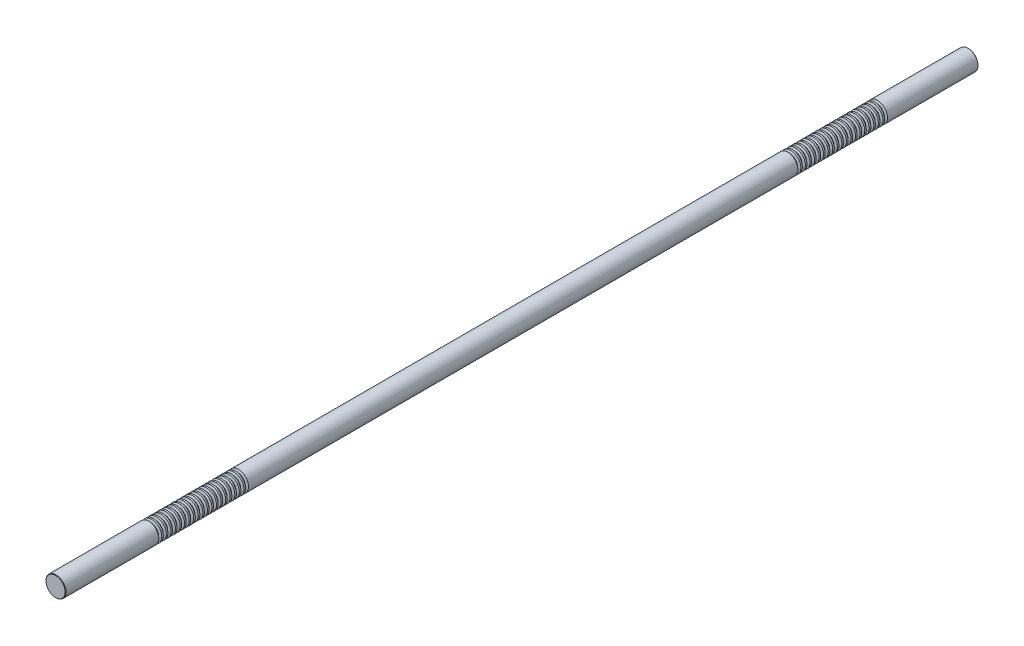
ISO-10303-21;
HEADER;
FILE_DESCRIPTION(('STEP AP214'),'2;1');
FILE_NAME('part.step','',(''),(''),'','','');
FILE_SCHEMA(('AUTOMOTIVE_DESIGN { 1 0 10303 214 1 1 1 1 }'));
ENDSEC;
DATA;
#1=APPLICATION_CONTEXT('core data for automotive mechanical design processes');
#2=APPLICATION_PROTOCOL_DEFINITION('international standard','automotive_design',2000,#1);
#3=PRODUCT_CONTEXT('',#1,'mechanical');
#4=PRODUCT('Part','Part','',(#3));
#5=PRODUCT_RELATED_PRODUCT_CATEGORY('part','',(#4));
#6=PRODUCT_DEFINITION_FORMATION('','',#4);
#7=PRODUCT_DEFINITION_CONTEXT('part definition',#1,'design');
#8=PRODUCT_DEFINITION('design','',#6,#7);
#9=PRODUCT_DEFINITION_SHAPE('','',#8);
#10=(LENGTH_UNIT() NAMED_UNIT(*) SI_UNIT(.MILLI.,.METRE.));
#11=(NAMED_UNIT(*) PLANE_ANGLE_UNIT() SI_UNIT($,.RADIAN.));
#12=(NAMED_UNIT(*) SI_UNIT($,.STERADIAN.) SOLID_ANGLE_UNIT());
#13=UNCERTAINTY_MEASURE_WITH_UNIT(LENGTH_MEASURE(1.E-05),#10,'distance_accuracy_value','');
#14=(GEOMETRIC_REPRESENTATION_CONTEXT(3) GLOBAL_UNCERTAINTY_ASSIGNED_CONTEXT((#13)) GLOBAL_UNIT_ASSIGNED_CONTEXT((#10,
#11,#12)) REPRESENTATION_CONTEXT('',''));
#15=CARTESIAN_POINT('',(0.,0.,0.));
#16=DIRECTION('',(0.,0.,1.));
#17=DIRECTION('',(1.,0.,0.));
#18=AXIS2_PLACEMENT_3D('',#15,#16,#17);
#19=CARTESIAN_POINT('',(0.,0.,500.));
#20=DIRECTION('',(0.,0.,-1.));
#21=DIRECTION('',(-1.,0.,0.));
#22=AXIS2_PLACEMENT_3D('',#19,#20,#21);
#23=CYLINDRICAL_SURFACE('',#22,11.);
#24=CARTESIAN_POINT('',(0.,0.,392.868430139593));
#25=DIRECTION('',(0.,0.,1.));
#26=DIRECTION('',(1.,0.,0.));
#27=AXIS2_PLACEMENT_3D('',#24,#25,#26);
#28=CIRCLE('',#27,11.);
#29=CARTESIAN_POINT('',(11.,0.,392.868430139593));
#30=VERTEX_POINT('',#29);
#31=EDGE_CURVE('E673',#30,#30,#28,.T.);
#32=ORIENTED_EDGE('',*,*,#31,.T.);
#33=EDGE_LOOP('',(#32));
#34=FACE_BOUND('',#33,.T.);
#35=CARTESIAN_POINT('',(0.,0.,394.631569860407));
#36=DIRECTION('',(0.,0.,1.));
#37=DIRECTION('',(1.,0.,0.));
#38=AXIS2_PLACEMENT_3D('',#35,#36,#37);
#39=CIRCLE('',#38,11.);
#40=CARTESIAN_POINT('',(11.,0.,394.631569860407));
#41=VERTEX_POINT('',#40);
#42=EDGE_CURVE('E685',#41,#41,#39,.T.);
#43=ORIENTED_EDGE('',*,*,#42,.F.);
#44=EDGE_LOOP('',(#43));
#45=FACE_BOUND('',#44,.T.);
#46=ADVANCED_FACE('F37',(#34,#45),#23,.T.);
#47=CARTESIAN_POINT('',(0.,0.,387.868430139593));
#48=DIRECTION('',(0.,0.,1.));
#49=DIRECTION('',(1.,0.,0.));
#50=AXIS2_PLACEMENT_3D('',#47,#48,#49);
#51=CIRCLE('',#50,11.);
#52=CARTESIAN_POINT('',(11.,0.,387.868430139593));
#53=VERTEX_POINT('',#52);
#54=EDGE_CURVE('E657',#53,#53,#51,.T.);
#55=ORIENTED_EDGE('',*,*,#54,.T.);
#56=EDGE_LOOP('',(#55));
#57=FACE_BOUND('',#56,.T.);
#58=CARTESIAN_POINT('',(0.,0.,389.631569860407));
#59=DIRECTION('',(0.,0.,1.));
#60=DIRECTION('',(1.,0.,0.));
#61=AXIS2_PLACEMENT_3D('',#58,#59,#60);
#62=CIRCLE('',#61,11.);
#63=CARTESIAN_POINT('',(11.,0.,389.631569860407));
#64=VERTEX_POINT('',#63);
#65=EDGE_CURVE('E669',#64,#64,#62,.T.);
#66=ORIENTED_EDGE('',*,*,#65,.F.);
#67=EDGE_LOOP('',(#66));
#68=FACE_BOUND('',#67,.T.);
#69=ADVANCED_FACE('F721',(#57,#68),#23,.T.);
#70=CARTESIAN_POINT('',(0.,0.,382.868430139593));
#71=DIRECTION('',(0.,0.,1.));
#72=DIRECTION('',(1.,0.,0.));
#73=AXIS2_PLACEMENT_3D('',#70,#71,#72);
#74=CIRCLE('',#73,11.);
#75=CARTESIAN_POINT('',(11.,0.,382.868430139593));
#76=VERTEX_POINT('',#75);
#77=EDGE_CURVE('E641',#76,#76,#74,.T.);
#78=ORIENTED_EDGE('',*,*,#77,.T.);
#79=EDGE_LOOP('',(#78));
#80=FACE_BOUND('',#79,.T.);
#81=CARTESIAN_POINT('',(0.,0.,384.631569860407));
#82=DIRECTION('',(0.,0.,1.));
#83=DIRECTION('',(1.,0.,0.));
#84=AXIS2_PLACEMENT_3D('',#81,#82,#83);
#85=CIRCLE('',#84,11.);
#86=CARTESIAN_POINT('',(11.,0.,384.631569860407));
#87=VERTEX_POINT('',#86);
#88=EDGE_CURVE('E653',#87,#87,#85,.T.);
#89=ORIENTED_EDGE('',*,*,#88,.F.);
#90=EDGE_LOOP('',(#89));
#91=FACE_BOUND('',#90,.T.);
#92=ADVANCED_FACE('F729',(#80,#91),#23,.T.);
#93=CARTESIAN_POINT('',(0.,0.,377.868430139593));
#94=DIRECTION('',(0.,0.,1.));
#95=DIRECTION('',(1.,0.,0.));
#96=AXIS2_PLACEMENT_3D('',#93,#94,#95);
#97=CIRCLE('',#96,11.);
#98=CARTESIAN_POINT('',(11.,0.,377.868430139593));
#99=VERTEX_POINT('',#98);
#100=EDGE_CURVE('E625',#99,#99,#97,.T.);
#101=ORIENTED_EDGE('',*,*,#100,.T.);
#102=EDGE_LOOP('',(#101));
#103=FACE_BOUND('',#102,.T.);
#104=CARTESIAN_POINT('',(0.,0.,379.631569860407));
#105=DIRECTION('',(0.,0.,1.));
#106=DIRECTION('',(1.,0.,0.));
#107=AXIS2_PLACEMENT_3D('',#104,#105,#106);
#108=CIRCLE('',#107,11.);
#109=CARTESIAN_POINT('',(11.,0.,379.631569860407));
#110=VERTEX_POINT('',#109);
#111=EDGE_CURVE('E637',#110,#110,#108,.T.);
#112=ORIENTED_EDGE('',*,*,#111,.F.);
#113=EDGE_LOOP('',(#112));
#114=FACE_BOUND('',#113,.T.);
#115=ADVANCED_FACE('F1550',(#103,#114),#23,.T.);
#116=CARTESIAN_POINT('',(0.,0.,372.868430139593));
#117=DIRECTION('',(0.,0.,1.));
#118=DIRECTION('',(1.,0.,0.));
#119=AXIS2_PLACEMENT_3D('',#116,#117,#118);
#120=CIRCLE('',#119,11.);
#121=CARTESIAN_POINT('',(11.,0.,372.868430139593));
#122=VERTEX_POINT('',#121);
#123=EDGE_CURVE('E610',#122,#122,#120,.T.);
#124=ORIENTED_EDGE('',*,*,#123,.T.);
#125=EDGE_LOOP('',(#124));
#126=FACE_BOUND('',#125,.T.);
#127=CARTESIAN_POINT('',(0.,0.,374.631569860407));
#128=DIRECTION('',(0.,0.,1.));
#129=DIRECTION('',(1.,0.,0.));
#130=AXIS2_PLACEMENT_3D('',#127,#128,#129);
#131=CIRCLE('',#130,11.);
#132=CARTESIAN_POINT('',(11.,0.,374.631569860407));
#133=VERTEX_POINT('',#132);
#134=EDGE_CURVE('E621',#133,#133,#131,.T.);
#135=ORIENTED_EDGE('',*,*,#134,.F.);
#136=EDGE_LOOP('',(#135));
#137=FACE_BOUND('',#136,.T.);
#138=ADVANCED_FACE('F1527',(#126,#137),#23,.T.);
#139=CARTESIAN_POINT('',(0.,0.,367.868430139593));
#140=DIRECTION('',(0.,0.,1.));
#141=DIRECTION('',(1.,0.,0.));
#142=AXIS2_PLACEMENT_3D('',#139,#140,#141);
#143=CIRCLE('',#142,11.);
#144=CARTESIAN_POINT('',(11.,0.,367.868430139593));
#145=VERTEX_POINT('',#144);
#146=EDGE_CURVE('E594',#145,#145,#143,.T.);
#147=ORIENTED_EDGE('',*,*,#146,.T.);
#148=EDGE_LOOP('',(#147));
#149=FACE_BOUND('',#148,.T.);
#150=CARTESIAN_POINT('',(0.,0.,369.631569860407));
#151=DIRECTION('',(0.,0.,1.));
#152=DIRECTION('',(1.,0.,0.));
#153=AXIS2_PLACEMENT_3D('',#150,#151,#152);
#154=CIRCLE('',#153,11.);
#155=CARTESIAN_POINT('',(11.,0.,369.631569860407));
#156=VERTEX_POINT('',#155);
#157=EDGE_CURVE('E606',#156,#156,#154,.T.);
#158=ORIENTED_EDGE('',*,*,#157,.F.);
#159=EDGE_LOOP('',(#158));
#160=FACE_BOUND('',#159,.T.);
#161=ADVANCED_FACE('F1504',(#149,#160),#23,.T.);
#162=CARTESIAN_POINT('',(0.,0.,362.868430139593));
#163=DIRECTION('',(0.,0.,1.));
#164=DIRECTION('',(1.,0.,0.));
#165=AXIS2_PLACEMENT_3D('',#162,#163,#164);
#166=CIRCLE('',#165,11.);
#167=CARTESIAN_POINT('',(11.,0.,362.868430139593));
#168=VERTEX_POINT('',#167);
#169=EDGE_CURVE('E578',#168,#168,#166,.T.);
#170=ORIENTED_EDGE('',*,*,#169,.T.);
#171=EDGE_LOOP('',(#170));
#172=FACE_BOUND('',#171,.T.);
#173=CARTESIAN_POINT('',(0.,0.,364.631569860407));
#174=DIRECTION('',(0.,0.,1.));
#175=DIRECTION('',(1.,0.,0.));
#176=AXIS2_PLACEMENT_3D('',#173,#174,#175);
#177=CIRCLE('',#176,11.);
#178=CARTESIAN_POINT('',(11.,0.,364.631569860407));
#179=VERTEX_POINT('',#178);
#180=EDGE_CURVE('E590',#179,#179,#177,.T.);
#181=ORIENTED_EDGE('',*,*,#180,.F.);
#182=EDGE_LOOP('',(#181));
#183=FACE_BOUND('',#182,.T.);
#184=ADVANCED_FACE('F1481',(#172,#183),#23,.T.);
#185=CARTESIAN_POINT('',(0.,0.,357.868430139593));
#186=DIRECTION('',(0.,0.,1.));
#187=DIRECTION('',(1.,0.,0.));
#188=AXIS2_PLACEMENT_3D('',#185,#186,#187);
#189=CIRCLE('',#188,11.);
#190=CARTESIAN_POINT('',(11.,0.,357.868430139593));
#191=VERTEX_POINT('',#190);
#192=EDGE_CURVE('E562',#191,#191,#189,.T.);
#193=ORIENTED_EDGE('',*,*,#192,.T.);
#194=EDGE_LOOP('',(#193));
#195=FACE_BOUND('',#194,.T.);
#196=CARTESIAN_POINT('',(0.,0.,359.631569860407));
#197=DIRECTION('',(0.,0.,1.));
#198=DIRECTION('',(1.,0.,0.));
#199=AXIS2_PLACEMENT_3D('',#196,#197,#198);
#200=CIRCLE('',#199,11.);
#201=CARTESIAN_POINT('',(11.,0.,359.631569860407));
#202=VERTEX_POINT('',#201);
#203=EDGE_CURVE('E574',#202,#202,#200,.T.);
#204=ORIENTED_EDGE('',*,*,#203,.F.);
#205=EDGE_LOOP('',(#204));
#206=FACE_BOUND('',#205,.T.);
#207=ADVANCED_FACE('F1458',(#195,#206),#23,.T.);
#208=CARTESIAN_POINT('',(0.,0.,352.868430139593));
#209=DIRECTION('',(0.,0.,1.));
#210=DIRECTION('',(1.,0.,0.));
#211=AXIS2_PLACEMENT_3D('',#208,#209,#210);
#212=CIRCLE('',#211,11.);
#213=CARTESIAN_POINT('',(11.,0.,352.868430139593));
#214=VERTEX_POINT('',#213);
#215=EDGE_CURVE('E546',#214,#214,#212,.T.);
#216=ORIENTED_EDGE('',*,*,#215,.T.);
#217=EDGE_LOOP('',(#216));
#218=FACE_BOUND('',#217,.T.);
#219=CARTESIAN_POINT('',(0.,0.,354.631569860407));
#220=DIRECTION('',(0.,0.,1.));
#221=DIRECTION('',(1.,0.,0.));
#222=AXIS2_PLACEMENT_3D('',#219,#220,#221);
#223=CIRCLE('',#222,11.);
#224=CARTESIAN_POINT('',(11.,0.,354.631569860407));
#225=VERTEX_POINT('',#224);
#226=EDGE_CURVE('E558',#225,#225,#223,.T.);
#227=ORIENTED_EDGE('',*,*,#226,.F.);
#228=EDGE_LOOP('',(#227));
#229=FACE_BOUND('',#228,.T.);
#230=ADVANCED_FACE('F1435',(#218,#229),#23,.T.);
#231=CARTESIAN_POINT('',(0.,0.,347.868430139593));
#232=DIRECTION('',(0.,0.,1.));
#233=DIRECTION('',(1.,0.,0.));
#234=AXIS2_PLACEMENT_3D('',#231,#232,#233);
#235=CIRCLE('',#234,11.);
#236=CARTESIAN_POINT('',(11.,0.,347.868430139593));
#237=VERTEX_POINT('',#236);
#238=EDGE_CURVE('E530',#237,#237,#235,.T.);
#239=ORIENTED_EDGE('',*,*,#238,.T.);
#240=EDGE_LOOP('',(#239));
#241=FACE_BOUND('',#240,.T.);
#242=CARTESIAN_POINT('',(0.,0.,349.631569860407));
#243=DIRECTION('',(0.,0.,1.));
#244=DIRECTION('',(1.,0.,0.));
#245=AXIS2_PLACEMENT_3D('',#242,#243,#244);
#246=CIRCLE('',#245,11.);
#247=CARTESIAN_POINT('',(11.,0.,349.631569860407));
#248=VERTEX_POINT('',#247);
#249=EDGE_CURVE('E542',#248,#248,#246,.T.);
#250=ORIENTED_EDGE('',*,*,#249,.F.);
#251=EDGE_LOOP('',(#250));
#252=FACE_BOUND('',#251,.T.);
#253=ADVANCED_FACE('F1412',(#241,#252),#23,.T.);
#254=CARTESIAN_POINT('',(0.,0.,342.868430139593));
#255=DIRECTION('',(0.,0.,1.));
#256=DIRECTION('',(1.,0.,0.));
#257=AXIS2_PLACEMENT_3D('',#254,#255,#256);
#258=CIRCLE('',#257,11.);
#259=CARTESIAN_POINT('',(11.,0.,342.868430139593));
#260=VERTEX_POINT('',#259);
#261=EDGE_CURVE('E514',#260,#260,#258,.T.);
#262=ORIENTED_EDGE('',*,*,#261,.T.);
#263=EDGE_LOOP('',(#262));
#264=FACE_BOUND('',#263,.T.);
#265=CARTESIAN_POINT('',(0.,0.,344.631569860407));
#266=DIRECTION('',(0.,0.,1.));
#267=DIRECTION('',(1.,0.,0.));
#268=AXIS2_PLACEMENT_3D('',#265,#266,#267);
#269=CIRCLE('',#268,11.);
#270=CARTESIAN_POINT('',(11.,0.,344.631569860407));
#271=VERTEX_POINT('',#270);
#272=EDGE_CURVE('E526',#271,#271,#269,.T.);
#273=ORIENTED_EDGE('',*,*,#272,.F.);
#274=EDGE_LOOP('',(#273));
#275=FACE_BOUND('',#274,.T.);
#276=ADVANCED_FACE('F1389',(#264,#275),#23,.T.);
#277=CARTESIAN_POINT('',(0.,0.,337.868430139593));
#278=DIRECTION('',(0.,0.,1.));
#279=DIRECTION('',(1.,0.,0.));
#280=AXIS2_PLACEMENT_3D('',#277,#278,#279);
#281=CIRCLE('',#280,11.);
#282=CARTESIAN_POINT('',(11.,0.,337.868430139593));
#283=VERTEX_POINT('',#282);
#284=EDGE_CURVE('E498',#283,#283,#281,.T.);
#285=ORIENTED_EDGE('',*,*,#284,.T.);
#286=EDGE_LOOP('',(#285));
#287=FACE_BOUND('',#286,.T.);
#288=CARTESIAN_POINT('',(0.,0.,339.631569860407));
#289=DIRECTION('',(0.,0.,1.));
#290=DIRECTION('',(1.,0.,0.));
#291=AXIS2_PLACEMENT_3D('',#288,#289,#290);
#292=CIRCLE('',#291,11.);
#293=CARTESIAN_POINT('',(11.,0.,339.631569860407));
#294=VERTEX_POINT('',#293);
#295=EDGE_CURVE('E510',#294,#294,#292,.T.);
#296=ORIENTED_EDGE('',*,*,#295,.F.);
#297=EDGE_LOOP('',(#296));
#298=FACE_BOUND('',#297,.T.);
#299=ADVANCED_FACE('F1366',(#287,#298),#23,.T.);
#300=CARTESIAN_POINT('',(0.,0.,332.868430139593));
#301=DIRECTION('',(0.,0.,1.));
#302=DIRECTION('',(1.,0.,0.));
#303=AXIS2_PLACEMENT_3D('',#300,#301,#302);
#304=CIRCLE('',#303,11.);
#305=CARTESIAN_POINT('',(11.,0.,332.868430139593));
#306=VERTEX_POINT('',#305);
#307=EDGE_CURVE('E482',#306,#306,#304,.T.);
#308=ORIENTED_EDGE('',*,*,#307,.T.);
#309=EDGE_LOOP('',(#308));
#310=FACE_BOUND('',#309,.T.);
#311=CARTESIAN_POINT('',(0.,0.,334.631569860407));
#312=DIRECTION('',(0.,0.,1.));
#313=DIRECTION('',(1.,0.,0.));
#314=AXIS2_PLACEMENT_3D('',#311,#312,#313);
#315=CIRCLE('',#314,11.);
#316=CARTESIAN_POINT('',(11.,0.,334.631569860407));
#317=VERTEX_POINT('',#316);
#318=EDGE_CURVE('E494',#317,#317,#315,.T.);
#319=ORIENTED_EDGE('',*,*,#318,.F.);
#320=EDGE_LOOP('',(#319));
#321=FACE_BOUND('',#320,.T.);
#322=ADVANCED_FACE('F1343',(#310,#321),#23,.T.);
#323=CARTESIAN_POINT('',(0.,0.,327.868430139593));
#324=DIRECTION('',(0.,0.,1.));
#325=DIRECTION('',(1.,0.,0.));
#326=AXIS2_PLACEMENT_3D('',#323,#324,#325);
#327=CIRCLE('',#326,11.);
#328=CARTESIAN_POINT('',(11.,0.,327.868430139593));
#329=VERTEX_POINT('',#328);
#330=EDGE_CURVE('E466',#329,#329,#327,.T.);
#331=ORIENTED_EDGE('',*,*,#330,.T.);
#332=EDGE_LOOP('',(#331));
#333=FACE_BOUND('',#332,.T.);
#334=CARTESIAN_POINT('',(0.,0.,329.631569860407));
#335=DIRECTION('',(0.,0.,1.));
#336=DIRECTION('',(1.,0.,0.));
#337=AXIS2_PLACEMENT_3D('',#334,#335,#336);
#338=CIRCLE('',#337,11.);
#339=CARTESIAN_POINT('',(11.,0.,329.631569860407));
#340=VERTEX_POINT('',#339);
#341=EDGE_CURVE('E478',#340,#340,#338,.T.);
#342=ORIENTED_EDGE('',*,*,#341,.F.);
#343=EDGE_LOOP('',(#342));
#344=FACE_BOUND('',#343,.T.);
#345=ADVANCED_FACE('F1320',(#333,#344),#23,.T.);
#346=CARTESIAN_POINT('',(0.,0.,322.868430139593));
#347=DIRECTION('',(0.,0.,1.));
#348=DIRECTION('',(1.,0.,0.));
#349=AXIS2_PLACEMENT_3D('',#346,#347,#348);
#350=CIRCLE('',#349,11.);
#351=CARTESIAN_POINT('',(11.,0.,322.868430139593));
#352=VERTEX_POINT('',#351);
#353=EDGE_CURVE('E450',#352,#352,#350,.T.);
#354=ORIENTED_EDGE('',*,*,#353,.T.);
#355=EDGE_LOOP('',(#354));
#356=FACE_BOUND('',#355,.T.);
#357=CARTESIAN_POINT('',(0.,0.,324.631569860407));
#358=DIRECTION('',(0.,0.,1.));
#359=DIRECTION('',(1.,0.,0.));
#360=AXIS2_PLACEMENT_3D('',#357,#358,#359);
#361=CIRCLE('',#360,11.);
#362=CARTESIAN_POINT('',(11.,0.,324.631569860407));
#363=VERTEX_POINT('',#362);
#364=EDGE_CURVE('E462',#363,#363,#361,.T.);
#365=ORIENTED_EDGE('',*,*,#364,.F.);
#366=EDGE_LOOP('',(#365));
#367=FACE_BOUND('',#366,.T.);
#368=ADVANCED_FACE('F1297',(#356,#367),#23,.T.);
#369=CARTESIAN_POINT('',(0.,0.,317.868430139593));
#370=DIRECTION('',(0.,0.,1.));
#371=DIRECTION('',(1.,0.,0.));
#372=AXIS2_PLACEMENT_3D('',#369,#370,#371);
#373=CIRCLE('',#372,11.);
#374=CARTESIAN_POINT('',(11.,0.,317.868430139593));
#375=VERTEX_POINT('',#374);
#376=EDGE_CURVE('E434',#375,#375,#373,.T.);
#377=ORIENTED_EDGE('',*,*,#376,.T.);
#378=EDGE_LOOP('',(#377));
#379=FACE_BOUND('',#378,.T.);
#380=CARTESIAN_POINT('',(0.,0.,319.631569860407));
#381=DIRECTION('',(0.,0.,1.));
#382=DIRECTION('',(1.,0.,0.));
#383=AXIS2_PLACEMENT_3D('',#380,#381,#382);
#384=CIRCLE('',#383,11.);
#385=CARTESIAN_POINT('',(11.,0.,319.631569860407));
#386=VERTEX_POINT('',#385);
#387=EDGE_CURVE('E446',#386,#386,#384,.T.);
#388=ORIENTED_EDGE('',*,*,#387,.F.);
#389=EDGE_LOOP('',(#388));
#390=FACE_BOUND('',#389,.T.);
#391=ADVANCED_FACE('F1274',(#379,#390),#23,.T.);
#392=CARTESIAN_POINT('',(0.,0.,312.868430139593));
#393=DIRECTION('',(0.,0.,1.));
#394=DIRECTION('',(1.,0.,0.));
#395=AXIS2_PLACEMENT_3D('',#392,#393,#394);
#396=CIRCLE('',#395,11.);
#397=CARTESIAN_POINT('',(11.,0.,312.868430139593));
#398=VERTEX_POINT('',#397);
#399=EDGE_CURVE('E418',#398,#398,#396,.T.);
#400=ORIENTED_EDGE('',*,*,#399,.T.);
#401=EDGE_LOOP('',(#400));
#402=FACE_BOUND('',#401,.T.);
#403=CARTESIAN_POINT('',(0.,0.,314.631569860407));
#404=DIRECTION('',(0.,0.,1.));
#405=DIRECTION('',(1.,0.,0.));
#406=AXIS2_PLACEMENT_3D('',#403,#404,#405);
#407=CIRCLE('',#406,11.);
#408=CARTESIAN_POINT('',(11.,0.,314.631569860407));
#409=VERTEX_POINT('',#408);
#410=EDGE_CURVE('E430',#409,#409,#407,.T.);
#411=ORIENTED_EDGE('',*,*,#410,.F.);
#412=EDGE_LOOP('',(#411));
#413=FACE_BOUND('',#412,.T.);
#414=ADVANCED_FACE('F1251',(#402,#413),#23,.T.);
#415=CARTESIAN_POINT('',(0.,0.,307.868430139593));
#416=DIRECTION('',(0.,0.,1.));
#417=DIRECTION('',(1.,0.,0.));
#418=AXIS2_PLACEMENT_3D('',#415,#416,#417);
#419=CIRCLE('',#418,11.);
#420=CARTESIAN_POINT('',(11.,0.,307.868430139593));
#421=VERTEX_POINT('',#420);
#422=EDGE_CURVE('E402',#421,#421,#419,.T.);
#423=ORIENTED_EDGE('',*,*,#422,.T.);
#424=EDGE_LOOP('',(#423));
#425=FACE_BOUND('',#424,.T.);
#426=CARTESIAN_POINT('',(0.,0.,309.631569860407));
#427=DIRECTION('',(0.,0.,1.));
#428=DIRECTION('',(1.,0.,0.));
#429=AXIS2_PLACEMENT_3D('',#426,#427,#428);
#430=CIRCLE('',#429,11.);
#431=CARTESIAN_POINT('',(11.,0.,309.631569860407));
#432=VERTEX_POINT('',#431);
#433=EDGE_CURVE('E414',#432,#432,#430,.T.);
#434=ORIENTED_EDGE('',*,*,#433,.F.);
#435=EDGE_LOOP('',(#434));
#436=FACE_BOUND('',#435,.T.);
#437=ADVANCED_FACE('F1228',(#425,#436),#23,.T.);
#438=CARTESIAN_POINT('',(0.,0.,302.868430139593));
#439=DIRECTION('',(0.,0.,1.));
#440=DIRECTION('',(1.,0.,0.));
#441=AXIS2_PLACEMENT_3D('',#438,#439,#440);
#442=CIRCLE('',#441,11.);
#443=CARTESIAN_POINT('',(11.,0.,302.868430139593));
#444=VERTEX_POINT('',#443);
#445=EDGE_CURVE('E386',#444,#444,#442,.T.);
#446=ORIENTED_EDGE('',*,*,#445,.T.);
#447=EDGE_LOOP('',(#446));
#448=FACE_BOUND('',#447,.T.);
#449=CARTESIAN_POINT('',(0.,0.,304.631569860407));
#450=DIRECTION('',(0.,0.,1.));
#451=DIRECTION('',(1.,0.,0.));
#452=AXIS2_PLACEMENT_3D('',#449,#450,#451);
#453=CIRCLE('',#452,11.);
#454=CARTESIAN_POINT('',(11.,0.,304.631569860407));
#455=VERTEX_POINT('',#454);
#456=EDGE_CURVE('E398',#455,#455,#453,.T.);
#457=ORIENTED_EDGE('',*,*,#456,.F.);
#458=EDGE_LOOP('',(#457));
#459=FACE_BOUND('',#458,.T.);
#460=ADVANCED_FACE('F1205',(#448,#459),#23,.T.);
#461=CARTESIAN_POINT('',(0.,0.,-302.131569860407));
#462=DIRECTION('',(0.,0.,1.));
#463=DIRECTION('',(1.,0.,0.));
#464=AXIS2_PLACEMENT_3D('',#461,#462,#463);
#465=CIRCLE('',#464,11.);
#466=CARTESIAN_POINT('',(11.,0.,-302.131569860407));
#467=VERTEX_POINT('',#466);
#468=EDGE_CURVE('E370',#467,#467,#465,.T.);
#469=ORIENTED_EDGE('',*,*,#468,.T.);
#470=EDGE_LOOP('',(#469));
#471=FACE_BOUND('',#470,.T.);
#472=CARTESIAN_POINT('',(0.,0.,299.631569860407));
#473=DIRECTION('',(0.,0.,1.));
#474=DIRECTION('',(1.,0.,0.));
#475=AXIS2_PLACEMENT_3D('',#472,#473,#474);
#476=CIRCLE('',#475,11.);
#477=CARTESIAN_POINT('',(11.,0.,299.631569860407));
#478=VERTEX_POINT('',#477);
#479=EDGE_CURVE('E382',#478,#478,#476,.T.);
#480=ORIENTED_EDGE('',*,*,#479,.F.);
#481=EDGE_LOOP('',(#480));
#482=FACE_BOUND('',#481,.T.);
#483=ADVANCED_FACE('F1182',(#471,#482),#23,.T.);
#484=CARTESIAN_POINT('',(0.,0.,-307.131569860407));
#485=DIRECTION('',(0.,0.,1.));
#486=DIRECTION('',(1.,0.,0.));
#487=AXIS2_PLACEMENT_3D('',#484,#485,#486);
#488=CIRCLE('',#487,11.);
#489=CARTESIAN_POINT('',(11.,0.,-307.131569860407));
#490=VERTEX_POINT('',#489);
#491=EDGE_CURVE('E354',#490,#490,#488,.T.);
#492=ORIENTED_EDGE('',*,*,#491,.T.);
#493=EDGE_LOOP('',(#492));
#494=FACE_BOUND('',#493,.T.);
#495=CARTESIAN_POINT('',(0.,0.,-305.368430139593));
#496=DIRECTION('',(0.,0.,1.));
#497=DIRECTION('',(1.,0.,0.));
#498=AXIS2_PLACEMENT_3D('',#495,#496,#497);
#499=CIRCLE('',#498,11.);
#500=CARTESIAN_POINT('',(11.,0.,-305.368430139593));
#501=VERTEX_POINT('',#500);
#502=EDGE_CURVE('E366',#501,#501,#499,.T.);
#503=ORIENTED_EDGE('',*,*,#502,.F.);
#504=EDGE_LOOP('',(#503));
#505=FACE_BOUND('',#504,.T.);
#506=ADVANCED_FACE('F1159',(#494,#505),#23,.T.);
#507=CARTESIAN_POINT('',(0.,0.,-312.131569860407));
#508=DIRECTION('',(0.,0.,1.));
#509=DIRECTION('',(1.,0.,0.));
#510=AXIS2_PLACEMENT_3D('',#507,#508,#509);
#511=CIRCLE('',#510,11.);
#512=CARTESIAN_POINT('',(11.,0.,-312.131569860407));
#513=VERTEX_POINT('',#512);
#514=EDGE_CURVE('E339',#513,#513,#511,.T.);
#515=ORIENTED_EDGE('',*,*,#514,.T.);
#516=EDGE_LOOP('',(#515));
#517=FACE_BOUND('',#516,.T.);
#518=CARTESIAN_POINT('',(0.,0.,-310.368430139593));
#519=DIRECTION('',(0.,0.,1.));
#520=DIRECTION('',(1.,0.,0.));
#521=AXIS2_PLACEMENT_3D('',#518,#519,#520);
#522=CIRCLE('',#521,11.);
#523=CARTESIAN_POINT('',(11.,0.,-310.368430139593));
#524=VERTEX_POINT('',#523);
#525=EDGE_CURVE('E351',#524,#524,#522,.T.);
#526=ORIENTED_EDGE('',*,*,#525,.F.);
#527=EDGE_LOOP('',(#526));
#528=FACE_BOUND('',#527,.T.);
#529=ADVANCED_FACE('F1136',(#517,#528),#23,.T.);
#530=CARTESIAN_POINT('',(0.,0.,-317.131569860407));
#531=DIRECTION('',(0.,0.,1.));
#532=DIRECTION('',(1.,0.,0.));
#533=AXIS2_PLACEMENT_3D('',#530,#531,#532);
#534=CIRCLE('',#533,11.);
#535=CARTESIAN_POINT('',(11.,0.,-317.131569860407));
#536=VERTEX_POINT('',#535);
#537=EDGE_CURVE('E323',#536,#536,#534,.T.);
#538=ORIENTED_EDGE('',*,*,#537,.T.);
#539=EDGE_LOOP('',(#538));
#540=FACE_BOUND('',#539,.T.);
#541=CARTESIAN_POINT('',(0.,0.,-315.368430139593));
#542=DIRECTION('',(0.,0.,1.));
#543=DIRECTION('',(1.,0.,0.));
#544=AXIS2_PLACEMENT_3D('',#541,#542,#543);
#545=CIRCLE('',#544,11.);
#546=CARTESIAN_POINT('',(11.,0.,-315.368430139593));
#547=VERTEX_POINT('',#546);
#548=EDGE_CURVE('E335',#547,#547,#545,.T.);
#549=ORIENTED_EDGE('',*,*,#548,.F.);
#550=EDGE_LOOP('',(#549));
#551=FACE_BOUND('',#550,.T.);
#552=ADVANCED_FACE('F1113',(#540,#551),#23,.T.);
#553=CARTESIAN_POINT('',(0.,0.,-322.131569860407));
#554=DIRECTION('',(0.,0.,1.));
#555=DIRECTION('',(1.,0.,0.));
#556=AXIS2_PLACEMENT_3D('',#553,#554,#555);
#557=CIRCLE('',#556,11.);
#558=CARTESIAN_POINT('',(11.,0.,-322.131569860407));
#559=VERTEX_POINT('',#558);
#560=EDGE_CURVE('E307',#559,#559,#557,.T.);
#561=ORIENTED_EDGE('',*,*,#560,.T.);
#562=EDGE_LOOP('',(#561));
#563=FACE_BOUND('',#562,.T.);
#564=CARTESIAN_POINT('',(0.,0.,-320.368430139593));
#565=DIRECTION('',(0.,0.,1.));
#566=DIRECTION('',(1.,0.,0.));
#567=AXIS2_PLACEMENT_3D('',#564,#565,#566);
#568=CIRCLE('',#567,11.);
#569=CARTESIAN_POINT('',(11.,0.,-320.368430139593));
#570=VERTEX_POINT('',#569);
#571=EDGE_CURVE('E319',#570,#570,#568,.T.);
#572=ORIENTED_EDGE('',*,*,#571,.F.);
#573=EDGE_LOOP('',(#572));
#574=FACE_BOUND('',#573,.T.);
#575=ADVANCED_FACE('F1090',(#563,#574),#23,.T.);
#576=CARTESIAN_POINT('',(0.,0.,-327.131569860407));
#577=DIRECTION('',(0.,0.,1.));
#578=DIRECTION('',(1.,0.,0.));
#579=AXIS2_PLACEMENT_3D('',#576,#577,#578);
#580=CIRCLE('',#579,11.);
#581=CARTESIAN_POINT('',(11.,0.,-327.131569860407));
#582=VERTEX_POINT('',#581);
#583=EDGE_CURVE('E291',#582,#582,#580,.T.);
#584=ORIENTED_EDGE('',*,*,#583,.T.);
#585=EDGE_LOOP('',(#584));
#586=FACE_BOUND('',#585,.T.);
#587=CARTESIAN_POINT('',(0.,0.,-325.368430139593));
#588=DIRECTION('',(0.,0.,1.));
#589=DIRECTION('',(1.,0.,0.));
#590=AXIS2_PLACEMENT_3D('',#587,#588,#589);
#591=CIRCLE('',#590,11.);
#592=CARTESIAN_POINT('',(11.,0.,-325.368430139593));
#593=VERTEX_POINT('',#592);
#594=EDGE_CURVE('E303',#593,#593,#591,.T.);
#595=ORIENTED_EDGE('',*,*,#594,.F.);
#596=EDGE_LOOP('',(#595));
#597=FACE_BOUND('',#596,.T.);
#598=ADVANCED_FACE('F1067',(#586,#597),#23,.T.);
#599=CARTESIAN_POINT('',(0.,0.,-332.131569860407));
#600=DIRECTION('',(0.,0.,1.));
#601=DIRECTION('',(1.,0.,0.));
#602=AXIS2_PLACEMENT_3D('',#599,#600,#601);
#603=CIRCLE('',#602,11.);
#604=CARTESIAN_POINT('',(11.,0.,-332.131569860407));
#605=VERTEX_POINT('',#604);
#606=EDGE_CURVE('E275',#605,#605,#603,.T.);
#607=ORIENTED_EDGE('',*,*,#606,.T.);
#608=EDGE_LOOP('',(#607));
#609=FACE_BOUND('',#608,.T.);
#610=CARTESIAN_POINT('',(0.,0.,-330.368430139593));
#611=DIRECTION('',(0.,0.,1.));
#612=DIRECTION('',(1.,0.,0.));
#613=AXIS2_PLACEMENT_3D('',#610,#611,#612);
#614=CIRCLE('',#613,11.);
#615=CARTESIAN_POINT('',(11.,0.,-330.368430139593));
#616=VERTEX_POINT('',#615);
#617=EDGE_CURVE('E287',#616,#616,#614,.T.);
#618=ORIENTED_EDGE('',*,*,#617,.F.);
#619=EDGE_LOOP('',(#618));
#620=FACE_BOUND('',#619,.T.);
#621=ADVANCED_FACE('F1044',(#609,#620),#23,.T.);
#622=CARTESIAN_POINT('',(0.,0.,-337.131569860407));
#623=DIRECTION('',(0.,0.,1.));
#624=DIRECTION('',(1.,0.,0.));
#625=AXIS2_PLACEMENT_3D('',#622,#623,#624);
#626=CIRCLE('',#625,11.);
#627=CARTESIAN_POINT('',(11.,0.,-337.131569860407));
#628=VERTEX_POINT('',#627);
#629=EDGE_CURVE('E259',#628,#628,#626,.T.);
#630=ORIENTED_EDGE('',*,*,#629,.T.);
#631=EDGE_LOOP('',(#630));
#632=FACE_BOUND('',#631,.T.);
#633=CARTESIAN_POINT('',(0.,0.,-335.368430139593));
#634=DIRECTION('',(0.,0.,1.));
#635=DIRECTION('',(1.,0.,0.));
#636=AXIS2_PLACEMENT_3D('',#633,#634,#635);
#637=CIRCLE('',#636,11.);
#638=CARTESIAN_POINT('',(11.,0.,-335.368430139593));
#639=VERTEX_POINT('',#638);
#640=EDGE_CURVE('E271',#639,#639,#637,.T.);
#641=ORIENTED_EDGE('',*,*,#640,.F.);
#642=EDGE_LOOP('',(#641));
#643=FACE_BOUND('',#642,.T.);
#644=ADVANCED_FACE('F1021',(#632,#643),#23,.T.);
#645=CARTESIAN_POINT('',(0.,0.,-342.131569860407));
#646=DIRECTION('',(0.,0.,1.));
#647=DIRECTION('',(1.,0.,0.));
#648=AXIS2_PLACEMENT_3D('',#645,#646,#647);
#649=CIRCLE('',#648,11.);
#650=CARTESIAN_POINT('',(11.,0.,-342.131569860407));
#651=VERTEX_POINT('',#650);
#652=EDGE_CURVE('E243',#651,#651,#649,.T.);
#653=ORIENTED_EDGE('',*,*,#652,.T.);
#654=EDGE_LOOP('',(#653));
#655=FACE_BOUND('',#654,.T.);
#656=CARTESIAN_POINT('',(0.,0.,-340.368430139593));
#657=DIRECTION('',(0.,0.,1.));
#658=DIRECTION('',(1.,0.,0.));
#659=AXIS2_PLACEMENT_3D('',#656,#657,#658);
#660=CIRCLE('',#659,11.);
#661=CARTESIAN_POINT('',(11.,0.,-340.368430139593));
#662=VERTEX_POINT('',#661);
#663=EDGE_CURVE('E255',#662,#662,#660,.T.);
#664=ORIENTED_EDGE('',*,*,#663,.F.);
#665=EDGE_LOOP('',(#664));
#666=FACE_BOUND('',#665,.T.);
#667=ADVANCED_FACE('F998',(#655,#666),#23,.T.);
#668=CARTESIAN_POINT('',(0.,0.,-347.131569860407));
#669=DIRECTION('',(0.,0.,1.));
#670=DIRECTION('',(1.,0.,0.));
#671=AXIS2_PLACEMENT_3D('',#668,#669,#670);
#672=CIRCLE('',#671,11.);
#673=CARTESIAN_POINT('',(11.,0.,-347.131569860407));
#674=VERTEX_POINT('',#673);
#675=EDGE_CURVE('E227',#674,#674,#672,.T.);
#676=ORIENTED_EDGE('',*,*,#675,.T.);
#677=EDGE_LOOP('',(#676));
#678=FACE_BOUND('',#677,.T.);
#679=CARTESIAN_POINT('',(0.,0.,-345.368430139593));
#680=DIRECTION('',(0.,0.,1.));
#681=DIRECTION('',(1.,0.,0.));
#682=AXIS2_PLACEMENT_3D('',#679,#680,#681);
#683=CIRCLE('',#682,11.);
#684=CARTESIAN_POINT('',(11.,0.,-345.368430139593));
#685=VERTEX_POINT('',#684);
#686=EDGE_CURVE('E239',#685,#685,#683,.T.);
#687=ORIENTED_EDGE('',*,*,#686,.F.);
#688=EDGE_LOOP('',(#687));
#689=FACE_BOUND('',#688,.T.);
#690=ADVANCED_FACE('F975',(#678,#689),#23,.T.);
#691=CARTESIAN_POINT('',(0.,0.,-352.131569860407));
#692=DIRECTION('',(0.,0.,1.));
#693=DIRECTION('',(1.,0.,0.));
#694=AXIS2_PLACEMENT_3D('',#691,#692,#693);
#695=CIRCLE('',#694,11.);
#696=CARTESIAN_POINT('',(11.,0.,-352.131569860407));
#697=VERTEX_POINT('',#696);
#698=EDGE_CURVE('E211',#697,#697,#695,.T.);
#699=ORIENTED_EDGE('',*,*,#698,.T.);
#700=EDGE_LOOP('',(#699));
#701=FACE_BOUND('',#700,.T.);
#702=CARTESIAN_POINT('',(0.,0.,-350.368430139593));
#703=DIRECTION('',(0.,0.,1.));
#704=DIRECTION('',(1.,0.,0.));
#705=AXIS2_PLACEMENT_3D('',#702,#703,#704);
#706=CIRCLE('',#705,11.);
#707=CARTESIAN_POINT('',(11.,0.,-350.368430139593));
#708=VERTEX_POINT('',#707);
#709=EDGE_CURVE('E223',#708,#708,#706,.T.);
#710=ORIENTED_EDGE('',*,*,#709,.F.);
#711=EDGE_LOOP('',(#710));
#712=FACE_BOUND('',#711,.T.);
#713=ADVANCED_FACE('F952',(#701,#712),#23,.T.);
#714=CARTESIAN_POINT('',(0.,0.,-357.131569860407));
#715=DIRECTION('',(0.,0.,1.));
#716=DIRECTION('',(1.,0.,0.));
#717=AXIS2_PLACEMENT_3D('',#714,#715,#716);
#718=CIRCLE('',#717,11.);
#719=CARTESIAN_POINT('',(11.,0.,-357.131569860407));
#720=VERTEX_POINT('',#719);
#721=EDGE_CURVE('E195',#720,#720,#718,.T.);
#722=ORIENTED_EDGE('',*,*,#721,.T.);
#723=EDGE_LOOP('',(#722));
#724=FACE_BOUND('',#723,.T.);
#725=CARTESIAN_POINT('',(0.,0.,-355.368430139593));
#726=DIRECTION('',(0.,0.,1.));
#727=DIRECTION('',(1.,0.,0.));
#728=AXIS2_PLACEMENT_3D('',#725,#726,#727);
#729=CIRCLE('',#728,11.);
#730=CARTESIAN_POINT('',(11.,0.,-355.368430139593));
#731=VERTEX_POINT('',#730);
#732=EDGE_CURVE('E207',#731,#731,#729,.T.);
#733=ORIENTED_EDGE('',*,*,#732,.F.);
#734=EDGE_LOOP('',(#733));
#735=FACE_BOUND('',#734,.T.);
#736=ADVANCED_FACE('F929',(#724,#735),#23,.T.);
#737=CARTESIAN_POINT('',(0.,0.,-362.131569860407));
#738=DIRECTION('',(0.,0.,1.));
#739=DIRECTION('',(1.,0.,0.));
#740=AXIS2_PLACEMENT_3D('',#737,#738,#739);
#741=CIRCLE('',#740,11.);
#742=CARTESIAN_POINT('',(11.,0.,-362.131569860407));
#743=VERTEX_POINT('',#742);
#744=EDGE_CURVE('E179',#743,#743,#741,.T.);
#745=ORIENTED_EDGE('',*,*,#744,.T.);
#746=EDGE_LOOP('',(#745));
#747=FACE_BOUND('',#746,.T.);
#748=CARTESIAN_POINT('',(0.,0.,-360.368430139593));
#749=DIRECTION('',(0.,0.,1.));
#750=DIRECTION('',(1.,0.,0.));
#751=AXIS2_PLACEMENT_3D('',#748,#749,#750);
#752=CIRCLE('',#751,11.);
#753=CARTESIAN_POINT('',(11.,0.,-360.368430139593));
#754=VERTEX_POINT('',#753);
#755=EDGE_CURVE('E191',#754,#754,#752,.T.);
#756=ORIENTED_EDGE('',*,*,#755,.F.);
#757=EDGE_LOOP('',(#756));
#758=FACE_BOUND('',#757,.T.);
#759=ADVANCED_FACE('F906',(#747,#758),#23,.T.);
#760=CARTESIAN_POINT('',(0.,0.,-367.131569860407));
#761=DIRECTION('',(0.,0.,1.));
#762=DIRECTION('',(1.,0.,0.));
#763=AXIS2_PLACEMENT_3D('',#760,#761,#762);
#764=CIRCLE('',#763,11.);
#765=CARTESIAN_POINT('',(11.,0.,-367.131569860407));
#766=VERTEX_POINT('',#765);
#767=EDGE_CURVE('E163',#766,#766,#764,.T.);
#768=ORIENTED_EDGE('',*,*,#767,.T.);
#769=EDGE_LOOP('',(#768));
#770=FACE_BOUND('',#769,.T.);
#771=CARTESIAN_POINT('',(0.,0.,-365.368430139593));
#772=DIRECTION('',(0.,0.,1.));
#773=DIRECTION('',(1.,0.,0.));
#774=AXIS2_PLACEMENT_3D('',#771,#772,#773);
#775=CIRCLE('',#774,11.);
#776=CARTESIAN_POINT('',(11.,0.,-365.368430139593));
#777=VERTEX_POINT('',#776);
#778=EDGE_CURVE('E175',#777,#777,#775,.T.);
#779=ORIENTED_EDGE('',*,*,#778,.F.);
#780=EDGE_LOOP('',(#779));
#781=FACE_BOUND('',#780,.T.);
#782=ADVANCED_FACE('F883',(#770,#781),#23,.T.);
#783=CARTESIAN_POINT('',(0.,0.,-372.131569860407));
#784=DIRECTION('',(0.,0.,1.));
#785=DIRECTION('',(1.,0.,0.));
#786=AXIS2_PLACEMENT_3D('',#783,#784,#785);
#787=CIRCLE('',#786,11.);
#788=CARTESIAN_POINT('',(11.,0.,-372.131569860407));
#789=VERTEX_POINT('',#788);
#790=EDGE_CURVE('E147',#789,#789,#787,.T.);
#791=ORIENTED_EDGE('',*,*,#790,.T.);
#792=EDGE_LOOP('',(#791));
#793=FACE_BOUND('',#792,.T.);
#794=CARTESIAN_POINT('',(0.,0.,-370.368430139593));
#795=DIRECTION('',(0.,0.,1.));
#796=DIRECTION('',(1.,0.,0.));
#797=AXIS2_PLACEMENT_3D('',#794,#795,#796);
#798=CIRCLE('',#797,11.);
#799=CARTESIAN_POINT('',(11.,0.,-370.368430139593));
#800=VERTEX_POINT('',#799);
#801=EDGE_CURVE('E159',#800,#800,#798,.T.);
#802=ORIENTED_EDGE('',*,*,#801,.F.);
#803=EDGE_LOOP('',(#802));
#804=FACE_BOUND('',#803,.T.);
#805=ADVANCED_FACE('F860',(#793,#804),#23,.T.);
#806=CARTESIAN_POINT('',(0.,0.,-377.131569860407));
#807=DIRECTION('',(0.,0.,1.));
#808=DIRECTION('',(1.,0.,0.));
#809=AXIS2_PLACEMENT_3D('',#806,#807,#808);
#810=CIRCLE('',#809,11.);
#811=CARTESIAN_POINT('',(11.,0.,-377.131569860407));
#812=VERTEX_POINT('',#811);
#813=EDGE_CURVE('E131',#812,#812,#810,.T.);
#814=ORIENTED_EDGE('',*,*,#813,.T.);
#815=EDGE_LOOP('',(#814));
#816=FACE_BOUND('',#815,.T.);
#817=CARTESIAN_POINT('',(0.,0.,-375.368430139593));
#818=DIRECTION('',(0.,0.,1.));
#819=DIRECTION('',(1.,0.,0.));
#820=AXIS2_PLACEMENT_3D('',#817,#818,#819);
#821=CIRCLE('',#820,11.);
#822=CARTESIAN_POINT('',(11.,0.,-375.368430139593));
#823=VERTEX_POINT('',#822);
#824=EDGE_CURVE('E143',#823,#823,#821,.T.);
#825=ORIENTED_EDGE('',*,*,#824,.F.);
#826=EDGE_LOOP('',(#825));
#827=FACE_BOUND('',#826,.T.);
#828=ADVANCED_FACE('F837',(#816,#827),#23,.T.);
#829=CARTESIAN_POINT('',(0.,0.,-382.131569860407));
#830=DIRECTION('',(0.,0.,1.));
#831=DIRECTION('',(1.,0.,0.));
#832=AXIS2_PLACEMENT_3D('',#829,#830,#831);
#833=CIRCLE('',#832,11.);
#834=CARTESIAN_POINT('',(11.,0.,-382.131569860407));
#835=VERTEX_POINT('',#834);
#836=EDGE_CURVE('E116',#835,#835,#833,.T.);
#837=ORIENTED_EDGE('',*,*,#836,.T.);
#838=EDGE_LOOP('',(#837));
#839=FACE_BOUND('',#838,.T.);
#840=CARTESIAN_POINT('',(0.,0.,-380.368430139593));
#841=DIRECTION('',(0.,0.,1.));
#842=DIRECTION('',(1.,0.,0.));
#843=AXIS2_PLACEMENT_3D('',#840,#841,#842);
#844=CIRCLE('',#843,11.);
#845=CARTESIAN_POINT('',(11.,0.,-380.368430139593));
#846=VERTEX_POINT('',#845);
#847=EDGE_CURVE('E127',#846,#846,#844,.T.);
#848=ORIENTED_EDGE('',*,*,#847,.F.);
#849=EDGE_LOOP('',(#848));
#850=FACE_BOUND('',#849,.T.);
#851=ADVANCED_FACE('F814',(#839,#850),#23,.T.);
#852=CARTESIAN_POINT('',(0.,0.,-387.131569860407));
#853=DIRECTION('',(0.,0.,1.));
#854=DIRECTION('',(1.,0.,0.));
#855=AXIS2_PLACEMENT_3D('',#852,#853,#854);
#856=CIRCLE('',#855,11.);
#857=CARTESIAN_POINT('',(11.,0.,-387.131569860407));
#858=VERTEX_POINT('',#857);
#859=EDGE_CURVE('E100',#858,#858,#856,.T.);
#860=ORIENTED_EDGE('',*,*,#859,.T.);
#861=EDGE_LOOP('',(#860));
#862=FACE_BOUND('',#861,.T.);
#863=CARTESIAN_POINT('',(0.,0.,-385.368430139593));
#864=DIRECTION('',(0.,0.,1.));
#865=DIRECTION('',(1.,0.,0.));
#866=AXIS2_PLACEMENT_3D('',#863,#864,#865);
#867=CIRCLE('',#866,11.);
#868=CARTESIAN_POINT('',(11.,0.,-385.368430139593));
#869=VERTEX_POINT('',#868);
#870=EDGE_CURVE('E112',#869,#869,#867,.T.);
#871=ORIENTED_EDGE('',*,*,#870,.F.);
#872=EDGE_LOOP('',(#871));
#873=FACE_BOUND('',#872,.T.);
#874=ADVANCED_FACE('F791',(#862,#873),#23,.T.);
#875=CARTESIAN_POINT('',(0.,0.,-392.131569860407));
#876=DIRECTION('',(0.,0.,1.));
#877=DIRECTION('',(1.,0.,0.));
#878=AXIS2_PLACEMENT_3D('',#875,#876,#877);
#879=CIRCLE('',#878,11.);
#880=CARTESIAN_POINT('',(11.,0.,-392.131569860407));
#881=VERTEX_POINT('',#880);
#882=EDGE_CURVE('E84',#881,#881,#879,.T.);
#883=ORIENTED_EDGE('',*,*,#882,.T.);
#884=EDGE_LOOP('',(#883));
#885=FACE_BOUND('',#884,.T.);
#886=CARTESIAN_POINT('',(0.,0.,-390.368430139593));
#887=DIRECTION('',(0.,0.,1.));
#888=DIRECTION('',(1.,0.,0.));
#889=AXIS2_PLACEMENT_3D('',#886,#887,#888);
#890=CIRCLE('',#889,11.);
#891=CARTESIAN_POINT('',(11.,0.,-390.368430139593));
#892=VERTEX_POINT('',#891);
#893=EDGE_CURVE('E96',#892,#892,#890,.T.);
#894=ORIENTED_EDGE('',*,*,#893,.F.);
#895=EDGE_LOOP('',(#894));
#896=FACE_BOUND('',#895,.T.);
#897=ADVANCED_FACE('F744',(#885,#896),#23,.T.);
#898=CARTESIAN_POINT('',(0.,0.,-397.131569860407));
#899=DIRECTION('',(0.,0.,1.));
#900=DIRECTION('',(1.,0.,0.));
#901=AXIS2_PLACEMENT_3D('',#898,#899,#900);
#902=CIRCLE('',#901,11.);
#903=CARTESIAN_POINT('',(11.,0.,-397.131569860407));
#904=VERTEX_POINT('',#903);
#905=EDGE_CURVE('E69',#904,#904,#902,.T.);
#906=ORIENTED_EDGE('',*,*,#905,.T.);
#907=EDGE_LOOP('',(#906));
#908=FACE_BOUND('',#907,.T.);
#909=CARTESIAN_POINT('',(0.,0.,-395.368430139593));
#910=DIRECTION('',(0.,0.,1.));
#911=DIRECTION('',(1.,0.,0.));
#912=AXIS2_PLACEMENT_3D('',#909,#910,#911);
#913=CIRCLE('',#912,11.);
#914=CARTESIAN_POINT('',(11.,0.,-395.368430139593));
#915=VERTEX_POINT('',#914);
#916=EDGE_CURVE('E81',#915,#915,#913,.T.);
#917=ORIENTED_EDGE('',*,*,#916,.F.);
#918=EDGE_LOOP('',(#917));
#919=FACE_BOUND('',#918,.T.);
#920=ADVANCED_FACE('F737',(#908,#919),#23,.T.);
#921=CARTESIAN_POINT('',(0.,0.,-499.45));
#922=DIRECTION('',(0.,0.,1.));
#923=DIRECTION('',(1.,0.,0.));
#924=AXIS2_PLACEMENT_3D('',#921,#922,#923);
#925=CIRCLE('',#924,11.);
#926=CARTESIAN_POINT('',(11.,0.,-499.45));
#927=VERTEX_POINT('',#926);
#928=EDGE_CURVE('E52',#927,#927,#925,.T.);
#929=ORIENTED_EDGE('',*,*,#928,.T.);
#930=EDGE_LOOP('',(#929));
#931=FACE_BOUND('',#930,.T.);
#932=CARTESIAN_POINT('',(0.,0.,-400.368430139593));
#933=DIRECTION('',(0.,0.,1.));
#934=DIRECTION('',(1.,0.,0.));
#935=AXIS2_PLACEMENT_3D('',#932,#933,#934);
#936=CIRCLE('',#935,11.);
#937=CARTESIAN_POINT('',(11.,0.,-400.368430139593));
#938=VERTEX_POINT('',#937);
#939=EDGE_CURVE('E65',#938,#938,#936,.T.);
#940=ORIENTED_EDGE('',*,*,#939,.F.);
#941=EDGE_LOOP('',(#940));
#942=FACE_BOUND('',#941,.T.);
#943=ADVANCED_FACE('F725',(#931,#942),#23,.T.);
#944=CARTESIAN_POINT('',(0.,0.,-500.));
#945=DIRECTION('',(0.,0.,1.));
#946=DIRECTION('',(1.,0.,0.));
#947=AXIS2_PLACEMENT_3D('',#944,#945,#946);
#948=PLANE('',#947);
#949=CARTESIAN_POINT('',(0.,0.,-500.));
#950=DIRECTION('',(0.,0.,1.));
#951=DIRECTION('',(1.,0.,0.));
#952=AXIS2_PLACEMENT_3D('',#949,#950,#951);
#953=CIRCLE('',#952,10.45);
#954=CARTESIAN_POINT('',(10.45,0.,-500.));
#955=VERTEX_POINT('',#954);
#956=EDGE_CURVE('E45',#955,#955,#953,.F.);
#957=ORIENTED_EDGE('',*,*,#956,.T.);
#958=EDGE_LOOP('',(#957));
#959=FACE_BOUND('',#958,.T.);
#960=ADVANCED_FACE('F736',(#959),#948,.F.);
#961=CARTESIAN_POINT('',(0.,0.,-499.45));
#962=DIRECTION('',(0.,0.,1.));
#963=DIRECTION('',(1.,0.,0.));
#964=AXIS2_PLACEMENT_3D('',#961,#962,#963);
#965=CONICAL_SURFACE('',#964,11.,0.785398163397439);
#966=ORIENTED_EDGE('',*,*,#956,.F.);
#967=EDGE_LOOP('',(#966));
#968=FACE_BOUND('',#967,.T.);
#969=ORIENTED_EDGE('',*,*,#928,.F.);
#970=EDGE_LOOP('',(#969));
#971=FACE_BOUND('',#970,.T.);
#972=ADVANCED_FACE('F743',(#968,#971),#965,.T.);
#973=CARTESIAN_POINT('',(0.,0.,-399.631569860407));
#974=DIRECTION('',(0.,0.,-1.));
#975=DIRECTION('',(-1.,0.,0.));
#976=AXIS2_PLACEMENT_3D('',#973,#974,#975);
#977=CONICAL_SURFACE('',#976,8.25,1.3089969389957);
#978=ORIENTED_EDGE('',*,*,#939,.T.);
#979=EDGE_LOOP('',(#978));
#980=FACE_BOUND('',#979,.T.);
#981=CARTESIAN_POINT('',(0.,0.,-399.631569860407));
#982=DIRECTION('',(0.,0.,1.));
#983=DIRECTION('',(1.,0.,0.));
#984=AXIS2_PLACEMENT_3D('',#981,#982,#983);
#985=CIRCLE('',#984,8.25);
#986=CARTESIAN_POINT('',(8.25,0.,-399.631569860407));
#987=VERTEX_POINT('',#986);
#988=EDGE_CURVE('E77',#987,#987,#985,.T.);
#989=ORIENTED_EDGE('',*,*,#988,.F.);
#990=EDGE_LOOP('',(#989));
#991=FACE_BOUND('',#990,.T.);
#992=ADVANCED_FACE('F750',(#980,#991),#977,.T.);
#993=CARTESIAN_POINT('',(0.,0.,-397.131569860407));
#994=DIRECTION('',(0.,0.,1.));
#995=DIRECTION('',(1.,0.,0.));
#996=AXIS2_PLACEMENT_3D('',#993,#994,#995);
#997=CONICAL_SURFACE('',#996,11.,1.3089969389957);
#998=CARTESIAN_POINT('',(0.,0.,-397.868430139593));
#999=DIRECTION('',(0.,0.,1.));
#1000=DIRECTION('',(1.,0.,0.));
#1001=AXIS2_PLACEMENT_3D('',#998,#999,#1000);
#1002=CIRCLE('',#1001,8.25);
#1003=CARTESIAN_POINT('',(8.25,0.,-397.868430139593));
#1004=VERTEX_POINT('',#1003);
#1005=EDGE_CURVE('E73',#1004,#1004,#1002,.T.);
#1006=ORIENTED_EDGE('',*,*,#1005,.T.);
#1007=EDGE_LOOP('',(#1006));
#1008=FACE_BOUND('',#1007,.T.);
#1009=ORIENTED_EDGE('',*,*,#905,.F.);
#1010=EDGE_LOOP('',(#1009));
#1011=FACE_BOUND('',#1010,.T.);
#1012=ADVANCED_FACE('F753',(#1008,#1011),#997,.T.);
#1013=CARTESIAN_POINT('',(0.,0.,499.45));
#1014=DIRECTION('',(0.,0.,1.));
#1015=DIRECTION('',(1.,0.,0.));
#1016=AXIS2_PLACEMENT_3D('',#1013,#1014,#1015);
#1017=CYLINDRICAL_SURFACE('',#1016,8.25);
#1018=ORIENTED_EDGE('',*,*,#988,.T.);
#1019=EDGE_LOOP('',(#1018));
#1020=FACE_BOUND('',#1019,.T.);
#1021=ORIENTED_EDGE('',*,*,#1005,.F.);
#1022=EDGE_LOOP('',(#1021));
#1023=FACE_BOUND('',#1022,.T.);
#1024=ADVANCED_FACE('F757',(#1020,#1023),#1017,.T.);
#1025=CARTESIAN_POINT('',(0.,0.,-394.631569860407));
#1026=DIRECTION('',(0.,0.,-1.));
#1027=DIRECTION('',(-1.,0.,0.));
#1028=AXIS2_PLACEMENT_3D('',#1025,#1026,#1027);
#1029=CONICAL_SURFACE('',#1028,8.25,1.3089969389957);
#1030=ORIENTED_EDGE('',*,*,#916,.T.);
#1031=EDGE_LOOP('',(#1030));
#1032=FACE_BOUND('',#1031,.T.);
#1033=CARTESIAN_POINT('',(0.,0.,-394.631569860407));
#1034=DIRECTION('',(0.,0.,1.));
#1035=DIRECTION('',(1.,0.,0.));
#1036=AXIS2_PLACEMENT_3D('',#1033,#1034,#1035);
#1037=CIRCLE('',#1036,8.25);
#1038=CARTESIAN_POINT('',(8.25,0.,-394.631569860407));
#1039=VERTEX_POINT('',#1038);
#1040=EDGE_CURVE('E92',#1039,#1039,#1037,.T.);
#1041=ORIENTED_EDGE('',*,*,#1040,.F.);
#1042=EDGE_LOOP('',(#1041));
#1043=FACE_BOUND('',#1042,.T.);
#1044=ADVANCED_FACE('F760',(#1032,#1043),#1029,.T.);
#1045=CARTESIAN_POINT('',(0.,0.,-392.131569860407));
#1046=DIRECTION('',(0.,0.,1.));
#1047=DIRECTION('',(1.,0.,0.));
#1048=AXIS2_PLACEMENT_3D('',#1045,#1046,#1047);
#1049=CONICAL_SURFACE('',#1048,11.,1.3089969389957);
#1050=CARTESIAN_POINT('',(0.,0.,-392.868430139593));
#1051=DIRECTION('',(0.,0.,1.));
#1052=DIRECTION('',(1.,0.,0.));
#1053=AXIS2_PLACEMENT_3D('',#1050,#1051,#1052);
#1054=CIRCLE('',#1053,8.25);
#1055=CARTESIAN_POINT('',(8.25,0.,-392.868430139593));
#1056=VERTEX_POINT('',#1055);
#1057=EDGE_CURVE('E88',#1056,#1056,#1054,.T.);
#1058=ORIENTED_EDGE('',*,*,#1057,.T.);
#1059=EDGE_LOOP('',(#1058));
#1060=FACE_BOUND('',#1059,.T.);
#1061=ORIENTED_EDGE('',*,*,#882,.F.);
#1062=EDGE_LOOP('',(#1061));
#1063=FACE_BOUND('',#1062,.T.);
#1064=ADVANCED_FACE('F773',(#1060,#1063),#1049,.T.);
#1065=CARTESIAN_POINT('',(0.,0.,-395.368430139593));
#1066=DIRECTION('',(0.,0.,1.));
#1067=DIRECTION('',(1.,0.,0.));
#1068=AXIS2_PLACEMENT_3D('',#1065,#1066,#1067);
#1069=CYLINDRICAL_SURFACE('',#1068,8.25);
#1070=ORIENTED_EDGE('',*,*,#1040,.T.);
#1071=EDGE_LOOP('',(#1070));
#1072=FACE_BOUND('',#1071,.T.);
#1073=ORIENTED_EDGE('',*,*,#1057,.F.);
#1074=EDGE_LOOP('',(#1073));
#1075=FACE_BOUND('',#1074,.T.);
#1076=ADVANCED_FACE('F777',(#1072,#1075),#1069,.T.);
#1077=CARTESIAN_POINT('',(0.,0.,-389.631569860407));
#1078=DIRECTION('',(0.,0.,-1.));
#1079=DIRECTION('',(-1.,0.,0.));
#1080=AXIS2_PLACEMENT_3D('',#1077,#1078,#1079);
#1081=CONICAL_SURFACE('',#1080,8.25,1.3089969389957);
#1082=ORIENTED_EDGE('',*,*,#893,.T.);
#1083=EDGE_LOOP('',(#1082));
#1084=FACE_BOUND('',#1083,.T.);
#1085=CARTESIAN_POINT('',(0.,0.,-389.631569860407));
#1086=DIRECTION('',(0.,0.,1.));
#1087=DIRECTION('',(1.,0.,0.));
#1088=AXIS2_PLACEMENT_3D('',#1085,#1086,#1087);
#1089=CIRCLE('',#1088,8.25);
#1090=CARTESIAN_POINT('',(8.25,0.,-389.631569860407));
#1091=VERTEX_POINT('',#1090);
#1092=EDGE_CURVE('E108',#1091,#1091,#1089,.T.);
#1093=ORIENTED_EDGE('',*,*,#1092,.F.);
#1094=EDGE_LOOP('',(#1093));
#1095=FACE_BOUND('',#1094,.T.);
#1096=ADVANCED_FACE('F780',(#1084,#1095),#1081,.T.);
#1097=CARTESIAN_POINT('',(0.,0.,-387.131569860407));
#1098=DIRECTION('',(0.,0.,1.));
#1099=DIRECTION('',(1.,0.,0.));
#1100=AXIS2_PLACEMENT_3D('',#1097,#1098,#1099);
#1101=CONICAL_SURFACE('',#1100,11.,1.3089969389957);
#1102=CARTESIAN_POINT('',(0.,0.,-387.868430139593));
#1103=DIRECTION('',(0.,0.,1.));
#1104=DIRECTION('',(1.,0.,0.));
#1105=AXIS2_PLACEMENT_3D('',#1102,#1103,#1104);
#1106=CIRCLE('',#1105,8.25);
#1107=CARTESIAN_POINT('',(8.25,0.,-387.868430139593));
#1108=VERTEX_POINT('',#1107);
#1109=EDGE_CURVE('E104',#1108,#1108,#1106,.T.);
#1110=ORIENTED_EDGE('',*,*,#1109,.T.);
#1111=EDGE_LOOP('',(#1110));
#1112=FACE_BOUND('',#1111,.T.);
#1113=ORIENTED_EDGE('',*,*,#859,.F.);
#1114=EDGE_LOOP('',(#1113));
#1115=FACE_BOUND('',#1114,.T.);
#1116=ADVANCED_FACE('F796',(#1112,#1115),#1101,.T.);
#1117=CARTESIAN_POINT('',(0.,0.,-390.368430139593));
#1118=DIRECTION('',(0.,0.,1.));
#1119=DIRECTION('',(1.,0.,0.));
#1120=AXIS2_PLACEMENT_3D('',#1117,#1118,#1119);
#1121=CYLINDRICAL_SURFACE('',#1120,8.25);
#1122=ORIENTED_EDGE('',*,*,#1092,.T.);
#1123=EDGE_LOOP('',(#1122));
#1124=FACE_BOUND('',#1123,.T.);
#1125=ORIENTED_EDGE('',*,*,#1109,.F.);
#1126=EDGE_LOOP('',(#1125));
#1127=FACE_BOUND('',#1126,.T.);
#1128=ADVANCED_FACE('F800',(#1124,#1127),#1121,.T.);
#1129=CARTESIAN_POINT('',(0.,0.,-384.631569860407));
#1130=DIRECTION('',(0.,0.,-1.));
#1131=DIRECTION('',(-1.,0.,0.));
#1132=AXIS2_PLACEMENT_3D('',#1129,#1130,#1131);
#1133=CONICAL_SURFACE('',#1132,8.25,1.3089969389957);
#1134=ORIENTED_EDGE('',*,*,#870,.T.);
#1135=EDGE_LOOP('',(#1134));
#1136=FACE_BOUND('',#1135,.T.);
#1137=CARTESIAN_POINT('',(0.,0.,-384.631569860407));
#1138=DIRECTION('',(0.,0.,1.));
#1139=DIRECTION('',(1.,0.,0.));
#1140=AXIS2_PLACEMENT_3D('',#1137,#1138,#1139);
#1141=CIRCLE('',#1140,8.25);
#1142=CARTESIAN_POINT('',(8.25,0.,-384.631569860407));
#1143=VERTEX_POINT('',#1142);
#1144=EDGE_CURVE('E123',#1143,#1143,#1141,.T.);
#1145=ORIENTED_EDGE('',*,*,#1144,.F.);
#1146=EDGE_LOOP('',(#1145));
#1147=FACE_BOUND('',#1146,.T.);
#1148=ADVANCED_FACE('F803',(#1136,#1147),#1133,.T.);
#1149=CARTESIAN_POINT('',(0.,0.,-382.131569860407));
#1150=DIRECTION('',(0.,0.,1.));
#1151=DIRECTION('',(1.,0.,0.));
#1152=AXIS2_PLACEMENT_3D('',#1149,#1150,#1151);
#1153=CONICAL_SURFACE('',#1152,11.,1.3089969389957);
#1154=CARTESIAN_POINT('',(0.,0.,-382.868430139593));
#1155=DIRECTION('',(0.,0.,1.));
#1156=DIRECTION('',(1.,0.,0.));
#1157=AXIS2_PLACEMENT_3D('',#1154,#1155,#1156);
#1158=CIRCLE('',#1157,8.25);
#1159=CARTESIAN_POINT('',(8.25,0.,-382.868430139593));
#1160=VERTEX_POINT('',#1159);
#1161=EDGE_CURVE('E120',#1160,#1160,#1158,.T.);
#1162=ORIENTED_EDGE('',*,*,#1161,.T.);
#1163=EDGE_LOOP('',(#1162));
#1164=FACE_BOUND('',#1163,.T.);
#1165=ORIENTED_EDGE('',*,*,#836,.F.);
#1166=EDGE_LOOP('',(#1165));
#1167=FACE_BOUND('',#1166,.T.);
#1168=ADVANCED_FACE('F819',(#1164,#1167),#1153,.T.);
#1169=CARTESIAN_POINT('',(0.,0.,-385.368430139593));
#1170=DIRECTION('',(0.,0.,1.));
#1171=DIRECTION('',(1.,0.,0.));
#1172=AXIS2_PLACEMENT_3D('',#1169,#1170,#1171);
#1173=CYLINDRICAL_SURFACE('',#1172,8.25);
#1174=ORIENTED_EDGE('',*,*,#1144,.T.);
#1175=EDGE_LOOP('',(#1174));
#1176=FACE_BOUND('',#1175,.T.);
#1177=ORIENTED_EDGE('',*,*,#1161,.F.);
#1178=EDGE_LOOP('',(#1177));
#1179=FACE_BOUND('',#1178,.T.);
#1180=ADVANCED_FACE('F823',(#1176,#1179),#1173,.T.);
#1181=CARTESIAN_POINT('',(0.,0.,-379.631569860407));
#1182=DIRECTION('',(0.,0.,-1.));
#1183=DIRECTION('',(-1.,0.,0.));
#1184=AXIS2_PLACEMENT_3D('',#1181,#1182,#1183);
#1185=CONICAL_SURFACE('',#1184,8.25,1.3089969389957);
#1186=ORIENTED_EDGE('',*,*,#847,.T.);
#1187=EDGE_LOOP('',(#1186));
#1188=FACE_BOUND('',#1187,.T.);
#1189=CARTESIAN_POINT('',(0.,0.,-379.631569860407));
#1190=DIRECTION('',(0.,0.,1.));
#1191=DIRECTION('',(1.,0.,0.));
#1192=AXIS2_PLACEMENT_3D('',#1189,#1190,#1191);
#1193=CIRCLE('',#1192,8.25);
#1194=CARTESIAN_POINT('',(8.25,0.,-379.631569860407));
#1195=VERTEX_POINT('',#1194);
#1196=EDGE_CURVE('E139',#1195,#1195,#1193,.T.);
#1197=ORIENTED_EDGE('',*,*,#1196,.F.);
#1198=EDGE_LOOP('',(#1197));
#1199=FACE_BOUND('',#1198,.T.);
#1200=ADVANCED_FACE('F826',(#1188,#1199),#1185,.T.);
#1201=CARTESIAN_POINT('',(0.,0.,-377.131569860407));
#1202=DIRECTION('',(0.,0.,1.));
#1203=DIRECTION('',(1.,0.,0.));
#1204=AXIS2_PLACEMENT_3D('',#1201,#1202,#1203);
#1205=CONICAL_SURFACE('',#1204,11.,1.3089969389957);
#1206=CARTESIAN_POINT('',(0.,0.,-377.868430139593));
#1207=DIRECTION('',(0.,0.,1.));
#1208=DIRECTION('',(1.,0.,0.));
#1209=AXIS2_PLACEMENT_3D('',#1206,#1207,#1208);
#1210=CIRCLE('',#1209,8.25);
#1211=CARTESIAN_POINT('',(8.25,0.,-377.868430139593));
#1212=VERTEX_POINT('',#1211);
#1213=EDGE_CURVE('E135',#1212,#1212,#1210,.T.);
#1214=ORIENTED_EDGE('',*,*,#1213,.T.);
#1215=EDGE_LOOP('',(#1214));
#1216=FACE_BOUND('',#1215,.T.);
#1217=ORIENTED_EDGE('',*,*,#813,.F.);
#1218=EDGE_LOOP('',(#1217));
#1219=FACE_BOUND('',#1218,.T.);
#1220=ADVANCED_FACE('F842',(#1216,#1219),#1205,.T.);
#1221=CARTESIAN_POINT('',(0.,0.,-380.368430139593));
#1222=DIRECTION('',(0.,0.,1.));
#1223=DIRECTION('',(1.,0.,0.));
#1224=AXIS2_PLACEMENT_3D('',#1221,#1222,#1223);
#1225=CYLINDRICAL_SURFACE('',#1224,8.25);
#1226=ORIENTED_EDGE('',*,*,#1196,.T.);
#1227=EDGE_LOOP('',(#1226));
#1228=FACE_BOUND('',#1227,.T.);
#1229=ORIENTED_EDGE('',*,*,#1213,.F.);
#1230=EDGE_LOOP('',(#1229));
#1231=FACE_BOUND('',#1230,.T.);
#1232=ADVANCED_FACE('F846',(#1228,#1231),#1225,.T.);
#1233=CARTESIAN_POINT('',(0.,0.,-374.631569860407));
#1234=DIRECTION('',(0.,0.,-1.));
#1235=DIRECTION('',(-1.,0.,0.));
#1236=AXIS2_PLACEMENT_3D('',#1233,#1234,#1235);
#1237=CONICAL_SURFACE('',#1236,8.25,1.3089969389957);
#1238=ORIENTED_EDGE('',*,*,#824,.T.);
#1239=EDGE_LOOP('',(#1238));
#1240=FACE_BOUND('',#1239,.T.);
#1241=CARTESIAN_POINT('',(0.,0.,-374.631569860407));
#1242=DIRECTION('',(0.,0.,1.));
#1243=DIRECTION('',(1.,0.,0.));
#1244=AXIS2_PLACEMENT_3D('',#1241,#1242,#1243);
#1245=CIRCLE('',#1244,8.25);
#1246=CARTESIAN_POINT('',(8.25,0.,-374.631569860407));
#1247=VERTEX_POINT('',#1246);
#1248=EDGE_CURVE('E155',#1247,#1247,#1245,.T.);
#1249=ORIENTED_EDGE('',*,*,#1248,.F.);
#1250=EDGE_LOOP('',(#1249));
#1251=FACE_BOUND('',#1250,.T.);
#1252=ADVANCED_FACE('F849',(#1240,#1251),#1237,.T.);
#1253=CARTESIAN_POINT('',(0.,0.,-372.131569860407));
#1254=DIRECTION('',(0.,0.,1.));
#1255=DIRECTION('',(1.,0.,0.));
#1256=AXIS2_PLACEMENT_3D('',#1253,#1254,#1255);
#1257=CONICAL_SURFACE('',#1256,11.,1.3089969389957);
#1258=CARTESIAN_POINT('',(0.,0.,-372.868430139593));
#1259=DIRECTION('',(0.,0.,1.));
#1260=DIRECTION('',(1.,0.,0.));
#1261=AXIS2_PLACEMENT_3D('',#1258,#1259,#1260);
#1262=CIRCLE('',#1261,8.25);
#1263=CARTESIAN_POINT('',(8.25,0.,-372.868430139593));
#1264=VERTEX_POINT('',#1263);
#1265=EDGE_CURVE('E151',#1264,#1264,#1262,.T.);
#1266=ORIENTED_EDGE('',*,*,#1265,.T.);
#1267=EDGE_LOOP('',(#1266));
#1268=FACE_BOUND('',#1267,.T.);
#1269=ORIENTED_EDGE('',*,*,#790,.F.);
#1270=EDGE_LOOP('',(#1269));
#1271=FACE_BOUND('',#1270,.T.);
#1272=ADVANCED_FACE('F865',(#1268,#1271),#1257,.T.);
#1273=CARTESIAN_POINT('',(0.,0.,-375.368430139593));
#1274=DIRECTION('',(0.,0.,1.));
#1275=DIRECTION('',(1.,0.,0.));
#1276=AXIS2_PLACEMENT_3D('',#1273,#1274,#1275);
#1277=CYLINDRICAL_SURFACE('',#1276,8.25);
#1278=ORIENTED_EDGE('',*,*,#1248,.T.);
#1279=EDGE_LOOP('',(#1278));
#1280=FACE_BOUND('',#1279,.T.);
#1281=ORIENTED_EDGE('',*,*,#1265,.F.);
#1282=EDGE_LOOP('',(#1281));
#1283=FACE_BOUND('',#1282,.T.);
#1284=ADVANCED_FACE('F869',(#1280,#1283),#1277,.T.);
#1285=CARTESIAN_POINT('',(0.,0.,-369.631569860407));
#1286=DIRECTION('',(0.,0.,-1.));
#1287=DIRECTION('',(-1.,0.,0.));
#1288=AXIS2_PLACEMENT_3D('',#1285,#1286,#1287);
#1289=CONICAL_SURFACE('',#1288,8.25,1.3089969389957);
#1290=ORIENTED_EDGE('',*,*,#801,.T.);
#1291=EDGE_LOOP('',(#1290));
#1292=FACE_BOUND('',#1291,.T.);
#1293=CARTESIAN_POINT('',(0.,0.,-369.631569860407));
#1294=DIRECTION('',(0.,0.,1.));
#1295=DIRECTION('',(1.,0.,0.));
#1296=AXIS2_PLACEMENT_3D('',#1293,#1294,#1295);
#1297=CIRCLE('',#1296,8.25);
#1298=CARTESIAN_POINT('',(8.25,0.,-369.631569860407));
#1299=VERTEX_POINT('',#1298);
#1300=EDGE_CURVE('E171',#1299,#1299,#1297,.T.);
#1301=ORIENTED_EDGE('',*,*,#1300,.F.);
#1302=EDGE_LOOP('',(#1301));
#1303=FACE_BOUND('',#1302,.T.);
#1304=ADVANCED_FACE('F872',(#1292,#1303),#1289,.T.);
#1305=CARTESIAN_POINT('',(0.,0.,-367.131569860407));
#1306=DIRECTION('',(0.,0.,1.));
#1307=DIRECTION('',(1.,0.,0.));
#1308=AXIS2_PLACEMENT_3D('',#1305,#1306,#1307);
#1309=CONICAL_SURFACE('',#1308,11.,1.3089969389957);
#1310=CARTESIAN_POINT('',(0.,0.,-367.868430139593));
#1311=DIRECTION('',(0.,0.,1.));
#1312=DIRECTION('',(1.,0.,0.));
#1313=AXIS2_PLACEMENT_3D('',#1310,#1311,#1312);
#1314=CIRCLE('',#1313,8.25);
#1315=CARTESIAN_POINT('',(8.25,0.,-367.868430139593));
#1316=VERTEX_POINT('',#1315);
#1317=EDGE_CURVE('E167',#1316,#1316,#1314,.T.);
#1318=ORIENTED_EDGE('',*,*,#1317,.T.);
#1319=EDGE_LOOP('',(#1318));
#1320=FACE_BOUND('',#1319,.T.);
#1321=ORIENTED_EDGE('',*,*,#767,.F.);
#1322=EDGE_LOOP('',(#1321));
#1323=FACE_BOUND('',#1322,.T.);
#1324=ADVANCED_FACE('F888',(#1320,#1323),#1309,.T.);
#1325=CARTESIAN_POINT('',(0.,0.,-370.368430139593));
#1326=DIRECTION('',(0.,0.,1.));
#1327=DIRECTION('',(1.,0.,0.));
#1328=AXIS2_PLACEMENT_3D('',#1325,#1326,#1327);
#1329=CYLINDRICAL_SURFACE('',#1328,8.25);
#1330=ORIENTED_EDGE('',*,*,#1300,.T.);
#1331=EDGE_LOOP('',(#1330));
#1332=FACE_BOUND('',#1331,.T.);
#1333=ORIENTED_EDGE('',*,*,#1317,.F.);
#1334=EDGE_LOOP('',(#1333));
#1335=FACE_BOUND('',#1334,.T.);
#1336=ADVANCED_FACE('F892',(#1332,#1335),#1329,.T.);
#1337=CARTESIAN_POINT('',(0.,0.,-364.631569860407));
#1338=DIRECTION('',(0.,0.,-1.));
#1339=DIRECTION('',(-1.,0.,0.));
#1340=AXIS2_PLACEMENT_3D('',#1337,#1338,#1339);
#1341=CONICAL_SURFACE('',#1340,8.25,1.3089969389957);
#1342=ORIENTED_EDGE('',*,*,#778,.T.);
#1343=EDGE_LOOP('',(#1342));
#1344=FACE_BOUND('',#1343,.T.);
#1345=CARTESIAN_POINT('',(0.,0.,-364.631569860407));
#1346=DIRECTION('',(0.,0.,1.));
#1347=DIRECTION('',(1.,0.,0.));
#1348=AXIS2_PLACEMENT_3D('',#1345,#1346,#1347);
#1349=CIRCLE('',#1348,8.25);
#1350=CARTESIAN_POINT('',(8.25,0.,-364.631569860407));
#1351=VERTEX_POINT('',#1350);
#1352=EDGE_CURVE('E187',#1351,#1351,#1349,.T.);
#1353=ORIENTED_EDGE('',*,*,#1352,.F.);
#1354=EDGE_LOOP('',(#1353));
#1355=FACE_BOUND('',#1354,.T.);
#1356=ADVANCED_FACE('F895',(#1344,#1355),#1341,.T.);
#1357=CARTESIAN_POINT('',(0.,0.,-362.131569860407));
#1358=DIRECTION('',(0.,0.,1.));
#1359=DIRECTION('',(1.,0.,0.));
#1360=AXIS2_PLACEMENT_3D('',#1357,#1358,#1359);
#1361=CONICAL_SURFACE('',#1360,11.,1.3089969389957);
#1362=CARTESIAN_POINT('',(0.,0.,-362.868430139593));
#1363=DIRECTION('',(0.,0.,1.));
#1364=DIRECTION('',(1.,0.,0.));
#1365=AXIS2_PLACEMENT_3D('',#1362,#1363,#1364);
#1366=CIRCLE('',#1365,8.25);
#1367=CARTESIAN_POINT('',(8.25,0.,-362.868430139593));
#1368=VERTEX_POINT('',#1367);
#1369=EDGE_CURVE('E183',#1368,#1368,#1366,.T.);
#1370=ORIENTED_EDGE('',*,*,#1369,.T.);
#1371=EDGE_LOOP('',(#1370));
#1372=FACE_BOUND('',#1371,.T.);
#1373=ORIENTED_EDGE('',*,*,#744,.F.);
#1374=EDGE_LOOP('',(#1373));
#1375=FACE_BOUND('',#1374,.T.);
#1376=ADVANCED_FACE('F911',(#1372,#1375),#1361,.T.);
#1377=CARTESIAN_POINT('',(0.,0.,-365.368430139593));
#1378=DIRECTION('',(0.,0.,1.));
#1379=DIRECTION('',(1.,0.,0.));
#1380=AXIS2_PLACEMENT_3D('',#1377,#1378,#1379);
#1381=CYLINDRICAL_SURFACE('',#1380,8.25);
#1382=ORIENTED_EDGE('',*,*,#1352,.T.);
#1383=EDGE_LOOP('',(#1382));
#1384=FACE_BOUND('',#1383,.T.);
#1385=ORIENTED_EDGE('',*,*,#1369,.F.);
#1386=EDGE_LOOP('',(#1385));
#1387=FACE_BOUND('',#1386,.T.);
#1388=ADVANCED_FACE('F915',(#1384,#1387),#1381,.T.);
#1389=CARTESIAN_POINT('',(0.,0.,-359.631569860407));
#1390=DIRECTION('',(0.,0.,-1.));
#1391=DIRECTION('',(-1.,0.,0.));
#1392=AXIS2_PLACEMENT_3D('',#1389,#1390,#1391);
#1393=CONICAL_SURFACE('',#1392,8.25,1.3089969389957);
#1394=ORIENTED_EDGE('',*,*,#755,.T.);
#1395=EDGE_LOOP('',(#1394));
#1396=FACE_BOUND('',#1395,.T.);
#1397=CARTESIAN_POINT('',(0.,0.,-359.631569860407));
#1398=DIRECTION('',(0.,0.,1.));
#1399=DIRECTION('',(1.,0.,0.));
#1400=AXIS2_PLACEMENT_3D('',#1397,#1398,#1399);
#1401=CIRCLE('',#1400,8.25);
#1402=CARTESIAN_POINT('',(8.25,0.,-359.631569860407));
#1403=VERTEX_POINT('',#1402);
#1404=EDGE_CURVE('E203',#1403,#1403,#1401,.T.);
#1405=ORIENTED_EDGE('',*,*,#1404,.F.);
#1406=EDGE_LOOP('',(#1405));
#1407=FACE_BOUND('',#1406,.T.);
#1408=ADVANCED_FACE('F918',(#1396,#1407),#1393,.T.);
#1409=CARTESIAN_POINT('',(0.,0.,-357.131569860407));
#1410=DIRECTION('',(0.,0.,1.));
#1411=DIRECTION('',(1.,0.,0.));
#1412=AXIS2_PLACEMENT_3D('',#1409,#1410,#1411);
#1413=CONICAL_SURFACE('',#1412,11.,1.3089969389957);
#1414=CARTESIAN_POINT('',(0.,0.,-357.868430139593));
#1415=DIRECTION('',(0.,0.,1.));
#1416=DIRECTION('',(1.,0.,0.));
#1417=AXIS2_PLACEMENT_3D('',#1414,#1415,#1416);
#1418=CIRCLE('',#1417,8.25);
#1419=CARTESIAN_POINT('',(8.25,0.,-357.868430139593));
#1420=VERTEX_POINT('',#1419);
#1421=EDGE_CURVE('E199',#1420,#1420,#1418,.T.);
#1422=ORIENTED_EDGE('',*,*,#1421,.T.);
#1423=EDGE_LOOP('',(#1422));
#1424=FACE_BOUND('',#1423,.T.);
#1425=ORIENTED_EDGE('',*,*,#721,.F.);
#1426=EDGE_LOOP('',(#1425));
#1427=FACE_BOUND('',#1426,.T.);
#1428=ADVANCED_FACE('F934',(#1424,#1427),#1413,.T.);
#1429=CARTESIAN_POINT('',(0.,0.,-360.368430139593));
#1430=DIRECTION('',(0.,0.,1.));
#1431=DIRECTION('',(1.,0.,0.));
#1432=AXIS2_PLACEMENT_3D('',#1429,#1430,#1431);
#1433=CYLINDRICAL_SURFACE('',#1432,8.25);
#1434=ORIENTED_EDGE('',*,*,#1404,.T.);
#1435=EDGE_LOOP('',(#1434));
#1436=FACE_BOUND('',#1435,.T.);
#1437=ORIENTED_EDGE('',*,*,#1421,.F.);
#1438=EDGE_LOOP('',(#1437));
#1439=FACE_BOUND('',#1438,.T.);
#1440=ADVANCED_FACE('F938',(#1436,#1439),#1433,.T.);
#1441=CARTESIAN_POINT('',(0.,0.,-354.631569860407));
#1442=DIRECTION('',(0.,0.,-1.));
#1443=DIRECTION('',(-1.,0.,0.));
#1444=AXIS2_PLACEMENT_3D('',#1441,#1442,#1443);
#1445=CONICAL_SURFACE('',#1444,8.25,1.3089969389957);
#1446=ORIENTED_EDGE('',*,*,#732,.T.);
#1447=EDGE_LOOP('',(#1446));
#1448=FACE_BOUND('',#1447,.T.);
#1449=CARTESIAN_POINT('',(0.,0.,-354.631569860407));
#1450=DIRECTION('',(0.,0.,1.));
#1451=DIRECTION('',(1.,0.,0.));
#1452=AXIS2_PLACEMENT_3D('',#1449,#1450,#1451);
#1453=CIRCLE('',#1452,8.25);
#1454=CARTESIAN_POINT('',(8.25,0.,-354.631569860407));
#1455=VERTEX_POINT('',#1454);
#1456=EDGE_CURVE('E219',#1455,#1455,#1453,.T.);
#1457=ORIENTED_EDGE('',*,*,#1456,.F.);
#1458=EDGE_LOOP('',(#1457));
#1459=FACE_BOUND('',#1458,.T.);
#1460=ADVANCED_FACE('F941',(#1448,#1459),#1445,.T.);
#1461=CARTESIAN_POINT('',(0.,0.,-352.131569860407));
#1462=DIRECTION('',(0.,0.,1.));
#1463=DIRECTION('',(1.,0.,0.));
#1464=AXIS2_PLACEMENT_3D('',#1461,#1462,#1463);
#1465=CONICAL_SURFACE('',#1464,11.,1.3089969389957);
#1466=CARTESIAN_POINT('',(0.,0.,-352.868430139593));
#1467=DIRECTION('',(0.,0.,1.));
#1468=DIRECTION('',(1.,0.,0.));
#1469=AXIS2_PLACEMENT_3D('',#1466,#1467,#1468);
#1470=CIRCLE('',#1469,8.25);
#1471=CARTESIAN_POINT('',(8.25,0.,-352.868430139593));
#1472=VERTEX_POINT('',#1471);
#1473=EDGE_CURVE('E215',#1472,#1472,#1470,.T.);
#1474=ORIENTED_EDGE('',*,*,#1473,.T.);
#1475=EDGE_LOOP('',(#1474));
#1476=FACE_BOUND('',#1475,.T.);
#1477=ORIENTED_EDGE('',*,*,#698,.F.);
#1478=EDGE_LOOP('',(#1477));
#1479=FACE_BOUND('',#1478,.T.);
#1480=ADVANCED_FACE('F957',(#1476,#1479),#1465,.T.);
#1481=CARTESIAN_POINT('',(0.,0.,-355.368430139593));
#1482=DIRECTION('',(0.,0.,1.));
#1483=DIRECTION('',(1.,0.,0.));
#1484=AXIS2_PLACEMENT_3D('',#1481,#1482,#1483);
#1485=CYLINDRICAL_SURFACE('',#1484,8.25);
#1486=ORIENTED_EDGE('',*,*,#1456,.T.);
#1487=EDGE_LOOP('',(#1486));
#1488=FACE_BOUND('',#1487,.T.);
#1489=ORIENTED_EDGE('',*,*,#1473,.F.);
#1490=EDGE_LOOP('',(#1489));
#1491=FACE_BOUND('',#1490,.T.);
#1492=ADVANCED_FACE('F961',(#1488,#1491),#1485,.T.);
#1493=CARTESIAN_POINT('',(0.,0.,-349.631569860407));
#1494=DIRECTION('',(0.,0.,-1.));
#1495=DIRECTION('',(-1.,0.,0.));
#1496=AXIS2_PLACEMENT_3D('',#1493,#1494,#1495);
#1497=CONICAL_SURFACE('',#1496,8.25,1.3089969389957);
#1498=ORIENTED_EDGE('',*,*,#709,.T.);
#1499=EDGE_LOOP('',(#1498));
#1500=FACE_BOUND('',#1499,.T.);
#1501=CARTESIAN_POINT('',(0.,0.,-349.631569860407));
#1502=DIRECTION('',(0.,0.,1.));
#1503=DIRECTION('',(1.,0.,0.));
#1504=AXIS2_PLACEMENT_3D('',#1501,#1502,#1503);
#1505=CIRCLE('',#1504,8.25);
#1506=CARTESIAN_POINT('',(8.25,0.,-349.631569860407));
#1507=VERTEX_POINT('',#1506);
#1508=EDGE_CURVE('E235',#1507,#1507,#1505,.T.);
#1509=ORIENTED_EDGE('',*,*,#1508,.F.);
#1510=EDGE_LOOP('',(#1509));
#1511=FACE_BOUND('',#1510,.T.);
#1512=ADVANCED_FACE('F964',(#1500,#1511),#1497,.T.);
#1513=CARTESIAN_POINT('',(0.,0.,-347.131569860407));
#1514=DIRECTION('',(0.,0.,1.));
#1515=DIRECTION('',(1.,0.,0.));
#1516=AXIS2_PLACEMENT_3D('',#1513,#1514,#1515);
#1517=CONICAL_SURFACE('',#1516,11.,1.3089969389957);
#1518=CARTESIAN_POINT('',(0.,0.,-347.868430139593));
#1519=DIRECTION('',(0.,0.,1.));
#1520=DIRECTION('',(1.,0.,0.));
#1521=AXIS2_PLACEMENT_3D('',#1518,#1519,#1520);
#1522=CIRCLE('',#1521,8.25);
#1523=CARTESIAN_POINT('',(8.25,0.,-347.868430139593));
#1524=VERTEX_POINT('',#1523);
#1525=EDGE_CURVE('E231',#1524,#1524,#1522,.T.);
#1526=ORIENTED_EDGE('',*,*,#1525,.T.);
#1527=EDGE_LOOP('',(#1526));
#1528=FACE_BOUND('',#1527,.T.);
#1529=ORIENTED_EDGE('',*,*,#675,.F.);
#1530=EDGE_LOOP('',(#1529));
#1531=FACE_BOUND('',#1530,.T.);
#1532=ADVANCED_FACE('F980',(#1528,#1531),#1517,.T.);
#1533=CARTESIAN_POINT('',(0.,0.,-350.368430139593));
#1534=DIRECTION('',(0.,0.,1.));
#1535=DIRECTION('',(1.,0.,0.));
#1536=AXIS2_PLACEMENT_3D('',#1533,#1534,#1535);
#1537=CYLINDRICAL_SURFACE('',#1536,8.25);
#1538=ORIENTED_EDGE('',*,*,#1508,.T.);
#1539=EDGE_LOOP('',(#1538));
#1540=FACE_BOUND('',#1539,.T.);
#1541=ORIENTED_EDGE('',*,*,#1525,.F.);
#1542=EDGE_LOOP('',(#1541));
#1543=FACE_BOUND('',#1542,.T.);
#1544=ADVANCED_FACE('F984',(#1540,#1543),#1537,.T.);
#1545=CARTESIAN_POINT('',(0.,0.,-344.631569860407));
#1546=DIRECTION('',(0.,0.,-1.));
#1547=DIRECTION('',(-1.,0.,0.));
#1548=AXIS2_PLACEMENT_3D('',#1545,#1546,#1547);
#1549=CONICAL_SURFACE('',#1548,8.25,1.3089969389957);
#1550=ORIENTED_EDGE('',*,*,#686,.T.);
#1551=EDGE_LOOP('',(#1550));
#1552=FACE_BOUND('',#1551,.T.);
#1553=CARTESIAN_POINT('',(0.,0.,-344.631569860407));
#1554=DIRECTION('',(0.,0.,1.));
#1555=DIRECTION('',(1.,0.,0.));
#1556=AXIS2_PLACEMENT_3D('',#1553,#1554,#1555);
#1557=CIRCLE('',#1556,8.25);
#1558=CARTESIAN_POINT('',(8.25,0.,-344.631569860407));
#1559=VERTEX_POINT('',#1558);
#1560=EDGE_CURVE('E251',#1559,#1559,#1557,.T.);
#1561=ORIENTED_EDGE('',*,*,#1560,.F.);
#1562=EDGE_LOOP('',(#1561));
#1563=FACE_BOUND('',#1562,.T.);
#1564=ADVANCED_FACE('F987',(#1552,#1563),#1549,.T.);
#1565=CARTESIAN_POINT('',(0.,0.,-342.131569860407));
#1566=DIRECTION('',(0.,0.,1.));
#1567=DIRECTION('',(1.,0.,0.));
#1568=AXIS2_PLACEMENT_3D('',#1565,#1566,#1567);
#1569=CONICAL_SURFACE('',#1568,11.,1.3089969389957);
#1570=CARTESIAN_POINT('',(0.,0.,-342.868430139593));
#1571=DIRECTION('',(0.,0.,1.));
#1572=DIRECTION('',(1.,0.,0.));
#1573=AXIS2_PLACEMENT_3D('',#1570,#1571,#1572);
#1574=CIRCLE('',#1573,8.25);
#1575=CARTESIAN_POINT('',(8.25,0.,-342.868430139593));
#1576=VERTEX_POINT('',#1575);
#1577=EDGE_CURVE('E247',#1576,#1576,#1574,.T.);
#1578=ORIENTED_EDGE('',*,*,#1577,.T.);
#1579=EDGE_LOOP('',(#1578));
#1580=FACE_BOUND('',#1579,.T.);
#1581=ORIENTED_EDGE('',*,*,#652,.F.);
#1582=EDGE_LOOP('',(#1581));
#1583=FACE_BOUND('',#1582,.T.);
#1584=ADVANCED_FACE('F1003',(#1580,#1583),#1569,.T.);
#1585=CARTESIAN_POINT('',(0.,0.,-345.368430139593));
#1586=DIRECTION('',(0.,0.,1.));
#1587=DIRECTION('',(1.,0.,0.));
#1588=AXIS2_PLACEMENT_3D('',#1585,#1586,#1587);
#1589=CYLINDRICAL_SURFACE('',#1588,8.25);
#1590=ORIENTED_EDGE('',*,*,#1560,.T.);
#1591=EDGE_LOOP('',(#1590));
#1592=FACE_BOUND('',#1591,.T.);
#1593=ORIENTED_EDGE('',*,*,#1577,.F.);
#1594=EDGE_LOOP('',(#1593));
#1595=FACE_BOUND('',#1594,.T.);
#1596=ADVANCED_FACE('F1007',(#1592,#1595),#1589,.T.);
#1597=CARTESIAN_POINT('',(0.,0.,-339.631569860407));
#1598=DIRECTION('',(0.,0.,-1.));
#1599=DIRECTION('',(-1.,0.,0.));
#1600=AXIS2_PLACEMENT_3D('',#1597,#1598,#1599);
#1601=CONICAL_SURFACE('',#1600,8.25,1.3089969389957);
#1602=ORIENTED_EDGE('',*,*,#663,.T.);
#1603=EDGE_LOOP('',(#1602));
#1604=FACE_BOUND('',#1603,.T.);
#1605=CARTESIAN_POINT('',(0.,0.,-339.631569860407));
#1606=DIRECTION('',(0.,0.,1.));
#1607=DIRECTION('',(1.,0.,0.));
#1608=AXIS2_PLACEMENT_3D('',#1605,#1606,#1607);
#1609=CIRCLE('',#1608,8.25);
#1610=CARTESIAN_POINT('',(8.25,0.,-339.631569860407));
#1611=VERTEX_POINT('',#1610);
#1612=EDGE_CURVE('E267',#1611,#1611,#1609,.T.);
#1613=ORIENTED_EDGE('',*,*,#1612,.F.);
#1614=EDGE_LOOP('',(#1613));
#1615=FACE_BOUND('',#1614,.T.);
#1616=ADVANCED_FACE('F1010',(#1604,#1615),#1601,.T.);
#1617=CARTESIAN_POINT('',(0.,0.,-337.131569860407));
#1618=DIRECTION('',(0.,0.,1.));
#1619=DIRECTION('',(1.,0.,0.));
#1620=AXIS2_PLACEMENT_3D('',#1617,#1618,#1619);
#1621=CONICAL_SURFACE('',#1620,11.,1.3089969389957);
#1622=CARTESIAN_POINT('',(0.,0.,-337.868430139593));
#1623=DIRECTION('',(0.,0.,1.));
#1624=DIRECTION('',(1.,0.,0.));
#1625=AXIS2_PLACEMENT_3D('',#1622,#1623,#1624);
#1626=CIRCLE('',#1625,8.25);
#1627=CARTESIAN_POINT('',(8.25,0.,-337.868430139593));
#1628=VERTEX_POINT('',#1627);
#1629=EDGE_CURVE('E263',#1628,#1628,#1626,.T.);
#1630=ORIENTED_EDGE('',*,*,#1629,.T.);
#1631=EDGE_LOOP('',(#1630));
#1632=FACE_BOUND('',#1631,.T.);
#1633=ORIENTED_EDGE('',*,*,#629,.F.);
#1634=EDGE_LOOP('',(#1633));
#1635=FACE_BOUND('',#1634,.T.);
#1636=ADVANCED_FACE('F1026',(#1632,#1635),#1621,.T.);
#1637=CARTESIAN_POINT('',(0.,0.,-340.368430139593));
#1638=DIRECTION('',(0.,0.,1.));
#1639=DIRECTION('',(1.,0.,0.));
#1640=AXIS2_PLACEMENT_3D('',#1637,#1638,#1639);
#1641=CYLINDRICAL_SURFACE('',#1640,8.25);
#1642=ORIENTED_EDGE('',*,*,#1612,.T.);
#1643=EDGE_LOOP('',(#1642));
#1644=FACE_BOUND('',#1643,.T.);
#1645=ORIENTED_EDGE('',*,*,#1629,.F.);
#1646=EDGE_LOOP('',(#1645));
#1647=FACE_BOUND('',#1646,.T.);
#1648=ADVANCED_FACE('F1030',(#1644,#1647),#1641,.T.);
#1649=CARTESIAN_POINT('',(0.,0.,-334.631569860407));
#1650=DIRECTION('',(0.,0.,-1.));
#1651=DIRECTION('',(-1.,0.,0.));
#1652=AXIS2_PLACEMENT_3D('',#1649,#1650,#1651);
#1653=CONICAL_SURFACE('',#1652,8.25,1.3089969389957);
#1654=ORIENTED_EDGE('',*,*,#640,.T.);
#1655=EDGE_LOOP('',(#1654));
#1656=FACE_BOUND('',#1655,.T.);
#1657=CARTESIAN_POINT('',(0.,0.,-334.631569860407));
#1658=DIRECTION('',(0.,0.,1.));
#1659=DIRECTION('',(1.,0.,0.));
#1660=AXIS2_PLACEMENT_3D('',#1657,#1658,#1659);
#1661=CIRCLE('',#1660,8.25);
#1662=CARTESIAN_POINT('',(8.25,0.,-334.631569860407));
#1663=VERTEX_POINT('',#1662);
#1664=EDGE_CURVE('E283',#1663,#1663,#1661,.T.);
#1665=ORIENTED_EDGE('',*,*,#1664,.F.);
#1666=EDGE_LOOP('',(#1665));
#1667=FACE_BOUND('',#1666,.T.);
#1668=ADVANCED_FACE('F1033',(#1656,#1667),#1653,.T.);
#1669=CARTESIAN_POINT('',(0.,0.,-332.131569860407));
#1670=DIRECTION('',(0.,0.,1.));
#1671=DIRECTION('',(1.,0.,0.));
#1672=AXIS2_PLACEMENT_3D('',#1669,#1670,#1671);
#1673=CONICAL_SURFACE('',#1672,11.,1.3089969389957);
#1674=CARTESIAN_POINT('',(0.,0.,-332.868430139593));
#1675=DIRECTION('',(0.,0.,1.));
#1676=DIRECTION('',(1.,0.,0.));
#1677=AXIS2_PLACEMENT_3D('',#1674,#1675,#1676);
#1678=CIRCLE('',#1677,8.25);
#1679=CARTESIAN_POINT('',(8.25,0.,-332.868430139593));
#1680=VERTEX_POINT('',#1679);
#1681=EDGE_CURVE('E279',#1680,#1680,#1678,.T.);
#1682=ORIENTED_EDGE('',*,*,#1681,.T.);
#1683=EDGE_LOOP('',(#1682));
#1684=FACE_BOUND('',#1683,.T.);
#1685=ORIENTED_EDGE('',*,*,#606,.F.);
#1686=EDGE_LOOP('',(#1685));
#1687=FACE_BOUND('',#1686,.T.);
#1688=ADVANCED_FACE('F1049',(#1684,#1687),#1673,.T.);
#1689=CARTESIAN_POINT('',(0.,0.,-335.368430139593));
#1690=DIRECTION('',(0.,0.,1.));
#1691=DIRECTION('',(1.,0.,0.));
#1692=AXIS2_PLACEMENT_3D('',#1689,#1690,#1691);
#1693=CYLINDRICAL_SURFACE('',#1692,8.25);
#1694=ORIENTED_EDGE('',*,*,#1664,.T.);
#1695=EDGE_LOOP('',(#1694));
#1696=FACE_BOUND('',#1695,.T.);
#1697=ORIENTED_EDGE('',*,*,#1681,.F.);
#1698=EDGE_LOOP('',(#1697));
#1699=FACE_BOUND('',#1698,.T.);
#1700=ADVANCED_FACE('F1053',(#1696,#1699),#1693,.T.);
#1701=CARTESIAN_POINT('',(0.,0.,-329.631569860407));
#1702=DIRECTION('',(0.,0.,-1.));
#1703=DIRECTION('',(-1.,0.,0.));
#1704=AXIS2_PLACEMENT_3D('',#1701,#1702,#1703);
#1705=CONICAL_SURFACE('',#1704,8.25,1.3089969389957);
#1706=ORIENTED_EDGE('',*,*,#617,.T.);
#1707=EDGE_LOOP('',(#1706));
#1708=FACE_BOUND('',#1707,.T.);
#1709=CARTESIAN_POINT('',(0.,0.,-329.631569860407));
#1710=DIRECTION('',(0.,0.,1.));
#1711=DIRECTION('',(1.,0.,0.));
#1712=AXIS2_PLACEMENT_3D('',#1709,#1710,#1711);
#1713=CIRCLE('',#1712,8.25);
#1714=CARTESIAN_POINT('',(8.25,0.,-329.631569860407));
#1715=VERTEX_POINT('',#1714);
#1716=EDGE_CURVE('E299',#1715,#1715,#1713,.T.);
#1717=ORIENTED_EDGE('',*,*,#1716,.F.);
#1718=EDGE_LOOP('',(#1717));
#1719=FACE_BOUND('',#1718,.T.);
#1720=ADVANCED_FACE('F1056',(#1708,#1719),#1705,.T.);
#1721=CARTESIAN_POINT('',(0.,0.,-327.131569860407));
#1722=DIRECTION('',(0.,0.,1.));
#1723=DIRECTION('',(1.,0.,0.));
#1724=AXIS2_PLACEMENT_3D('',#1721,#1722,#1723);
#1725=CONICAL_SURFACE('',#1724,11.,1.3089969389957);
#1726=CARTESIAN_POINT('',(0.,0.,-327.868430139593));
#1727=DIRECTION('',(0.,0.,1.));
#1728=DIRECTION('',(1.,0.,0.));
#1729=AXIS2_PLACEMENT_3D('',#1726,#1727,#1728);
#1730=CIRCLE('',#1729,8.25);
#1731=CARTESIAN_POINT('',(8.25,0.,-327.868430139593));
#1732=VERTEX_POINT('',#1731);
#1733=EDGE_CURVE('E295',#1732,#1732,#1730,.T.);
#1734=ORIENTED_EDGE('',*,*,#1733,.T.);
#1735=EDGE_LOOP('',(#1734));
#1736=FACE_BOUND('',#1735,.T.);
#1737=ORIENTED_EDGE('',*,*,#583,.F.);
#1738=EDGE_LOOP('',(#1737));
#1739=FACE_BOUND('',#1738,.T.);
#1740=ADVANCED_FACE('F1072',(#1736,#1739),#1725,.T.);
#1741=CARTESIAN_POINT('',(0.,0.,-330.368430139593));
#1742=DIRECTION('',(0.,0.,1.));
#1743=DIRECTION('',(1.,0.,0.));
#1744=AXIS2_PLACEMENT_3D('',#1741,#1742,#1743);
#1745=CYLINDRICAL_SURFACE('',#1744,8.25);
#1746=ORIENTED_EDGE('',*,*,#1716,.T.);
#1747=EDGE_LOOP('',(#1746));
#1748=FACE_BOUND('',#1747,.T.);
#1749=ORIENTED_EDGE('',*,*,#1733,.F.);
#1750=EDGE_LOOP('',(#1749));
#1751=FACE_BOUND('',#1750,.T.);
#1752=ADVANCED_FACE('F1076',(#1748,#1751),#1745,.T.);
#1753=CARTESIAN_POINT('',(0.,0.,-324.631569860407));
#1754=DIRECTION('',(0.,0.,-1.));
#1755=DIRECTION('',(-1.,0.,0.));
#1756=AXIS2_PLACEMENT_3D('',#1753,#1754,#1755);
#1757=CONICAL_SURFACE('',#1756,8.25,1.3089969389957);
#1758=ORIENTED_EDGE('',*,*,#594,.T.);
#1759=EDGE_LOOP('',(#1758));
#1760=FACE_BOUND('',#1759,.T.);
#1761=CARTESIAN_POINT('',(0.,0.,-324.631569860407));
#1762=DIRECTION('',(0.,0.,1.));
#1763=DIRECTION('',(1.,0.,0.));
#1764=AXIS2_PLACEMENT_3D('',#1761,#1762,#1763);
#1765=CIRCLE('',#1764,8.25);
#1766=CARTESIAN_POINT('',(8.25,0.,-324.631569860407));
#1767=VERTEX_POINT('',#1766);
#1768=EDGE_CURVE('E315',#1767,#1767,#1765,.T.);
#1769=ORIENTED_EDGE('',*,*,#1768,.F.);
#1770=EDGE_LOOP('',(#1769));
#1771=FACE_BOUND('',#1770,.T.);
#1772=ADVANCED_FACE('F1079',(#1760,#1771),#1757,.T.);
#1773=CARTESIAN_POINT('',(0.,0.,-322.131569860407));
#1774=DIRECTION('',(0.,0.,1.));
#1775=DIRECTION('',(1.,0.,0.));
#1776=AXIS2_PLACEMENT_3D('',#1773,#1774,#1775);
#1777=CONICAL_SURFACE('',#1776,11.,1.3089969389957);
#1778=CARTESIAN_POINT('',(0.,0.,-322.868430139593));
#1779=DIRECTION('',(0.,0.,1.));
#1780=DIRECTION('',(1.,0.,0.));
#1781=AXIS2_PLACEMENT_3D('',#1778,#1779,#1780);
#1782=CIRCLE('',#1781,8.25);
#1783=CARTESIAN_POINT('',(8.25,0.,-322.868430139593));
#1784=VERTEX_POINT('',#1783);
#1785=EDGE_CURVE('E311',#1784,#1784,#1782,.T.);
#1786=ORIENTED_EDGE('',*,*,#1785,.T.);
#1787=EDGE_LOOP('',(#1786));
#1788=FACE_BOUND('',#1787,.T.);
#1789=ORIENTED_EDGE('',*,*,#560,.F.);
#1790=EDGE_LOOP('',(#1789));
#1791=FACE_BOUND('',#1790,.T.);
#1792=ADVANCED_FACE('F1095',(#1788,#1791),#1777,.T.);
#1793=CARTESIAN_POINT('',(0.,0.,-325.368430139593));
#1794=DIRECTION('',(0.,0.,1.));
#1795=DIRECTION('',(1.,0.,0.));
#1796=AXIS2_PLACEMENT_3D('',#1793,#1794,#1795);
#1797=CYLINDRICAL_SURFACE('',#1796,8.25);
#1798=ORIENTED_EDGE('',*,*,#1768,.T.);
#1799=EDGE_LOOP('',(#1798));
#1800=FACE_BOUND('',#1799,.T.);
#1801=ORIENTED_EDGE('',*,*,#1785,.F.);
#1802=EDGE_LOOP('',(#1801));
#1803=FACE_BOUND('',#1802,.T.);
#1804=ADVANCED_FACE('F1099',(#1800,#1803),#1797,.T.);
#1805=CARTESIAN_POINT('',(0.,0.,-319.631569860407));
#1806=DIRECTION('',(0.,0.,-1.));
#1807=DIRECTION('',(-1.,0.,0.));
#1808=AXIS2_PLACEMENT_3D('',#1805,#1806,#1807);
#1809=CONICAL_SURFACE('',#1808,8.25,1.3089969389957);
#1810=ORIENTED_EDGE('',*,*,#571,.T.);
#1811=EDGE_LOOP('',(#1810));
#1812=FACE_BOUND('',#1811,.T.);
#1813=CARTESIAN_POINT('',(0.,0.,-319.631569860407));
#1814=DIRECTION('',(0.,0.,1.));
#1815=DIRECTION('',(1.,0.,0.));
#1816=AXIS2_PLACEMENT_3D('',#1813,#1814,#1815);
#1817=CIRCLE('',#1816,8.25);
#1818=CARTESIAN_POINT('',(8.25,0.,-319.631569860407));
#1819=VERTEX_POINT('',#1818);
#1820=EDGE_CURVE('E331',#1819,#1819,#1817,.T.);
#1821=ORIENTED_EDGE('',*,*,#1820,.F.);
#1822=EDGE_LOOP('',(#1821));
#1823=FACE_BOUND('',#1822,.T.);
#1824=ADVANCED_FACE('F1102',(#1812,#1823),#1809,.T.);
#1825=CARTESIAN_POINT('',(0.,0.,-317.131569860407));
#1826=DIRECTION('',(0.,0.,1.));
#1827=DIRECTION('',(1.,0.,0.));
#1828=AXIS2_PLACEMENT_3D('',#1825,#1826,#1827);
#1829=CONICAL_SURFACE('',#1828,11.,1.3089969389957);
#1830=CARTESIAN_POINT('',(0.,0.,-317.868430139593));
#1831=DIRECTION('',(0.,0.,1.));
#1832=DIRECTION('',(1.,0.,0.));
#1833=AXIS2_PLACEMENT_3D('',#1830,#1831,#1832);
#1834=CIRCLE('',#1833,8.25);
#1835=CARTESIAN_POINT('',(8.25,0.,-317.868430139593));
#1836=VERTEX_POINT('',#1835);
#1837=EDGE_CURVE('E327',#1836,#1836,#1834,.T.);
#1838=ORIENTED_EDGE('',*,*,#1837,.T.);
#1839=EDGE_LOOP('',(#1838));
#1840=FACE_BOUND('',#1839,.T.);
#1841=ORIENTED_EDGE('',*,*,#537,.F.);
#1842=EDGE_LOOP('',(#1841));
#1843=FACE_BOUND('',#1842,.T.);
#1844=ADVANCED_FACE('F1118',(#1840,#1843),#1829,.T.);
#1845=CARTESIAN_POINT('',(0.,0.,-320.368430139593));
#1846=DIRECTION('',(0.,0.,1.));
#1847=DIRECTION('',(1.,0.,0.));
#1848=AXIS2_PLACEMENT_3D('',#1845,#1846,#1847);
#1849=CYLINDRICAL_SURFACE('',#1848,8.25);
#1850=ORIENTED_EDGE('',*,*,#1820,.T.);
#1851=EDGE_LOOP('',(#1850));
#1852=FACE_BOUND('',#1851,.T.);
#1853=ORIENTED_EDGE('',*,*,#1837,.F.);
#1854=EDGE_LOOP('',(#1853));
#1855=FACE_BOUND('',#1854,.T.);
#1856=ADVANCED_FACE('F1122',(#1852,#1855),#1849,.T.);
#1857=CARTESIAN_POINT('',(0.,0.,-314.631569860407));
#1858=DIRECTION('',(0.,0.,-1.));
#1859=DIRECTION('',(-1.,0.,0.));
#1860=AXIS2_PLACEMENT_3D('',#1857,#1858,#1859);
#1861=CONICAL_SURFACE('',#1860,8.25,1.3089969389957);
#1862=ORIENTED_EDGE('',*,*,#548,.T.);
#1863=EDGE_LOOP('',(#1862));
#1864=FACE_BOUND('',#1863,.T.);
#1865=CARTESIAN_POINT('',(0.,0.,-314.631569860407));
#1866=DIRECTION('',(0.,0.,1.));
#1867=DIRECTION('',(1.,0.,0.));
#1868=AXIS2_PLACEMENT_3D('',#1865,#1866,#1867);
#1869=CIRCLE('',#1868,8.25);
#1870=CARTESIAN_POINT('',(8.25,0.,-314.631569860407));
#1871=VERTEX_POINT('',#1870);
#1872=EDGE_CURVE('E347',#1871,#1871,#1869,.T.);
#1873=ORIENTED_EDGE('',*,*,#1872,.F.);
#1874=EDGE_LOOP('',(#1873));
#1875=FACE_BOUND('',#1874,.T.);
#1876=ADVANCED_FACE('F1125',(#1864,#1875),#1861,.T.);
#1877=CARTESIAN_POINT('',(0.,0.,-312.131569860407));
#1878=DIRECTION('',(0.,0.,1.));
#1879=DIRECTION('',(1.,0.,0.));
#1880=AXIS2_PLACEMENT_3D('',#1877,#1878,#1879);
#1881=CONICAL_SURFACE('',#1880,11.,1.3089969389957);
#1882=CARTESIAN_POINT('',(0.,0.,-312.868430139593));
#1883=DIRECTION('',(0.,0.,1.));
#1884=DIRECTION('',(1.,0.,0.));
#1885=AXIS2_PLACEMENT_3D('',#1882,#1883,#1884);
#1886=CIRCLE('',#1885,8.25);
#1887=CARTESIAN_POINT('',(8.25,0.,-312.868430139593));
#1888=VERTEX_POINT('',#1887);
#1889=EDGE_CURVE('E343',#1888,#1888,#1886,.T.);
#1890=ORIENTED_EDGE('',*,*,#1889,.T.);
#1891=EDGE_LOOP('',(#1890));
#1892=FACE_BOUND('',#1891,.T.);
#1893=ORIENTED_EDGE('',*,*,#514,.F.);
#1894=EDGE_LOOP('',(#1893));
#1895=FACE_BOUND('',#1894,.T.);
#1896=ADVANCED_FACE('F1141',(#1892,#1895),#1881,.T.);
#1897=CARTESIAN_POINT('',(0.,0.,-315.368430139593));
#1898=DIRECTION('',(0.,0.,1.));
#1899=DIRECTION('',(1.,0.,0.));
#1900=AXIS2_PLACEMENT_3D('',#1897,#1898,#1899);
#1901=CYLINDRICAL_SURFACE('',#1900,8.25);
#1902=ORIENTED_EDGE('',*,*,#1872,.T.);
#1903=EDGE_LOOP('',(#1902));
#1904=FACE_BOUND('',#1903,.T.);
#1905=ORIENTED_EDGE('',*,*,#1889,.F.);
#1906=EDGE_LOOP('',(#1905));
#1907=FACE_BOUND('',#1906,.T.);
#1908=ADVANCED_FACE('F1145',(#1904,#1907),#1901,.T.);
#1909=CARTESIAN_POINT('',(0.,0.,-309.631569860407));
#1910=DIRECTION('',(0.,0.,-1.));
#1911=DIRECTION('',(-1.,0.,0.));
#1912=AXIS2_PLACEMENT_3D('',#1909,#1910,#1911);
#1913=CONICAL_SURFACE('',#1912,8.25,1.3089969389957);
#1914=ORIENTED_EDGE('',*,*,#525,.T.);
#1915=EDGE_LOOP('',(#1914));
#1916=FACE_BOUND('',#1915,.T.);
#1917=CARTESIAN_POINT('',(0.,0.,-309.631569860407));
#1918=DIRECTION('',(0.,0.,1.));
#1919=DIRECTION('',(1.,0.,0.));
#1920=AXIS2_PLACEMENT_3D('',#1917,#1918,#1919);
#1921=CIRCLE('',#1920,8.25);
#1922=CARTESIAN_POINT('',(8.25,0.,-309.631569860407));
#1923=VERTEX_POINT('',#1922);
#1924=EDGE_CURVE('E362',#1923,#1923,#1921,.T.);
#1925=ORIENTED_EDGE('',*,*,#1924,.F.);
#1926=EDGE_LOOP('',(#1925));
#1927=FACE_BOUND('',#1926,.T.);
#1928=ADVANCED_FACE('F1148',(#1916,#1927),#1913,.T.);
#1929=CARTESIAN_POINT('',(0.,0.,-307.131569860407));
#1930=DIRECTION('',(0.,0.,1.));
#1931=DIRECTION('',(1.,0.,0.));
#1932=AXIS2_PLACEMENT_3D('',#1929,#1930,#1931);
#1933=CONICAL_SURFACE('',#1932,11.,1.3089969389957);
#1934=CARTESIAN_POINT('',(0.,0.,-307.868430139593));
#1935=DIRECTION('',(0.,0.,1.));
#1936=DIRECTION('',(1.,0.,0.));
#1937=AXIS2_PLACEMENT_3D('',#1934,#1935,#1936);
#1938=CIRCLE('',#1937,8.25);
#1939=CARTESIAN_POINT('',(8.25,0.,-307.868430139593));
#1940=VERTEX_POINT('',#1939);
#1941=EDGE_CURVE('E358',#1940,#1940,#1938,.T.);
#1942=ORIENTED_EDGE('',*,*,#1941,.T.);
#1943=EDGE_LOOP('',(#1942));
#1944=FACE_BOUND('',#1943,.T.);
#1945=ORIENTED_EDGE('',*,*,#491,.F.);
#1946=EDGE_LOOP('',(#1945));
#1947=FACE_BOUND('',#1946,.T.);
#1948=ADVANCED_FACE('F1164',(#1944,#1947),#1933,.T.);
#1949=CARTESIAN_POINT('',(0.,0.,-310.368430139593));
#1950=DIRECTION('',(0.,0.,1.));
#1951=DIRECTION('',(1.,0.,0.));
#1952=AXIS2_PLACEMENT_3D('',#1949,#1950,#1951);
#1953=CYLINDRICAL_SURFACE('',#1952,8.25);
#1954=ORIENTED_EDGE('',*,*,#1924,.T.);
#1955=EDGE_LOOP('',(#1954));
#1956=FACE_BOUND('',#1955,.T.);
#1957=ORIENTED_EDGE('',*,*,#1941,.F.);
#1958=EDGE_LOOP('',(#1957));
#1959=FACE_BOUND('',#1958,.T.);
#1960=ADVANCED_FACE('F1168',(#1956,#1959),#1953,.T.);
#1961=CARTESIAN_POINT('',(0.,0.,-304.631569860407));
#1962=DIRECTION('',(0.,0.,-1.));
#1963=DIRECTION('',(-1.,0.,0.));
#1964=AXIS2_PLACEMENT_3D('',#1961,#1962,#1963);
#1965=CONICAL_SURFACE('',#1964,8.25,1.3089969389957);
#1966=ORIENTED_EDGE('',*,*,#502,.T.);
#1967=EDGE_LOOP('',(#1966));
#1968=FACE_BOUND('',#1967,.T.);
#1969=CARTESIAN_POINT('',(0.,0.,-304.631569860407));
#1970=DIRECTION('',(0.,0.,1.));
#1971=DIRECTION('',(1.,0.,0.));
#1972=AXIS2_PLACEMENT_3D('',#1969,#1970,#1971);
#1973=CIRCLE('',#1972,8.25);
#1974=CARTESIAN_POINT('',(8.25,0.,-304.631569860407));
#1975=VERTEX_POINT('',#1974);
#1976=EDGE_CURVE('E378',#1975,#1975,#1973,.T.);
#1977=ORIENTED_EDGE('',*,*,#1976,.F.);
#1978=EDGE_LOOP('',(#1977));
#1979=FACE_BOUND('',#1978,.T.);
#1980=ADVANCED_FACE('F1171',(#1968,#1979),#1965,.T.);
#1981=CARTESIAN_POINT('',(0.,0.,-302.131569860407));
#1982=DIRECTION('',(0.,0.,1.));
#1983=DIRECTION('',(1.,0.,0.));
#1984=AXIS2_PLACEMENT_3D('',#1981,#1982,#1983);
#1985=CONICAL_SURFACE('',#1984,11.,1.3089969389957);
#1986=CARTESIAN_POINT('',(0.,0.,-302.868430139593));
#1987=DIRECTION('',(0.,0.,1.));
#1988=DIRECTION('',(1.,0.,0.));
#1989=AXIS2_PLACEMENT_3D('',#1986,#1987,#1988);
#1990=CIRCLE('',#1989,8.25);
#1991=CARTESIAN_POINT('',(8.25,0.,-302.868430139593));
#1992=VERTEX_POINT('',#1991);
#1993=EDGE_CURVE('E374',#1992,#1992,#1990,.T.);
#1994=ORIENTED_EDGE('',*,*,#1993,.T.);
#1995=EDGE_LOOP('',(#1994));
#1996=FACE_BOUND('',#1995,.T.);
#1997=ORIENTED_EDGE('',*,*,#468,.F.);
#1998=EDGE_LOOP('',(#1997));
#1999=FACE_BOUND('',#1998,.T.);
#2000=ADVANCED_FACE('F1187',(#1996,#1999),#1985,.T.);
#2001=CARTESIAN_POINT('',(0.,0.,-305.368430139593));
#2002=DIRECTION('',(0.,0.,1.));
#2003=DIRECTION('',(1.,0.,0.));
#2004=AXIS2_PLACEMENT_3D('',#2001,#2002,#2003);
#2005=CYLINDRICAL_SURFACE('',#2004,8.25);
#2006=ORIENTED_EDGE('',*,*,#1976,.T.);
#2007=EDGE_LOOP('',(#2006));
#2008=FACE_BOUND('',#2007,.T.);
#2009=ORIENTED_EDGE('',*,*,#1993,.F.);
#2010=EDGE_LOOP('',(#2009));
#2011=FACE_BOUND('',#2010,.T.);
#2012=ADVANCED_FACE('F1191',(#2008,#2011),#2005,.T.);
#2013=CARTESIAN_POINT('',(0.,0.,300.368430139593));
#2014=DIRECTION('',(0.,0.,-1.));
#2015=DIRECTION('',(-1.,0.,0.));
#2016=AXIS2_PLACEMENT_3D('',#2013,#2014,#2015);
#2017=CONICAL_SURFACE('',#2016,8.25,1.3089969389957);
#2018=ORIENTED_EDGE('',*,*,#479,.T.);
#2019=EDGE_LOOP('',(#2018));
#2020=FACE_BOUND('',#2019,.T.);
#2021=CARTESIAN_POINT('',(0.,0.,300.368430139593));
#2022=DIRECTION('',(0.,0.,1.));
#2023=DIRECTION('',(1.,0.,0.));
#2024=AXIS2_PLACEMENT_3D('',#2021,#2022,#2023);
#2025=CIRCLE('',#2024,8.25);
#2026=CARTESIAN_POINT('',(8.25,0.,300.368430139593));
#2027=VERTEX_POINT('',#2026);
#2028=EDGE_CURVE('E394',#2027,#2027,#2025,.T.);
#2029=ORIENTED_EDGE('',*,*,#2028,.F.);
#2030=EDGE_LOOP('',(#2029));
#2031=FACE_BOUND('',#2030,.T.);
#2032=ADVANCED_FACE('F1194',(#2020,#2031),#2017,.T.);
#2033=CARTESIAN_POINT('',(0.,0.,302.868430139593));
#2034=DIRECTION('',(0.,0.,1.));
#2035=DIRECTION('',(1.,0.,0.));
#2036=AXIS2_PLACEMENT_3D('',#2033,#2034,#2035);
#2037=CONICAL_SURFACE('',#2036,11.,1.3089969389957);
#2038=CARTESIAN_POINT('',(0.,0.,302.131569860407));
#2039=DIRECTION('',(0.,0.,1.));
#2040=DIRECTION('',(1.,0.,0.));
#2041=AXIS2_PLACEMENT_3D('',#2038,#2039,#2040);
#2042=CIRCLE('',#2041,8.25);
#2043=CARTESIAN_POINT('',(8.25,0.,302.131569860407));
#2044=VERTEX_POINT('',#2043);
#2045=EDGE_CURVE('E390',#2044,#2044,#2042,.T.);
#2046=ORIENTED_EDGE('',*,*,#2045,.T.);
#2047=EDGE_LOOP('',(#2046));
#2048=FACE_BOUND('',#2047,.T.);
#2049=ORIENTED_EDGE('',*,*,#445,.F.);
#2050=EDGE_LOOP('',(#2049));
#2051=FACE_BOUND('',#2050,.T.);
#2052=ADVANCED_FACE('F1210',(#2048,#2051),#2037,.T.);
#2053=CARTESIAN_POINT('',(0.,0.,299.631569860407));
#2054=DIRECTION('',(0.,0.,1.));
#2055=DIRECTION('',(1.,0.,0.));
#2056=AXIS2_PLACEMENT_3D('',#2053,#2054,#2055);
#2057=CYLINDRICAL_SURFACE('',#2056,8.25);
#2058=ORIENTED_EDGE('',*,*,#2028,.T.);
#2059=EDGE_LOOP('',(#2058));
#2060=FACE_BOUND('',#2059,.T.);
#2061=ORIENTED_EDGE('',*,*,#2045,.F.);
#2062=EDGE_LOOP('',(#2061));
#2063=FACE_BOUND('',#2062,.T.);
#2064=ADVANCED_FACE('F1214',(#2060,#2063),#2057,.T.);
#2065=CARTESIAN_POINT('',(0.,0.,305.368430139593));
#2066=DIRECTION('',(0.,0.,-1.));
#2067=DIRECTION('',(-1.,0.,0.));
#2068=AXIS2_PLACEMENT_3D('',#2065,#2066,#2067);
#2069=CONICAL_SURFACE('',#2068,8.25,1.3089969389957);
#2070=ORIENTED_EDGE('',*,*,#456,.T.);
#2071=EDGE_LOOP('',(#2070));
#2072=FACE_BOUND('',#2071,.T.);
#2073=CARTESIAN_POINT('',(0.,0.,305.368430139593));
#2074=DIRECTION('',(0.,0.,1.));
#2075=DIRECTION('',(1.,0.,0.));
#2076=AXIS2_PLACEMENT_3D('',#2073,#2074,#2075);
#2077=CIRCLE('',#2076,8.25);
#2078=CARTESIAN_POINT('',(8.25,0.,305.368430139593));
#2079=VERTEX_POINT('',#2078);
#2080=EDGE_CURVE('E410',#2079,#2079,#2077,.T.);
#2081=ORIENTED_EDGE('',*,*,#2080,.F.);
#2082=EDGE_LOOP('',(#2081));
#2083=FACE_BOUND('',#2082,.T.);
#2084=ADVANCED_FACE('F1217',(#2072,#2083),#2069,.T.);
#2085=CARTESIAN_POINT('',(0.,0.,307.868430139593));
#2086=DIRECTION('',(0.,0.,1.));
#2087=DIRECTION('',(1.,0.,0.));
#2088=AXIS2_PLACEMENT_3D('',#2085,#2086,#2087);
#2089=CONICAL_SURFACE('',#2088,11.,1.3089969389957);
#2090=CARTESIAN_POINT('',(0.,0.,307.131569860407));
#2091=DIRECTION('',(0.,0.,1.));
#2092=DIRECTION('',(1.,0.,0.));
#2093=AXIS2_PLACEMENT_3D('',#2090,#2091,#2092);
#2094=CIRCLE('',#2093,8.25);
#2095=CARTESIAN_POINT('',(8.25,0.,307.131569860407));
#2096=VERTEX_POINT('',#2095);
#2097=EDGE_CURVE('E406',#2096,#2096,#2094,.T.);
#2098=ORIENTED_EDGE('',*,*,#2097,.T.);
#2099=EDGE_LOOP('',(#2098));
#2100=FACE_BOUND('',#2099,.T.);
#2101=ORIENTED_EDGE('',*,*,#422,.F.);
#2102=EDGE_LOOP('',(#2101));
#2103=FACE_BOUND('',#2102,.T.);
#2104=ADVANCED_FACE('F1233',(#2100,#2103),#2089,.T.);
#2105=CARTESIAN_POINT('',(0.,0.,304.631569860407));
#2106=DIRECTION('',(0.,0.,1.));
#2107=DIRECTION('',(1.,0.,0.));
#2108=AXIS2_PLACEMENT_3D('',#2105,#2106,#2107);
#2109=CYLINDRICAL_SURFACE('',#2108,8.25);
#2110=ORIENTED_EDGE('',*,*,#2080,.T.);
#2111=EDGE_LOOP('',(#2110));
#2112=FACE_BOUND('',#2111,.T.);
#2113=ORIENTED_EDGE('',*,*,#2097,.F.);
#2114=EDGE_LOOP('',(#2113));
#2115=FACE_BOUND('',#2114,.T.);
#2116=ADVANCED_FACE('F1237',(#2112,#2115),#2109,.T.);
#2117=CARTESIAN_POINT('',(0.,0.,310.368430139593));
#2118=DIRECTION('',(0.,0.,-1.));
#2119=DIRECTION('',(-1.,0.,0.));
#2120=AXIS2_PLACEMENT_3D('',#2117,#2118,#2119);
#2121=CONICAL_SURFACE('',#2120,8.25,1.3089969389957);
#2122=ORIENTED_EDGE('',*,*,#433,.T.);
#2123=EDGE_LOOP('',(#2122));
#2124=FACE_BOUND('',#2123,.T.);
#2125=CARTESIAN_POINT('',(0.,0.,310.368430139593));
#2126=DIRECTION('',(0.,0.,1.));
#2127=DIRECTION('',(1.,0.,0.));
#2128=AXIS2_PLACEMENT_3D('',#2125,#2126,#2127);
#2129=CIRCLE('',#2128,8.25);
#2130=CARTESIAN_POINT('',(8.25,0.,310.368430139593));
#2131=VERTEX_POINT('',#2130);
#2132=EDGE_CURVE('E426',#2131,#2131,#2129,.T.);
#2133=ORIENTED_EDGE('',*,*,#2132,.F.);
#2134=EDGE_LOOP('',(#2133));
#2135=FACE_BOUND('',#2134,.T.);
#2136=ADVANCED_FACE('F1240',(#2124,#2135),#2121,.T.);
#2137=CARTESIAN_POINT('',(0.,0.,312.868430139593));
#2138=DIRECTION('',(0.,0.,1.));
#2139=DIRECTION('',(1.,0.,0.));
#2140=AXIS2_PLACEMENT_3D('',#2137,#2138,#2139);
#2141=CONICAL_SURFACE('',#2140,11.,1.3089969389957);
#2142=CARTESIAN_POINT('',(0.,0.,312.131569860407));
#2143=DIRECTION('',(0.,0.,1.));
#2144=DIRECTION('',(1.,0.,0.));
#2145=AXIS2_PLACEMENT_3D('',#2142,#2143,#2144);
#2146=CIRCLE('',#2145,8.25);
#2147=CARTESIAN_POINT('',(8.25,0.,312.131569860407));
#2148=VERTEX_POINT('',#2147);
#2149=EDGE_CURVE('E422',#2148,#2148,#2146,.T.);
#2150=ORIENTED_EDGE('',*,*,#2149,.T.);
#2151=EDGE_LOOP('',(#2150));
#2152=FACE_BOUND('',#2151,.T.);
#2153=ORIENTED_EDGE('',*,*,#399,.F.);
#2154=EDGE_LOOP('',(#2153));
#2155=FACE_BOUND('',#2154,.T.);
#2156=ADVANCED_FACE('F1256',(#2152,#2155),#2141,.T.);
#2157=CARTESIAN_POINT('',(0.,0.,309.631569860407));
#2158=DIRECTION('',(0.,0.,1.));
#2159=DIRECTION('',(1.,0.,0.));
#2160=AXIS2_PLACEMENT_3D('',#2157,#2158,#2159);
#2161=CYLINDRICAL_SURFACE('',#2160,8.25);
#2162=ORIENTED_EDGE('',*,*,#2132,.T.);
#2163=EDGE_LOOP('',(#2162));
#2164=FACE_BOUND('',#2163,.T.);
#2165=ORIENTED_EDGE('',*,*,#2149,.F.);
#2166=EDGE_LOOP('',(#2165));
#2167=FACE_BOUND('',#2166,.T.);
#2168=ADVANCED_FACE('F1260',(#2164,#2167),#2161,.T.);
#2169=CARTESIAN_POINT('',(0.,0.,315.368430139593));
#2170=DIRECTION('',(0.,0.,-1.));
#2171=DIRECTION('',(-1.,0.,0.));
#2172=AXIS2_PLACEMENT_3D('',#2169,#2170,#2171);
#2173=CONICAL_SURFACE('',#2172,8.25,1.3089969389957);
#2174=ORIENTED_EDGE('',*,*,#410,.T.);
#2175=EDGE_LOOP('',(#2174));
#2176=FACE_BOUND('',#2175,.T.);
#2177=CARTESIAN_POINT('',(0.,0.,315.368430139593));
#2178=DIRECTION('',(0.,0.,1.));
#2179=DIRECTION('',(1.,0.,0.));
#2180=AXIS2_PLACEMENT_3D('',#2177,#2178,#2179);
#2181=CIRCLE('',#2180,8.25);
#2182=CARTESIAN_POINT('',(8.25,0.,315.368430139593));
#2183=VERTEX_POINT('',#2182);
#2184=EDGE_CURVE('E442',#2183,#2183,#2181,.T.);
#2185=ORIENTED_EDGE('',*,*,#2184,.F.);
#2186=EDGE_LOOP('',(#2185));
#2187=FACE_BOUND('',#2186,.T.);
#2188=ADVANCED_FACE('F1263',(#2176,#2187),#2173,.T.);
#2189=CARTESIAN_POINT('',(0.,0.,317.868430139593));
#2190=DIRECTION('',(0.,0.,1.));
#2191=DIRECTION('',(1.,0.,0.));
#2192=AXIS2_PLACEMENT_3D('',#2189,#2190,#2191);
#2193=CONICAL_SURFACE('',#2192,11.,1.3089969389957);
#2194=CARTESIAN_POINT('',(0.,0.,317.131569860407));
#2195=DIRECTION('',(0.,0.,1.));
#2196=DIRECTION('',(1.,0.,0.));
#2197=AXIS2_PLACEMENT_3D('',#2194,#2195,#2196);
#2198=CIRCLE('',#2197,8.25);
#2199=CARTESIAN_POINT('',(8.25,0.,317.131569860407));
#2200=VERTEX_POINT('',#2199);
#2201=EDGE_CURVE('E438',#2200,#2200,#2198,.T.);
#2202=ORIENTED_EDGE('',*,*,#2201,.T.);
#2203=EDGE_LOOP('',(#2202));
#2204=FACE_BOUND('',#2203,.T.);
#2205=ORIENTED_EDGE('',*,*,#376,.F.);
#2206=EDGE_LOOP('',(#2205));
#2207=FACE_BOUND('',#2206,.T.);
#2208=ADVANCED_FACE('F1279',(#2204,#2207),#2193,.T.);
#2209=CARTESIAN_POINT('',(0.,0.,314.631569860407));
#2210=DIRECTION('',(0.,0.,1.));
#2211=DIRECTION('',(1.,0.,0.));
#2212=AXIS2_PLACEMENT_3D('',#2209,#2210,#2211);
#2213=CYLINDRICAL_SURFACE('',#2212,8.25);
#2214=ORIENTED_EDGE('',*,*,#2184,.T.);
#2215=EDGE_LOOP('',(#2214));
#2216=FACE_BOUND('',#2215,.T.);
#2217=ORIENTED_EDGE('',*,*,#2201,.F.);
#2218=EDGE_LOOP('',(#2217));
#2219=FACE_BOUND('',#2218,.T.);
#2220=ADVANCED_FACE('F1283',(#2216,#2219),#2213,.T.);
#2221=CARTESIAN_POINT('',(0.,0.,320.368430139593));
#2222=DIRECTION('',(0.,0.,-1.));
#2223=DIRECTION('',(-1.,0.,0.));
#2224=AXIS2_PLACEMENT_3D('',#2221,#2222,#2223);
#2225=CONICAL_SURFACE('',#2224,8.25,1.3089969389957);
#2226=ORIENTED_EDGE('',*,*,#387,.T.);
#2227=EDGE_LOOP('',(#2226));
#2228=FACE_BOUND('',#2227,.T.);
#2229=CARTESIAN_POINT('',(0.,0.,320.368430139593));
#2230=DIRECTION('',(0.,0.,1.));
#2231=DIRECTION('',(1.,0.,0.));
#2232=AXIS2_PLACEMENT_3D('',#2229,#2230,#2231);
#2233=CIRCLE('',#2232,8.25);
#2234=CARTESIAN_POINT('',(8.25,0.,320.368430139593));
#2235=VERTEX_POINT('',#2234);
#2236=EDGE_CURVE('E458',#2235,#2235,#2233,.T.);
#2237=ORIENTED_EDGE('',*,*,#2236,.F.);
#2238=EDGE_LOOP('',(#2237));
#2239=FACE_BOUND('',#2238,.T.);
#2240=ADVANCED_FACE('F1286',(#2228,#2239),#2225,.T.);
#2241=CARTESIAN_POINT('',(0.,0.,322.868430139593));
#2242=DIRECTION('',(0.,0.,1.));
#2243=DIRECTION('',(1.,0.,0.));
#2244=AXIS2_PLACEMENT_3D('',#2241,#2242,#2243);
#2245=CONICAL_SURFACE('',#2244,11.,1.3089969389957);
#2246=CARTESIAN_POINT('',(0.,0.,322.131569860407));
#2247=DIRECTION('',(0.,0.,1.));
#2248=DIRECTION('',(1.,0.,0.));
#2249=AXIS2_PLACEMENT_3D('',#2246,#2247,#2248);
#2250=CIRCLE('',#2249,8.25);
#2251=CARTESIAN_POINT('',(8.25,0.,322.131569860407));
#2252=VERTEX_POINT('',#2251);
#2253=EDGE_CURVE('E454',#2252,#2252,#2250,.T.);
#2254=ORIENTED_EDGE('',*,*,#2253,.T.);
#2255=EDGE_LOOP('',(#2254));
#2256=FACE_BOUND('',#2255,.T.);
#2257=ORIENTED_EDGE('',*,*,#353,.F.);
#2258=EDGE_LOOP('',(#2257));
#2259=FACE_BOUND('',#2258,.T.);
#2260=ADVANCED_FACE('F1302',(#2256,#2259),#2245,.T.);
#2261=CARTESIAN_POINT('',(0.,0.,319.631569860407));
#2262=DIRECTION('',(0.,0.,1.));
#2263=DIRECTION('',(1.,0.,0.));
#2264=AXIS2_PLACEMENT_3D('',#2261,#2262,#2263);
#2265=CYLINDRICAL_SURFACE('',#2264,8.25);
#2266=ORIENTED_EDGE('',*,*,#2236,.T.);
#2267=EDGE_LOOP('',(#2266));
#2268=FACE_BOUND('',#2267,.T.);
#2269=ORIENTED_EDGE('',*,*,#2253,.F.);
#2270=EDGE_LOOP('',(#2269));
#2271=FACE_BOUND('',#2270,.T.);
#2272=ADVANCED_FACE('F1306',(#2268,#2271),#2265,.T.);
#2273=CARTESIAN_POINT('',(0.,0.,325.368430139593));
#2274=DIRECTION('',(0.,0.,-1.));
#2275=DIRECTION('',(-1.,0.,0.));
#2276=AXIS2_PLACEMENT_3D('',#2273,#2274,#2275);
#2277=CONICAL_SURFACE('',#2276,8.25,1.3089969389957);
#2278=ORIENTED_EDGE('',*,*,#364,.T.);
#2279=EDGE_LOOP('',(#2278));
#2280=FACE_BOUND('',#2279,.T.);
#2281=CARTESIAN_POINT('',(0.,0.,325.368430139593));
#2282=DIRECTION('',(0.,0.,1.));
#2283=DIRECTION('',(1.,0.,0.));
#2284=AXIS2_PLACEMENT_3D('',#2281,#2282,#2283);
#2285=CIRCLE('',#2284,8.25);
#2286=CARTESIAN_POINT('',(8.25,0.,325.368430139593));
#2287=VERTEX_POINT('',#2286);
#2288=EDGE_CURVE('E474',#2287,#2287,#2285,.T.);
#2289=ORIENTED_EDGE('',*,*,#2288,.F.);
#2290=EDGE_LOOP('',(#2289));
#2291=FACE_BOUND('',#2290,.T.);
#2292=ADVANCED_FACE('F1309',(#2280,#2291),#2277,.T.);
#2293=CARTESIAN_POINT('',(0.,0.,327.868430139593));
#2294=DIRECTION('',(0.,0.,1.));
#2295=DIRECTION('',(1.,0.,0.));
#2296=AXIS2_PLACEMENT_3D('',#2293,#2294,#2295);
#2297=CONICAL_SURFACE('',#2296,11.,1.3089969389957);
#2298=CARTESIAN_POINT('',(0.,0.,327.131569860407));
#2299=DIRECTION('',(0.,0.,1.));
#2300=DIRECTION('',(1.,0.,0.));
#2301=AXIS2_PLACEMENT_3D('',#2298,#2299,#2300);
#2302=CIRCLE('',#2301,8.25);
#2303=CARTESIAN_POINT('',(8.25,0.,327.131569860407));
#2304=VERTEX_POINT('',#2303);
#2305=EDGE_CURVE('E470',#2304,#2304,#2302,.T.);
#2306=ORIENTED_EDGE('',*,*,#2305,.T.);
#2307=EDGE_LOOP('',(#2306));
#2308=FACE_BOUND('',#2307,.T.);
#2309=ORIENTED_EDGE('',*,*,#330,.F.);
#2310=EDGE_LOOP('',(#2309));
#2311=FACE_BOUND('',#2310,.T.);
#2312=ADVANCED_FACE('F1325',(#2308,#2311),#2297,.T.);
#2313=CARTESIAN_POINT('',(0.,0.,324.631569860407));
#2314=DIRECTION('',(0.,0.,1.));
#2315=DIRECTION('',(1.,0.,0.));
#2316=AXIS2_PLACEMENT_3D('',#2313,#2314,#2315);
#2317=CYLINDRICAL_SURFACE('',#2316,8.25);
#2318=ORIENTED_EDGE('',*,*,#2288,.T.);
#2319=EDGE_LOOP('',(#2318));
#2320=FACE_BOUND('',#2319,.T.);
#2321=ORIENTED_EDGE('',*,*,#2305,.F.);
#2322=EDGE_LOOP('',(#2321));
#2323=FACE_BOUND('',#2322,.T.);
#2324=ADVANCED_FACE('F1329',(#2320,#2323),#2317,.T.);
#2325=CARTESIAN_POINT('',(0.,0.,330.368430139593));
#2326=DIRECTION('',(0.,0.,-1.));
#2327=DIRECTION('',(-1.,0.,0.));
#2328=AXIS2_PLACEMENT_3D('',#2325,#2326,#2327);
#2329=CONICAL_SURFACE('',#2328,8.25,1.3089969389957);
#2330=ORIENTED_EDGE('',*,*,#341,.T.);
#2331=EDGE_LOOP('',(#2330));
#2332=FACE_BOUND('',#2331,.T.);
#2333=CARTESIAN_POINT('',(0.,0.,330.368430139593));
#2334=DIRECTION('',(0.,0.,1.));
#2335=DIRECTION('',(1.,0.,0.));
#2336=AXIS2_PLACEMENT_3D('',#2333,#2334,#2335);
#2337=CIRCLE('',#2336,8.25);
#2338=CARTESIAN_POINT('',(8.25,0.,330.368430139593));
#2339=VERTEX_POINT('',#2338);
#2340=EDGE_CURVE('E490',#2339,#2339,#2337,.T.);
#2341=ORIENTED_EDGE('',*,*,#2340,.F.);
#2342=EDGE_LOOP('',(#2341));
#2343=FACE_BOUND('',#2342,.T.);
#2344=ADVANCED_FACE('F1332',(#2332,#2343),#2329,.T.);
#2345=CARTESIAN_POINT('',(0.,0.,332.868430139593));
#2346=DIRECTION('',(0.,0.,1.));
#2347=DIRECTION('',(1.,0.,0.));
#2348=AXIS2_PLACEMENT_3D('',#2345,#2346,#2347);
#2349=CONICAL_SURFACE('',#2348,11.,1.3089969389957);
#2350=CARTESIAN_POINT('',(0.,0.,332.131569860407));
#2351=DIRECTION('',(0.,0.,1.));
#2352=DIRECTION('',(1.,0.,0.));
#2353=AXIS2_PLACEMENT_3D('',#2350,#2351,#2352);
#2354=CIRCLE('',#2353,8.25);
#2355=CARTESIAN_POINT('',(8.25,0.,332.131569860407));
#2356=VERTEX_POINT('',#2355);
#2357=EDGE_CURVE('E486',#2356,#2356,#2354,.T.);
#2358=ORIENTED_EDGE('',*,*,#2357,.T.);
#2359=EDGE_LOOP('',(#2358));
#2360=FACE_BOUND('',#2359,.T.);
#2361=ORIENTED_EDGE('',*,*,#307,.F.);
#2362=EDGE_LOOP('',(#2361));
#2363=FACE_BOUND('',#2362,.T.);
#2364=ADVANCED_FACE('F1348',(#2360,#2363),#2349,.T.);
#2365=CARTESIAN_POINT('',(0.,0.,329.631569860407));
#2366=DIRECTION('',(0.,0.,1.));
#2367=DIRECTION('',(1.,0.,0.));
#2368=AXIS2_PLACEMENT_3D('',#2365,#2366,#2367);
#2369=CYLINDRICAL_SURFACE('',#2368,8.25);
#2370=ORIENTED_EDGE('',*,*,#2340,.T.);
#2371=EDGE_LOOP('',(#2370));
#2372=FACE_BOUND('',#2371,.T.);
#2373=ORIENTED_EDGE('',*,*,#2357,.F.);
#2374=EDGE_LOOP('',(#2373));
#2375=FACE_BOUND('',#2374,.T.);
#2376=ADVANCED_FACE('F1352',(#2372,#2375),#2369,.T.);
#2377=CARTESIAN_POINT('',(0.,0.,335.368430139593));
#2378=DIRECTION('',(0.,0.,-1.));
#2379=DIRECTION('',(-1.,0.,0.));
#2380=AXIS2_PLACEMENT_3D('',#2377,#2378,#2379);
#2381=CONICAL_SURFACE('',#2380,8.25,1.3089969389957);
#2382=ORIENTED_EDGE('',*,*,#318,.T.);
#2383=EDGE_LOOP('',(#2382));
#2384=FACE_BOUND('',#2383,.T.);
#2385=CARTESIAN_POINT('',(0.,0.,335.368430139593));
#2386=DIRECTION('',(0.,0.,1.));
#2387=DIRECTION('',(1.,0.,0.));
#2388=AXIS2_PLACEMENT_3D('',#2385,#2386,#2387);
#2389=CIRCLE('',#2388,8.25);
#2390=CARTESIAN_POINT('',(8.25,0.,335.368430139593));
#2391=VERTEX_POINT('',#2390);
#2392=EDGE_CURVE('E506',#2391,#2391,#2389,.T.);
#2393=ORIENTED_EDGE('',*,*,#2392,.F.);
#2394=EDGE_LOOP('',(#2393));
#2395=FACE_BOUND('',#2394,.T.);
#2396=ADVANCED_FACE('F1355',(#2384,#2395),#2381,.T.);
#2397=CARTESIAN_POINT('',(0.,0.,337.868430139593));
#2398=DIRECTION('',(0.,0.,1.));
#2399=DIRECTION('',(1.,0.,0.));
#2400=AXIS2_PLACEMENT_3D('',#2397,#2398,#2399);
#2401=CONICAL_SURFACE('',#2400,11.,1.3089969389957);
#2402=CARTESIAN_POINT('',(0.,0.,337.131569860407));
#2403=DIRECTION('',(0.,0.,1.));
#2404=DIRECTION('',(1.,0.,0.));
#2405=AXIS2_PLACEMENT_3D('',#2402,#2403,#2404);
#2406=CIRCLE('',#2405,8.25);
#2407=CARTESIAN_POINT('',(8.25,0.,337.131569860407));
#2408=VERTEX_POINT('',#2407);
#2409=EDGE_CURVE('E502',#2408,#2408,#2406,.T.);
#2410=ORIENTED_EDGE('',*,*,#2409,.T.);
#2411=EDGE_LOOP('',(#2410));
#2412=FACE_BOUND('',#2411,.T.);
#2413=ORIENTED_EDGE('',*,*,#284,.F.);
#2414=EDGE_LOOP('',(#2413));
#2415=FACE_BOUND('',#2414,.T.);
#2416=ADVANCED_FACE('F1371',(#2412,#2415),#2401,.T.);
#2417=CARTESIAN_POINT('',(0.,0.,334.631569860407));
#2418=DIRECTION('',(0.,0.,1.));
#2419=DIRECTION('',(1.,0.,0.));
#2420=AXIS2_PLACEMENT_3D('',#2417,#2418,#2419);
#2421=CYLINDRICAL_SURFACE('',#2420,8.25);
#2422=ORIENTED_EDGE('',*,*,#2392,.T.);
#2423=EDGE_LOOP('',(#2422));
#2424=FACE_BOUND('',#2423,.T.);
#2425=ORIENTED_EDGE('',*,*,#2409,.F.);
#2426=EDGE_LOOP('',(#2425));
#2427=FACE_BOUND('',#2426,.T.);
#2428=ADVANCED_FACE('F1375',(#2424,#2427),#2421,.T.);
#2429=CARTESIAN_POINT('',(0.,0.,340.368430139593));
#2430=DIRECTION('',(0.,0.,-1.));
#2431=DIRECTION('',(-1.,0.,0.));
#2432=AXIS2_PLACEMENT_3D('',#2429,#2430,#2431);
#2433=CONICAL_SURFACE('',#2432,8.25,1.3089969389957);
#2434=ORIENTED_EDGE('',*,*,#295,.T.);
#2435=EDGE_LOOP('',(#2434));
#2436=FACE_BOUND('',#2435,.T.);
#2437=CARTESIAN_POINT('',(0.,0.,340.368430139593));
#2438=DIRECTION('',(0.,0.,1.));
#2439=DIRECTION('',(1.,0.,0.));
#2440=AXIS2_PLACEMENT_3D('',#2437,#2438,#2439);
#2441=CIRCLE('',#2440,8.25);
#2442=CARTESIAN_POINT('',(8.25,0.,340.368430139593));
#2443=VERTEX_POINT('',#2442);
#2444=EDGE_CURVE('E522',#2443,#2443,#2441,.T.);
#2445=ORIENTED_EDGE('',*,*,#2444,.F.);
#2446=EDGE_LOOP('',(#2445));
#2447=FACE_BOUND('',#2446,.T.);
#2448=ADVANCED_FACE('F1378',(#2436,#2447),#2433,.T.);
#2449=CARTESIAN_POINT('',(0.,0.,342.868430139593));
#2450=DIRECTION('',(0.,0.,1.));
#2451=DIRECTION('',(1.,0.,0.));
#2452=AXIS2_PLACEMENT_3D('',#2449,#2450,#2451);
#2453=CONICAL_SURFACE('',#2452,11.,1.3089969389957);
#2454=CARTESIAN_POINT('',(0.,0.,342.131569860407));
#2455=DIRECTION('',(0.,0.,1.));
#2456=DIRECTION('',(1.,0.,0.));
#2457=AXIS2_PLACEMENT_3D('',#2454,#2455,#2456);
#2458=CIRCLE('',#2457,8.25);
#2459=CARTESIAN_POINT('',(8.25,0.,342.131569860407));
#2460=VERTEX_POINT('',#2459);
#2461=EDGE_CURVE('E518',#2460,#2460,#2458,.T.);
#2462=ORIENTED_EDGE('',*,*,#2461,.T.);
#2463=EDGE_LOOP('',(#2462));
#2464=FACE_BOUND('',#2463,.T.);
#2465=ORIENTED_EDGE('',*,*,#261,.F.);
#2466=EDGE_LOOP('',(#2465));
#2467=FACE_BOUND('',#2466,.T.);
#2468=ADVANCED_FACE('F1394',(#2464,#2467),#2453,.T.);
#2469=CARTESIAN_POINT('',(0.,0.,339.631569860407));
#2470=DIRECTION('',(0.,0.,1.));
#2471=DIRECTION('',(1.,0.,0.));
#2472=AXIS2_PLACEMENT_3D('',#2469,#2470,#2471);
#2473=CYLINDRICAL_SURFACE('',#2472,8.25);
#2474=ORIENTED_EDGE('',*,*,#2444,.T.);
#2475=EDGE_LOOP('',(#2474));
#2476=FACE_BOUND('',#2475,.T.);
#2477=ORIENTED_EDGE('',*,*,#2461,.F.);
#2478=EDGE_LOOP('',(#2477));
#2479=FACE_BOUND('',#2478,.T.);
#2480=ADVANCED_FACE('F1398',(#2476,#2479),#2473,.T.);
#2481=CARTESIAN_POINT('',(0.,0.,345.368430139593));
#2482=DIRECTION('',(0.,0.,-1.));
#2483=DIRECTION('',(-1.,0.,0.));
#2484=AXIS2_PLACEMENT_3D('',#2481,#2482,#2483);
#2485=CONICAL_SURFACE('',#2484,8.25,1.3089969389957);
#2486=ORIENTED_EDGE('',*,*,#272,.T.);
#2487=EDGE_LOOP('',(#2486));
#2488=FACE_BOUND('',#2487,.T.);
#2489=CARTESIAN_POINT('',(0.,0.,345.368430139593));
#2490=DIRECTION('',(0.,0.,1.));
#2491=DIRECTION('',(1.,0.,0.));
#2492=AXIS2_PLACEMENT_3D('',#2489,#2490,#2491);
#2493=CIRCLE('',#2492,8.25);
#2494=CARTESIAN_POINT('',(8.25,0.,345.368430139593));
#2495=VERTEX_POINT('',#2494);
#2496=EDGE_CURVE('E538',#2495,#2495,#2493,.T.);
#2497=ORIENTED_EDGE('',*,*,#2496,.F.);
#2498=EDGE_LOOP('',(#2497));
#2499=FACE_BOUND('',#2498,.T.);
#2500=ADVANCED_FACE('F1401',(#2488,#2499),#2485,.T.);
#2501=CARTESIAN_POINT('',(0.,0.,347.868430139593));
#2502=DIRECTION('',(0.,0.,1.));
#2503=DIRECTION('',(1.,0.,0.));
#2504=AXIS2_PLACEMENT_3D('',#2501,#2502,#2503);
#2505=CONICAL_SURFACE('',#2504,11.,1.3089969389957);
#2506=CARTESIAN_POINT('',(0.,0.,347.131569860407));
#2507=DIRECTION('',(0.,0.,1.));
#2508=DIRECTION('',(1.,0.,0.));
#2509=AXIS2_PLACEMENT_3D('',#2506,#2507,#2508);
#2510=CIRCLE('',#2509,8.25);
#2511=CARTESIAN_POINT('',(8.25,0.,347.131569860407));
#2512=VERTEX_POINT('',#2511);
#2513=EDGE_CURVE('E534',#2512,#2512,#2510,.T.);
#2514=ORIENTED_EDGE('',*,*,#2513,.T.);
#2515=EDGE_LOOP('',(#2514));
#2516=FACE_BOUND('',#2515,.T.);
#2517=ORIENTED_EDGE('',*,*,#238,.F.);
#2518=EDGE_LOOP('',(#2517));
#2519=FACE_BOUND('',#2518,.T.);
#2520=ADVANCED_FACE('F1417',(#2516,#2519),#2505,.T.);
#2521=CARTESIAN_POINT('',(0.,0.,344.631569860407));
#2522=DIRECTION('',(0.,0.,1.));
#2523=DIRECTION('',(1.,0.,0.));
#2524=AXIS2_PLACEMENT_3D('',#2521,#2522,#2523);
#2525=CYLINDRICAL_SURFACE('',#2524,8.25);
#2526=ORIENTED_EDGE('',*,*,#2496,.T.);
#2527=EDGE_LOOP('',(#2526));
#2528=FACE_BOUND('',#2527,.T.);
#2529=ORIENTED_EDGE('',*,*,#2513,.F.);
#2530=EDGE_LOOP('',(#2529));
#2531=FACE_BOUND('',#2530,.T.);
#2532=ADVANCED_FACE('F1421',(#2528,#2531),#2525,.T.);
#2533=CARTESIAN_POINT('',(0.,0.,350.368430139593));
#2534=DIRECTION('',(0.,0.,-1.));
#2535=DIRECTION('',(-1.,0.,0.));
#2536=AXIS2_PLACEMENT_3D('',#2533,#2534,#2535);
#2537=CONICAL_SURFACE('',#2536,8.25,1.3089969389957);
#2538=ORIENTED_EDGE('',*,*,#249,.T.);
#2539=EDGE_LOOP('',(#2538));
#2540=FACE_BOUND('',#2539,.T.);
#2541=CARTESIAN_POINT('',(0.,0.,350.368430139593));
#2542=DIRECTION('',(0.,0.,1.));
#2543=DIRECTION('',(1.,0.,0.));
#2544=AXIS2_PLACEMENT_3D('',#2541,#2542,#2543);
#2545=CIRCLE('',#2544,8.25);
#2546=CARTESIAN_POINT('',(8.25,0.,350.368430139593));
#2547=VERTEX_POINT('',#2546);
#2548=EDGE_CURVE('E554',#2547,#2547,#2545,.T.);
#2549=ORIENTED_EDGE('',*,*,#2548,.F.);
#2550=EDGE_LOOP('',(#2549));
#2551=FACE_BOUND('',#2550,.T.);
#2552=ADVANCED_FACE('F1424',(#2540,#2551),#2537,.T.);
#2553=CARTESIAN_POINT('',(0.,0.,352.868430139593));
#2554=DIRECTION('',(0.,0.,1.));
#2555=DIRECTION('',(1.,0.,0.));
#2556=AXIS2_PLACEMENT_3D('',#2553,#2554,#2555);
#2557=CONICAL_SURFACE('',#2556,11.,1.3089969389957);
#2558=CARTESIAN_POINT('',(0.,0.,352.131569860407));
#2559=DIRECTION('',(0.,0.,1.));
#2560=DIRECTION('',(1.,0.,0.));
#2561=AXIS2_PLACEMENT_3D('',#2558,#2559,#2560);
#2562=CIRCLE('',#2561,8.25);
#2563=CARTESIAN_POINT('',(8.25,0.,352.131569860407));
#2564=VERTEX_POINT('',#2563);
#2565=EDGE_CURVE('E550',#2564,#2564,#2562,.T.);
#2566=ORIENTED_EDGE('',*,*,#2565,.T.);
#2567=EDGE_LOOP('',(#2566));
#2568=FACE_BOUND('',#2567,.T.);
#2569=ORIENTED_EDGE('',*,*,#215,.F.);
#2570=EDGE_LOOP('',(#2569));
#2571=FACE_BOUND('',#2570,.T.);
#2572=ADVANCED_FACE('F1440',(#2568,#2571),#2557,.T.);
#2573=CARTESIAN_POINT('',(0.,0.,349.631569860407));
#2574=DIRECTION('',(0.,0.,1.));
#2575=DIRECTION('',(1.,0.,0.));
#2576=AXIS2_PLACEMENT_3D('',#2573,#2574,#2575);
#2577=CYLINDRICAL_SURFACE('',#2576,8.25);
#2578=ORIENTED_EDGE('',*,*,#2548,.T.);
#2579=EDGE_LOOP('',(#2578));
#2580=FACE_BOUND('',#2579,.T.);
#2581=ORIENTED_EDGE('',*,*,#2565,.F.);
#2582=EDGE_LOOP('',(#2581));
#2583=FACE_BOUND('',#2582,.T.);
#2584=ADVANCED_FACE('F1444',(#2580,#2583),#2577,.T.);
#2585=CARTESIAN_POINT('',(0.,0.,355.368430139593));
#2586=DIRECTION('',(0.,0.,-1.));
#2587=DIRECTION('',(-1.,0.,0.));
#2588=AXIS2_PLACEMENT_3D('',#2585,#2586,#2587);
#2589=CONICAL_SURFACE('',#2588,8.25,1.3089969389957);
#2590=ORIENTED_EDGE('',*,*,#226,.T.);
#2591=EDGE_LOOP('',(#2590));
#2592=FACE_BOUND('',#2591,.T.);
#2593=CARTESIAN_POINT('',(0.,0.,355.368430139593));
#2594=DIRECTION('',(0.,0.,1.));
#2595=DIRECTION('',(1.,0.,0.));
#2596=AXIS2_PLACEMENT_3D('',#2593,#2594,#2595);
#2597=CIRCLE('',#2596,8.25);
#2598=CARTESIAN_POINT('',(8.25,0.,355.368430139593));
#2599=VERTEX_POINT('',#2598);
#2600=EDGE_CURVE('E570',#2599,#2599,#2597,.T.);
#2601=ORIENTED_EDGE('',*,*,#2600,.F.);
#2602=EDGE_LOOP('',(#2601));
#2603=FACE_BOUND('',#2602,.T.);
#2604=ADVANCED_FACE('F1447',(#2592,#2603),#2589,.T.);
#2605=CARTESIAN_POINT('',(0.,0.,357.868430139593));
#2606=DIRECTION('',(0.,0.,1.));
#2607=DIRECTION('',(1.,0.,0.));
#2608=AXIS2_PLACEMENT_3D('',#2605,#2606,#2607);
#2609=CONICAL_SURFACE('',#2608,11.,1.3089969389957);
#2610=CARTESIAN_POINT('',(0.,0.,357.131569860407));
#2611=DIRECTION('',(0.,0.,1.));
#2612=DIRECTION('',(1.,0.,0.));
#2613=AXIS2_PLACEMENT_3D('',#2610,#2611,#2612);
#2614=CIRCLE('',#2613,8.25);
#2615=CARTESIAN_POINT('',(8.25,0.,357.131569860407));
#2616=VERTEX_POINT('',#2615);
#2617=EDGE_CURVE('E566',#2616,#2616,#2614,.T.);
#2618=ORIENTED_EDGE('',*,*,#2617,.T.);
#2619=EDGE_LOOP('',(#2618));
#2620=FACE_BOUND('',#2619,.T.);
#2621=ORIENTED_EDGE('',*,*,#192,.F.);
#2622=EDGE_LOOP('',(#2621));
#2623=FACE_BOUND('',#2622,.T.);
#2624=ADVANCED_FACE('F1463',(#2620,#2623),#2609,.T.);
#2625=CARTESIAN_POINT('',(0.,0.,354.631569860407));
#2626=DIRECTION('',(0.,0.,1.));
#2627=DIRECTION('',(1.,0.,0.));
#2628=AXIS2_PLACEMENT_3D('',#2625,#2626,#2627);
#2629=CYLINDRICAL_SURFACE('',#2628,8.25);
#2630=ORIENTED_EDGE('',*,*,#2600,.T.);
#2631=EDGE_LOOP('',(#2630));
#2632=FACE_BOUND('',#2631,.T.);
#2633=ORIENTED_EDGE('',*,*,#2617,.F.);
#2634=EDGE_LOOP('',(#2633));
#2635=FACE_BOUND('',#2634,.T.);
#2636=ADVANCED_FACE('F1467',(#2632,#2635),#2629,.T.);
#2637=CARTESIAN_POINT('',(0.,0.,360.368430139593));
#2638=DIRECTION('',(0.,0.,-1.));
#2639=DIRECTION('',(-1.,0.,0.));
#2640=AXIS2_PLACEMENT_3D('',#2637,#2638,#2639);
#2641=CONICAL_SURFACE('',#2640,8.25,1.3089969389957);
#2642=ORIENTED_EDGE('',*,*,#203,.T.);
#2643=EDGE_LOOP('',(#2642));
#2644=FACE_BOUND('',#2643,.T.);
#2645=CARTESIAN_POINT('',(0.,0.,360.368430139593));
#2646=DIRECTION('',(0.,0.,1.));
#2647=DIRECTION('',(1.,0.,0.));
#2648=AXIS2_PLACEMENT_3D('',#2645,#2646,#2647);
#2649=CIRCLE('',#2648,8.25);
#2650=CARTESIAN_POINT('',(8.25,0.,360.368430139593));
#2651=VERTEX_POINT('',#2650);
#2652=EDGE_CURVE('E586',#2651,#2651,#2649,.T.);
#2653=ORIENTED_EDGE('',*,*,#2652,.F.);
#2654=EDGE_LOOP('',(#2653));
#2655=FACE_BOUND('',#2654,.T.);
#2656=ADVANCED_FACE('F1470',(#2644,#2655),#2641,.T.);
#2657=CARTESIAN_POINT('',(0.,0.,362.868430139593));
#2658=DIRECTION('',(0.,0.,1.));
#2659=DIRECTION('',(1.,0.,0.));
#2660=AXIS2_PLACEMENT_3D('',#2657,#2658,#2659);
#2661=CONICAL_SURFACE('',#2660,11.,1.3089969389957);
#2662=CARTESIAN_POINT('',(0.,0.,362.131569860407));
#2663=DIRECTION('',(0.,0.,1.));
#2664=DIRECTION('',(1.,0.,0.));
#2665=AXIS2_PLACEMENT_3D('',#2662,#2663,#2664);
#2666=CIRCLE('',#2665,8.25);
#2667=CARTESIAN_POINT('',(8.25,0.,362.131569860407));
#2668=VERTEX_POINT('',#2667);
#2669=EDGE_CURVE('E582',#2668,#2668,#2666,.T.);
#2670=ORIENTED_EDGE('',*,*,#2669,.T.);
#2671=EDGE_LOOP('',(#2670));
#2672=FACE_BOUND('',#2671,.T.);
#2673=ORIENTED_EDGE('',*,*,#169,.F.);
#2674=EDGE_LOOP('',(#2673));
#2675=FACE_BOUND('',#2674,.T.);
#2676=ADVANCED_FACE('F1486',(#2672,#2675),#2661,.T.);
#2677=CARTESIAN_POINT('',(0.,0.,359.631569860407));
#2678=DIRECTION('',(0.,0.,1.));
#2679=DIRECTION('',(1.,0.,0.));
#2680=AXIS2_PLACEMENT_3D('',#2677,#2678,#2679);
#2681=CYLINDRICAL_SURFACE('',#2680,8.25);
#2682=ORIENTED_EDGE('',*,*,#2652,.T.);
#2683=EDGE_LOOP('',(#2682));
#2684=FACE_BOUND('',#2683,.T.);
#2685=ORIENTED_EDGE('',*,*,#2669,.F.);
#2686=EDGE_LOOP('',(#2685));
#2687=FACE_BOUND('',#2686,.T.);
#2688=ADVANCED_FACE('F1490',(#2684,#2687),#2681,.T.);
#2689=CARTESIAN_POINT('',(0.,0.,365.368430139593));
#2690=DIRECTION('',(0.,0.,-1.));
#2691=DIRECTION('',(-1.,0.,0.));
#2692=AXIS2_PLACEMENT_3D('',#2689,#2690,#2691);
#2693=CONICAL_SURFACE('',#2692,8.25,1.3089969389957);
#2694=ORIENTED_EDGE('',*,*,#180,.T.);
#2695=EDGE_LOOP('',(#2694));
#2696=FACE_BOUND('',#2695,.T.);
#2697=CARTESIAN_POINT('',(0.,0.,365.368430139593));
#2698=DIRECTION('',(0.,0.,1.));
#2699=DIRECTION('',(1.,0.,0.));
#2700=AXIS2_PLACEMENT_3D('',#2697,#2698,#2699);
#2701=CIRCLE('',#2700,8.25);
#2702=CARTESIAN_POINT('',(8.25,0.,365.368430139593));
#2703=VERTEX_POINT('',#2702);
#2704=EDGE_CURVE('E602',#2703,#2703,#2701,.T.);
#2705=ORIENTED_EDGE('',*,*,#2704,.F.);
#2706=EDGE_LOOP('',(#2705));
#2707=FACE_BOUND('',#2706,.T.);
#2708=ADVANCED_FACE('F1493',(#2696,#2707),#2693,.T.);
#2709=CARTESIAN_POINT('',(0.,0.,367.868430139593));
#2710=DIRECTION('',(0.,0.,1.));
#2711=DIRECTION('',(1.,0.,0.));
#2712=AXIS2_PLACEMENT_3D('',#2709,#2710,#2711);
#2713=CONICAL_SURFACE('',#2712,11.,1.3089969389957);
#2714=CARTESIAN_POINT('',(0.,0.,367.131569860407));
#2715=DIRECTION('',(0.,0.,1.));
#2716=DIRECTION('',(1.,0.,0.));
#2717=AXIS2_PLACEMENT_3D('',#2714,#2715,#2716);
#2718=CIRCLE('',#2717,8.25);
#2719=CARTESIAN_POINT('',(8.25,0.,367.131569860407));
#2720=VERTEX_POINT('',#2719);
#2721=EDGE_CURVE('E598',#2720,#2720,#2718,.T.);
#2722=ORIENTED_EDGE('',*,*,#2721,.T.);
#2723=EDGE_LOOP('',(#2722));
#2724=FACE_BOUND('',#2723,.T.);
#2725=ORIENTED_EDGE('',*,*,#146,.F.);
#2726=EDGE_LOOP('',(#2725));
#2727=FACE_BOUND('',#2726,.T.);
#2728=ADVANCED_FACE('F1509',(#2724,#2727),#2713,.T.);
#2729=CARTESIAN_POINT('',(0.,0.,364.631569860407));
#2730=DIRECTION('',(0.,0.,1.));
#2731=DIRECTION('',(1.,0.,0.));
#2732=AXIS2_PLACEMENT_3D('',#2729,#2730,#2731);
#2733=CYLINDRICAL_SURFACE('',#2732,8.25);
#2734=ORIENTED_EDGE('',*,*,#2704,.T.);
#2735=EDGE_LOOP('',(#2734));
#2736=FACE_BOUND('',#2735,.T.);
#2737=ORIENTED_EDGE('',*,*,#2721,.F.);
#2738=EDGE_LOOP('',(#2737));
#2739=FACE_BOUND('',#2738,.T.);
#2740=ADVANCED_FACE('F1513',(#2736,#2739),#2733,.T.);
#2741=CARTESIAN_POINT('',(0.,0.,370.368430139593));
#2742=DIRECTION('',(0.,0.,-1.));
#2743=DIRECTION('',(-1.,0.,0.));
#2744=AXIS2_PLACEMENT_3D('',#2741,#2742,#2743);
#2745=CONICAL_SURFACE('',#2744,8.25,1.3089969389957);
#2746=ORIENTED_EDGE('',*,*,#157,.T.);
#2747=EDGE_LOOP('',(#2746));
#2748=FACE_BOUND('',#2747,.T.);
#2749=CARTESIAN_POINT('',(0.,0.,370.368430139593));
#2750=DIRECTION('',(0.,0.,1.));
#2751=DIRECTION('',(1.,0.,0.));
#2752=AXIS2_PLACEMENT_3D('',#2749,#2750,#2751);
#2753=CIRCLE('',#2752,8.25);
#2754=CARTESIAN_POINT('',(8.25,0.,370.368430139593));
#2755=VERTEX_POINT('',#2754);
#2756=EDGE_CURVE('E617',#2755,#2755,#2753,.T.);
#2757=ORIENTED_EDGE('',*,*,#2756,.F.);
#2758=EDGE_LOOP('',(#2757));
#2759=FACE_BOUND('',#2758,.T.);
#2760=ADVANCED_FACE('F1516',(#2748,#2759),#2745,.T.);
#2761=CARTESIAN_POINT('',(0.,0.,372.868430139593));
#2762=DIRECTION('',(0.,0.,1.));
#2763=DIRECTION('',(1.,0.,0.));
#2764=AXIS2_PLACEMENT_3D('',#2761,#2762,#2763);
#2765=CONICAL_SURFACE('',#2764,11.,1.3089969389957);
#2766=CARTESIAN_POINT('',(0.,0.,372.131569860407));
#2767=DIRECTION('',(0.,0.,1.));
#2768=DIRECTION('',(1.,0.,0.));
#2769=AXIS2_PLACEMENT_3D('',#2766,#2767,#2768);
#2770=CIRCLE('',#2769,8.25);
#2771=CARTESIAN_POINT('',(8.25,0.,372.131569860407));
#2772=VERTEX_POINT('',#2771);
#2773=EDGE_CURVE('E614',#2772,#2772,#2770,.T.);
#2774=ORIENTED_EDGE('',*,*,#2773,.T.);
#2775=EDGE_LOOP('',(#2774));
#2776=FACE_BOUND('',#2775,.T.);
#2777=ORIENTED_EDGE('',*,*,#123,.F.);
#2778=EDGE_LOOP('',(#2777));
#2779=FACE_BOUND('',#2778,.T.);
#2780=ADVANCED_FACE('F1532',(#2776,#2779),#2765,.T.);
#2781=CARTESIAN_POINT('',(0.,0.,369.631569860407));
#2782=DIRECTION('',(0.,0.,1.));
#2783=DIRECTION('',(1.,0.,0.));
#2784=AXIS2_PLACEMENT_3D('',#2781,#2782,#2783);
#2785=CYLINDRICAL_SURFACE('',#2784,8.25);
#2786=ORIENTED_EDGE('',*,*,#2756,.T.);
#2787=EDGE_LOOP('',(#2786));
#2788=FACE_BOUND('',#2787,.T.);
#2789=ORIENTED_EDGE('',*,*,#2773,.F.);
#2790=EDGE_LOOP('',(#2789));
#2791=FACE_BOUND('',#2790,.T.);
#2792=ADVANCED_FACE('F1536',(#2788,#2791),#2785,.T.);
#2793=CARTESIAN_POINT('',(0.,0.,375.368430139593));
#2794=DIRECTION('',(0.,0.,-1.));
#2795=DIRECTION('',(-1.,0.,0.));
#2796=AXIS2_PLACEMENT_3D('',#2793,#2794,#2795);
#2797=CONICAL_SURFACE('',#2796,8.25,1.3089969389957);
#2798=ORIENTED_EDGE('',*,*,#134,.T.);
#2799=EDGE_LOOP('',(#2798));
#2800=FACE_BOUND('',#2799,.T.);
#2801=CARTESIAN_POINT('',(0.,0.,375.368430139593));
#2802=DIRECTION('',(0.,0.,1.));
#2803=DIRECTION('',(1.,0.,0.));
#2804=AXIS2_PLACEMENT_3D('',#2801,#2802,#2803);
#2805=CIRCLE('',#2804,8.25);
#2806=CARTESIAN_POINT('',(8.25,0.,375.368430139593));
#2807=VERTEX_POINT('',#2806);
#2808=EDGE_CURVE('E633',#2807,#2807,#2805,.T.);
#2809=ORIENTED_EDGE('',*,*,#2808,.F.);
#2810=EDGE_LOOP('',(#2809));
#2811=FACE_BOUND('',#2810,.T.);
#2812=ADVANCED_FACE('F1539',(#2800,#2811),#2797,.T.);
#2813=CARTESIAN_POINT('',(0.,0.,377.868430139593));
#2814=DIRECTION('',(0.,0.,1.));
#2815=DIRECTION('',(1.,0.,0.));
#2816=AXIS2_PLACEMENT_3D('',#2813,#2814,#2815);
#2817=CONICAL_SURFACE('',#2816,11.,1.3089969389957);
#2818=CARTESIAN_POINT('',(0.,0.,377.131569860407));
#2819=DIRECTION('',(0.,0.,1.));
#2820=DIRECTION('',(1.,0.,0.));
#2821=AXIS2_PLACEMENT_3D('',#2818,#2819,#2820);
#2822=CIRCLE('',#2821,8.25);
#2823=CARTESIAN_POINT('',(8.25,0.,377.131569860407));
#2824=VERTEX_POINT('',#2823);
#2825=EDGE_CURVE('E629',#2824,#2824,#2822,.T.);
#2826=ORIENTED_EDGE('',*,*,#2825,.T.);
#2827=EDGE_LOOP('',(#2826));
#2828=FACE_BOUND('',#2827,.T.);
#2829=ORIENTED_EDGE('',*,*,#100,.F.);
#2830=EDGE_LOOP('',(#2829));
#2831=FACE_BOUND('',#2830,.T.);
#2832=ADVANCED_FACE('F1555',(#2828,#2831),#2817,.T.);
#2833=CARTESIAN_POINT('',(0.,0.,374.631569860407));
#2834=DIRECTION('',(0.,0.,1.));
#2835=DIRECTION('',(1.,0.,0.));
#2836=AXIS2_PLACEMENT_3D('',#2833,#2834,#2835);
#2837=CYLINDRICAL_SURFACE('',#2836,8.25);
#2838=ORIENTED_EDGE('',*,*,#2808,.T.);
#2839=EDGE_LOOP('',(#2838));
#2840=FACE_BOUND('',#2839,.T.);
#2841=ORIENTED_EDGE('',*,*,#2825,.F.);
#2842=EDGE_LOOP('',(#2841));
#2843=FACE_BOUND('',#2842,.T.);
#2844=ADVANCED_FACE('F1559',(#2840,#2843),#2837,.T.);
#2845=CARTESIAN_POINT('',(0.,0.,380.368430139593));
#2846=DIRECTION('',(0.,0.,-1.));
#2847=DIRECTION('',(-1.,0.,0.));
#2848=AXIS2_PLACEMENT_3D('',#2845,#2846,#2847);
#2849=CONICAL_SURFACE('',#2848,8.25,1.3089969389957);
#2850=ORIENTED_EDGE('',*,*,#111,.T.);
#2851=EDGE_LOOP('',(#2850));
#2852=FACE_BOUND('',#2851,.T.);
#2853=CARTESIAN_POINT('',(0.,0.,380.368430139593));
#2854=DIRECTION('',(0.,0.,1.));
#2855=DIRECTION('',(1.,0.,0.));
#2856=AXIS2_PLACEMENT_3D('',#2853,#2854,#2855);
#2857=CIRCLE('',#2856,8.25);
#2858=CARTESIAN_POINT('',(8.25,0.,380.368430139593));
#2859=VERTEX_POINT('',#2858);
#2860=EDGE_CURVE('E649',#2859,#2859,#2857,.T.);
#2861=ORIENTED_EDGE('',*,*,#2860,.F.);
#2862=EDGE_LOOP('',(#2861));
#2863=FACE_BOUND('',#2862,.T.);
#2864=ADVANCED_FACE('F1562',(#2852,#2863),#2849,.T.);
#2865=CARTESIAN_POINT('',(0.,0.,382.868430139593));
#2866=DIRECTION('',(0.,0.,1.));
#2867=DIRECTION('',(1.,0.,0.));
#2868=AXIS2_PLACEMENT_3D('',#2865,#2866,#2867);
#2869=CONICAL_SURFACE('',#2868,11.,1.3089969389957);
#2870=CARTESIAN_POINT('',(0.,0.,382.131569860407));
#2871=DIRECTION('',(0.,0.,1.));
#2872=DIRECTION('',(1.,0.,0.));
#2873=AXIS2_PLACEMENT_3D('',#2870,#2871,#2872);
#2874=CIRCLE('',#2873,8.25);
#2875=CARTESIAN_POINT('',(8.25,0.,382.131569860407));
#2876=VERTEX_POINT('',#2875);
#2877=EDGE_CURVE('E645',#2876,#2876,#2874,.T.);
#2878=ORIENTED_EDGE('',*,*,#2877,.T.);
#2879=EDGE_LOOP('',(#2878));
#2880=FACE_BOUND('',#2879,.T.);
#2881=ORIENTED_EDGE('',*,*,#77,.F.);
#2882=EDGE_LOOP('',(#2881));
#2883=FACE_BOUND('',#2882,.T.);
#2884=ADVANCED_FACE('F1577',(#2880,#2883),#2869,.T.);
#2885=CARTESIAN_POINT('',(0.,0.,379.631569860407));
#2886=DIRECTION('',(0.,0.,1.));
#2887=DIRECTION('',(1.,0.,0.));
#2888=AXIS2_PLACEMENT_3D('',#2885,#2886,#2887);
#2889=CYLINDRICAL_SURFACE('',#2888,8.25);
#2890=ORIENTED_EDGE('',*,*,#2860,.T.);
#2891=EDGE_LOOP('',(#2890));
#2892=FACE_BOUND('',#2891,.T.);
#2893=ORIENTED_EDGE('',*,*,#2877,.F.);
#2894=EDGE_LOOP('',(#2893));
#2895=FACE_BOUND('',#2894,.T.);
#2896=ADVANCED_FACE('F1581',(#2892,#2895),#2889,.T.);
#2897=CARTESIAN_POINT('',(0.,0.,385.368430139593));
#2898=DIRECTION('',(0.,0.,-1.));
#2899=DIRECTION('',(-1.,0.,0.));
#2900=AXIS2_PLACEMENT_3D('',#2897,#2898,#2899);
#2901=CONICAL_SURFACE('',#2900,8.25,1.3089969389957);
#2902=ORIENTED_EDGE('',*,*,#88,.T.);
#2903=EDGE_LOOP('',(#2902));
#2904=FACE_BOUND('',#2903,.T.);
#2905=CARTESIAN_POINT('',(0.,0.,385.368430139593));
#2906=DIRECTION('',(0.,0.,1.));
#2907=DIRECTION('',(1.,0.,0.));
#2908=AXIS2_PLACEMENT_3D('',#2905,#2906,#2907);
#2909=CIRCLE('',#2908,8.25);
#2910=CARTESIAN_POINT('',(8.25,0.,385.368430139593));
#2911=VERTEX_POINT('',#2910);
#2912=EDGE_CURVE('E665',#2911,#2911,#2909,.T.);
#2913=ORIENTED_EDGE('',*,*,#2912,.F.);
#2914=EDGE_LOOP('',(#2913));
#2915=FACE_BOUND('',#2914,.T.);
#2916=ADVANCED_FACE('F1584',(#2904,#2915),#2901,.T.);
#2917=CARTESIAN_POINT('',(0.,0.,387.868430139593));
#2918=DIRECTION('',(0.,0.,1.));
#2919=DIRECTION('',(1.,0.,0.));
#2920=AXIS2_PLACEMENT_3D('',#2917,#2918,#2919);
#2921=CONICAL_SURFACE('',#2920,11.,1.3089969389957);
#2922=CARTESIAN_POINT('',(0.,0.,387.131569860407));
#2923=DIRECTION('',(0.,0.,1.));
#2924=DIRECTION('',(1.,0.,0.));
#2925=AXIS2_PLACEMENT_3D('',#2922,#2923,#2924);
#2926=CIRCLE('',#2925,8.25);
#2927=CARTESIAN_POINT('',(8.25,0.,387.131569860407));
#2928=VERTEX_POINT('',#2927);
#2929=EDGE_CURVE('E661',#2928,#2928,#2926,.T.);
#2930=ORIENTED_EDGE('',*,*,#2929,.T.);
#2931=EDGE_LOOP('',(#2930));
#2932=FACE_BOUND('',#2931,.T.);
#2933=ORIENTED_EDGE('',*,*,#54,.F.);
#2934=EDGE_LOOP('',(#2933));
#2935=FACE_BOUND('',#2934,.T.);
#2936=ADVANCED_FACE('F1599',(#2932,#2935),#2921,.T.);
#2937=CARTESIAN_POINT('',(0.,0.,384.631569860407));
#2938=DIRECTION('',(0.,0.,1.));
#2939=DIRECTION('',(1.,0.,0.));
#2940=AXIS2_PLACEMENT_3D('',#2937,#2938,#2939);
#2941=CYLINDRICAL_SURFACE('',#2940,8.25);
#2942=ORIENTED_EDGE('',*,*,#2912,.T.);
#2943=EDGE_LOOP('',(#2942));
#2944=FACE_BOUND('',#2943,.T.);
#2945=ORIENTED_EDGE('',*,*,#2929,.F.);
#2946=EDGE_LOOP('',(#2945));
#2947=FACE_BOUND('',#2946,.T.);
#2948=ADVANCED_FACE('F1603',(#2944,#2947),#2941,.T.);
#2949=CARTESIAN_POINT('',(0.,0.,390.368430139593));
#2950=DIRECTION('',(0.,0.,-1.));
#2951=DIRECTION('',(-1.,0.,0.));
#2952=AXIS2_PLACEMENT_3D('',#2949,#2950,#2951);
#2953=CONICAL_SURFACE('',#2952,8.25,1.3089969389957);
#2954=ORIENTED_EDGE('',*,*,#65,.T.);
#2955=EDGE_LOOP('',(#2954));
#2956=FACE_BOUND('',#2955,.T.);
#2957=CARTESIAN_POINT('',(0.,0.,390.368430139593));
#2958=DIRECTION('',(0.,0.,1.));
#2959=DIRECTION('',(1.,0.,0.));
#2960=AXIS2_PLACEMENT_3D('',#2957,#2958,#2959);
#2961=CIRCLE('',#2960,8.25);
#2962=CARTESIAN_POINT('',(8.25,0.,390.368430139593));
#2963=VERTEX_POINT('',#2962);
#2964=EDGE_CURVE('E681',#2963,#2963,#2961,.T.);
#2965=ORIENTED_EDGE('',*,*,#2964,.F.);
#2966=EDGE_LOOP('',(#2965));
#2967=FACE_BOUND('',#2966,.T.);
#2968=ADVANCED_FACE('F1606',(#2956,#2967),#2953,.T.);
#2969=CARTESIAN_POINT('',(0.,0.,392.868430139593));
#2970=DIRECTION('',(0.,0.,1.));
#2971=DIRECTION('',(1.,0.,0.));
#2972=AXIS2_PLACEMENT_3D('',#2969,#2970,#2971);
#2973=CONICAL_SURFACE('',#2972,11.,1.3089969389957);
#2974=CARTESIAN_POINT('',(0.,0.,392.131569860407));
#2975=DIRECTION('',(0.,0.,1.));
#2976=DIRECTION('',(1.,0.,0.));
#2977=AXIS2_PLACEMENT_3D('',#2974,#2975,#2976);
#2978=CIRCLE('',#2977,8.25);
#2979=CARTESIAN_POINT('',(8.25,0.,392.131569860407));
#2980=VERTEX_POINT('',#2979);
#2981=EDGE_CURVE('E677',#2980,#2980,#2978,.T.);
#2982=ORIENTED_EDGE('',*,*,#2981,.T.);
#2983=EDGE_LOOP('',(#2982));
#2984=FACE_BOUND('',#2983,.T.);
#2985=ORIENTED_EDGE('',*,*,#31,.F.);
#2986=EDGE_LOOP('',(#2985));
#2987=FACE_BOUND('',#2986,.T.);
#2988=ADVANCED_FACE('F717',(#2984,#2987),#2973,.T.);
#2989=CARTESIAN_POINT('',(0.,0.,389.631569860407));
#2990=DIRECTION('',(0.,0.,1.));
#2991=DIRECTION('',(1.,0.,0.));
#2992=AXIS2_PLACEMENT_3D('',#2989,#2990,#2991);
#2993=CYLINDRICAL_SURFACE('',#2992,8.25);
#2994=ORIENTED_EDGE('',*,*,#2964,.T.);
#2995=EDGE_LOOP('',(#2994));
#2996=FACE_BOUND('',#2995,.T.);
#2997=ORIENTED_EDGE('',*,*,#2981,.F.);
#2998=EDGE_LOOP('',(#2997));
#2999=FACE_BOUND('',#2998,.T.);
#3000=ADVANCED_FACE('F708',(#2996,#2999),#2993,.T.);
#3001=CARTESIAN_POINT('',(0.,0.,395.368430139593));
#3002=DIRECTION('',(0.,0.,-1.));
#3003=DIRECTION('',(-1.,0.,0.));
#3004=AXIS2_PLACEMENT_3D('',#3001,#3002,#3003);
#3005=CONICAL_SURFACE('',#3004,8.25,1.3089969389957);
#3006=ORIENTED_EDGE('',*,*,#42,.T.);
#3007=EDGE_LOOP('',(#3006));
#3008=FACE_BOUND('',#3007,.T.);
#3009=CARTESIAN_POINT('',(0.,0.,395.368430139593));
#3010=DIRECTION('',(0.,0.,1.));
#3011=DIRECTION('',(1.,0.,0.));
#3012=AXIS2_PLACEMENT_3D('',#3009,#3010,#3011);
#3013=CIRCLE('',#3012,8.25);
#3014=CARTESIAN_POINT('',(8.25,0.,395.368430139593));
#3015=VERTEX_POINT('',#3014);
#3016=EDGE_CURVE('E697',#3015,#3015,#3013,.T.);
#3017=ORIENTED_EDGE('',*,*,#3016,.F.);
#3018=EDGE_LOOP('',(#3017));
#3019=FACE_BOUND('',#3018,.T.);
#3020=ADVANCED_FACE('F705',(#3008,#3019),#3005,.T.);
#3021=CARTESIAN_POINT('',(0.,0.,397.868430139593));
#3022=DIRECTION('',(0.,0.,1.));
#3023=DIRECTION('',(1.,0.,0.));
#3024=AXIS2_PLACEMENT_3D('',#3021,#3022,#3023);
#3025=CONICAL_SURFACE('',#3024,11.,1.3089969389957);
#3026=CARTESIAN_POINT('',(0.,0.,397.131569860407));
#3027=DIRECTION('',(0.,0.,1.));
#3028=DIRECTION('',(1.,0.,0.));
#3029=AXIS2_PLACEMENT_3D('',#3026,#3027,#3028);
#3030=CIRCLE('',#3029,8.25);
#3031=CARTESIAN_POINT('',(8.25,0.,397.131569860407));
#3032=VERTEX_POINT('',#3031);
#3033=EDGE_CURVE('E693',#3032,#3032,#3030,.T.);
#3034=ORIENTED_EDGE('',*,*,#3033,.T.);
#3035=EDGE_LOOP('',(#3034));
#3036=FACE_BOUND('',#3035,.T.);
#3037=CARTESIAN_POINT('',(0.,0.,397.868430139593));
#3038=DIRECTION('',(0.,0.,1.));
#3039=DIRECTION('',(1.,0.,0.));
#3040=AXIS2_PLACEMENT_3D('',#3037,#3038,#3039);
#3041=CIRCLE('',#3040,11.);
#3042=CARTESIAN_POINT('',(11.,0.,397.868430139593));
#3043=VERTEX_POINT('',#3042);
#3044=EDGE_CURVE('E689',#3043,#3043,#3041,.T.);
#3045=ORIENTED_EDGE('',*,*,#3044,.F.);
#3046=EDGE_LOOP('',(#3045));
#3047=FACE_BOUND('',#3046,.T.);
#3048=ADVANCED_FACE('F707',(#3036,#3047),#3025,.T.);
#3049=CARTESIAN_POINT('',(0.,0.,394.631569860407));
#3050=DIRECTION('',(0.,0.,1.));
#3051=DIRECTION('',(1.,0.,0.));
#3052=AXIS2_PLACEMENT_3D('',#3049,#3050,#3051);
#3053=CYLINDRICAL_SURFACE('',#3052,8.25);
#3054=ORIENTED_EDGE('',*,*,#3016,.T.);
#3055=EDGE_LOOP('',(#3054));
#3056=FACE_BOUND('',#3055,.T.);
#3057=ORIENTED_EDGE('',*,*,#3033,.F.);
#3058=EDGE_LOOP('',(#3057));
#3059=FACE_BOUND('',#3058,.T.);
#3060=ADVANCED_FACE('F702',(#3056,#3059),#3053,.T.);
#3061=CARTESIAN_POINT('',(0.,0.,500.));
#3062=DIRECTION('',(0.,0.,1.));
#3063=DIRECTION('',(1.,0.,0.));
#3064=AXIS2_PLACEMENT_3D('',#3061,#3062,#3063);
#3065=PLANE('',#3064);
#3066=CARTESIAN_POINT('',(0.,0.,500.));
#3067=DIRECTION('',(0.,0.,1.));
#3068=DIRECTION('',(1.,0.,0.));
#3069=AXIS2_PLACEMENT_3D('',#3066,#3067,#3068);
#3070=CIRCLE('',#3069,10.4499999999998);
#3071=CARTESIAN_POINT('',(10.4499999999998,0.,500.));
#3072=VERTEX_POINT('',#3071);
#3073=EDGE_CURVE('E10',#3072,#3072,#3070,.T.);
#3074=ORIENTED_EDGE('',*,*,#3073,.T.);
#3075=EDGE_LOOP('',(#3074));
#3076=FACE_BOUND('',#3075,.T.);
#3077=ADVANCED_FACE('F1631',(#3076),#3065,.T.);
#3078=CARTESIAN_POINT('',(0.,0.,500.));
#3079=DIRECTION('',(0.,0.,-1.));
#3080=DIRECTION('',(-1.,0.,0.));
#3081=AXIS2_PLACEMENT_3D('',#3078,#3079,#3080);
#3082=CONICAL_SURFACE('',#3081,10.4499999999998,0.785398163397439);
#3083=CARTESIAN_POINT('',(0.,0.,499.45));
#3084=DIRECTION('',(0.,0.,1.));
#3085=DIRECTION('',(1.,0.,0.));
#3086=AXIS2_PLACEMENT_3D('',#3083,#3084,#3085);
#3087=CIRCLE('',#3086,11.);
#3088=CARTESIAN_POINT('',(11.,0.,499.45));
#3089=VERTEX_POINT('',#3088);
#3090=EDGE_CURVE('E59',#3089,#3089,#3087,.F.);
#3091=ORIENTED_EDGE('',*,*,#3090,.F.);
#3092=EDGE_LOOP('',(#3091));
#3093=FACE_BOUND('',#3092,.T.);
#3094=ORIENTED_EDGE('',*,*,#3073,.F.);
#3095=EDGE_LOOP('',(#3094));
#3096=FACE_BOUND('',#3095,.T.);
#3097=ADVANCED_FACE('F39',(#3093,#3096),#3082,.T.);
#3098=ORIENTED_EDGE('',*,*,#3090,.T.);
#3099=EDGE_LOOP('',(#3098));
#3100=FACE_BOUND('',#3099,.T.);
#3101=ORIENTED_EDGE('',*,*,#3044,.T.);
#3102=EDGE_LOOP('',(#3101));
#3103=FACE_BOUND('',#3102,.T.);
#3104=ADVANCED_FACE('F724',(#3100,#3103),#23,.T.);
#3105=CLOSED_SHELL('',(#46,#69,#92,#115,#138,#161,#184,#207,#230,#253,#276,#299,#322,#345,#368,
#391,#414,#437,#460,#483,#506,#529,#552,#575,#598,#621,#644,#667,#690,#713,#736,#759,#782,#805,
#828,#851,#874,#897,#920,#943,#960,#972,#992,#1012,#1024,#1044,#1064,#1076,#1096,#1116,#1128,
#1148,#1168,#1180,#1200,#1220,#1232,#1252,#1272,#1284,#1304,#1324,#1336,#1356,#1376,#1388,#1408,
#1428,#1440,#1460,#1480,#1492,#1512,#1532,#1544,#1564,#1584,#1596,#1616,#1636,#1648,#1668,#1688,
#1700,#1720,#1740,#1752,#1772,#1792,#1804,#1824,#1844,#1856,#1876,#1896,#1908,#1928,#1948,#1960,
#1980,#2000,#2012,#2032,#2052,#2064,#2084,#2104,#2116,#2136,#2156,#2168,#2188,#2208,#2220,#2240,
#2260,#2272,#2292,#2312,#2324,#2344,#2364,#2376,#2396,#2416,#2428,#2448,#2468,#2480,#2500,#2520,
#2532,#2552,#2572,#2584,#2604,#2624,#2636,#2656,#2676,#2688,#2708,#2728,#2740,#2760,#2780,#2792,
#2812,#2832,#2844,#2864,#2884,#2896,#2916,#2936,#2948,#2968,#2988,#3000,#3020,#3048,#3060,#3077,
#3097,#3104));
#3106=MANIFOLD_SOLID_BREP('B2',#3105);
#3107=ADVANCED_BREP_SHAPE_REPRESENTATION('',(#18,#3106),#14);
#3108=SHAPE_DEFINITION_REPRESENTATION(#9,#3107);
ENDSEC;
END-ISO-10303-21;
